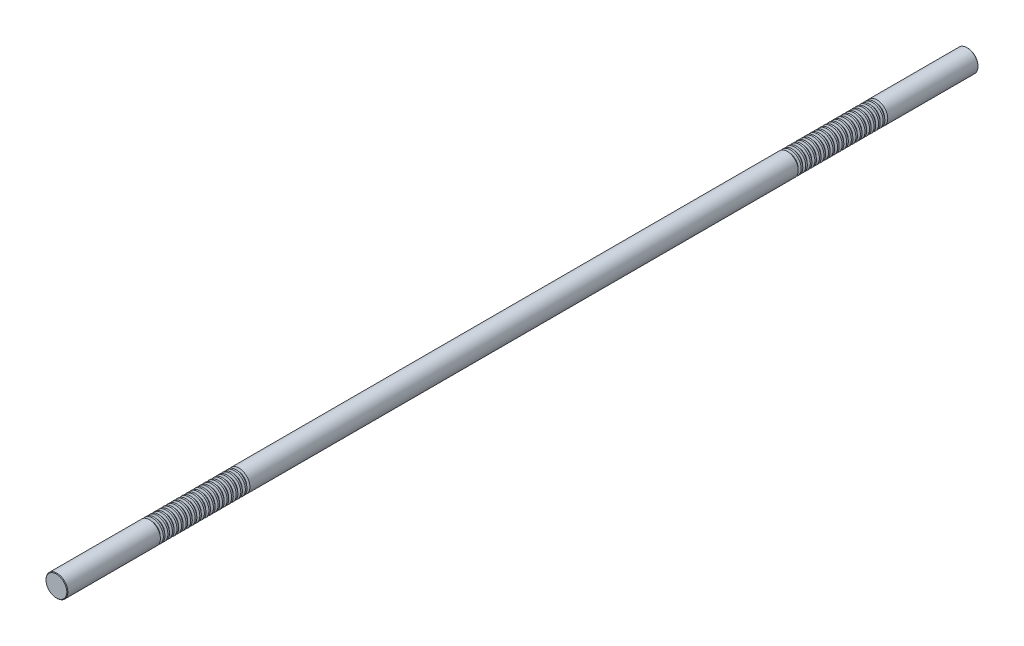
ISO-10303-21;
HEADER;
FILE_DESCRIPTION(('STEP AP214'),'2;1');
FILE_NAME('part.step','',(''),(''),'','','');
FILE_SCHEMA(('AUTOMOTIVE_DESIGN { 1 0 10303 214 1 1 1 1 }'));
ENDSEC;
DATA;
#1=APPLICATION_CONTEXT('core data for automotive mechanical design processes');
#2=APPLICATION_PROTOCOL_DEFINITION('international standard','automotive_design',2000,#1);
#3=PRODUCT_CONTEXT('',#1,'mechanical');
#4=PRODUCT('Part','Part','',(#3));
#5=PRODUCT_RELATED_PRODUCT_CATEGORY('part','',(#4));
#6=PRODUCT_DEFINITION_FORMATION('','',#4);
#7=PRODUCT_DEFINITION_CONTEXT('part definition',#1,'design');
#8=PRODUCT_DEFINITION('design','',#6,#7);
#9=PRODUCT_DEFINITION_SHAPE('','',#8);
#10=(LENGTH_UNIT() NAMED_UNIT(*) SI_UNIT(.MILLI.,.METRE.));
#11=(NAMED_UNIT(*) PLANE_ANGLE_UNIT() SI_UNIT($,.RADIAN.));
#12=(NAMED_UNIT(*) SI_UNIT($,.STERADIAN.) SOLID_ANGLE_UNIT());
#13=UNCERTAINTY_MEASURE_WITH_UNIT(LENGTH_MEASURE(1.E-05),#10,'distance_accuracy_value','');
#14=(GEOMETRIC_REPRESENTATION_CONTEXT(3) GLOBAL_UNCERTAINTY_ASSIGNED_CONTEXT((#13)) GLOBAL_UNIT_ASSIGNED_CONTEXT((#10,
#11,#12)) REPRESENTATION_CONTEXT('',''));
#15=CARTESIAN_POINT('',(0.,0.,0.));
#16=DIRECTION('',(0.,0.,1.));
#17=DIRECTION('',(1.,0.,0.));
#18=AXIS2_PLACEMENT_3D('',#15,#16,#17);
#19=CARTESIAN_POINT('',(0.,0.,500.));
#20=DIRECTION('',(0.,0.,-1.));
#21=DIRECTION('',(-1.,0.,0.));
#22=AXIS2_PLACEMENT_3D('',#19,#20,#21);
#23=CYLINDRICAL_SURFACE('',#22,12.);
#24=CARTESIAN_POINT('',(0.,0.,392.868430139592));
#25=DIRECTION('',(0.,0.,1.));
#26=DIRECTION('',(1.,0.,0.));
#27=AXIS2_PLACEMENT_3D('',#24,#25,#26);
#28=CIRCLE('',#27,12.);
#29=CARTESIAN_POINT('',(12.,0.,392.868430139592));
#30=VERTEX_POINT('',#29);
#31=EDGE_CURVE('E674',#30,#30,#28,.T.);
#32=ORIENTED_EDGE('',*,*,#31,.T.);
#33=EDGE_LOOP('',(#32));
#34=FACE_BOUND('',#33,.T.);
#35=CARTESIAN_POINT('',(0.,0.,394.631569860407));
#36=DIRECTION('',(0.,0.,1.));
#37=DIRECTION('',(1.,0.,0.));
#38=AXIS2_PLACEMENT_3D('',#35,#36,#37);
#39=CIRCLE('',#38,12.);
#40=CARTESIAN_POINT('',(12.,0.,394.631569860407));
#41=VERTEX_POINT('',#40);
#42=EDGE_CURVE('E685',#41,#41,#39,.T.);
#43=ORIENTED_EDGE('',*,*,#42,.F.);
#44=EDGE_LOOP('',(#43));
#45=FACE_BOUND('',#44,.T.);
#46=ADVANCED_FACE('F37',(#34,#45),#23,.T.);
#47=CARTESIAN_POINT('',(0.,0.,387.868430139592));
#48=DIRECTION('',(0.,0.,1.));
#49=DIRECTION('',(1.,0.,0.));
#50=AXIS2_PLACEMENT_3D('',#47,#48,#49);
#51=CIRCLE('',#50,12.);
#52=CARTESIAN_POINT('',(12.,0.,387.868430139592));
#53=VERTEX_POINT('',#52);
#54=EDGE_CURVE('E658',#53,#53,#51,.T.);
#55=ORIENTED_EDGE('',*,*,#54,.T.);
#56=EDGE_LOOP('',(#55));
#57=FACE_BOUND('',#56,.T.);
#58=CARTESIAN_POINT('',(0.,0.,389.631569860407));
#59=DIRECTION('',(0.,0.,1.));
#60=DIRECTION('',(1.,0.,0.));
#61=AXIS2_PLACEMENT_3D('',#58,#59,#60);
#62=CIRCLE('',#61,12.);
#63=CARTESIAN_POINT('',(12.,0.,389.631569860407));
#64=VERTEX_POINT('',#63);
#65=EDGE_CURVE('E670',#64,#64,#62,.T.);
#66=ORIENTED_EDGE('',*,*,#65,.F.);
#67=EDGE_LOOP('',(#66));
#68=FACE_BOUND('',#67,.T.);
#69=ADVANCED_FACE('F721',(#57,#68),#23,.T.);
#70=CARTESIAN_POINT('',(0.,0.,382.868430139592));
#71=DIRECTION('',(0.,0.,1.));
#72=DIRECTION('',(1.,0.,0.));
#73=AXIS2_PLACEMENT_3D('',#70,#71,#72);
#74=CIRCLE('',#73,12.);
#75=CARTESIAN_POINT('',(12.,0.,382.868430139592));
#76=VERTEX_POINT('',#75);
#77=EDGE_CURVE('E642',#76,#76,#74,.T.);
#78=ORIENTED_EDGE('',*,*,#77,.T.);
#79=EDGE_LOOP('',(#78));
#80=FACE_BOUND('',#79,.T.);
#81=CARTESIAN_POINT('',(0.,0.,384.631569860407));
#82=DIRECTION('',(0.,0.,1.));
#83=DIRECTION('',(1.,0.,0.));
#84=AXIS2_PLACEMENT_3D('',#81,#82,#83);
#85=CIRCLE('',#84,12.);
#86=CARTESIAN_POINT('',(12.,0.,384.631569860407));
#87=VERTEX_POINT('',#86);
#88=EDGE_CURVE('E654',#87,#87,#85,.T.);
#89=ORIENTED_EDGE('',*,*,#88,.F.);
#90=EDGE_LOOP('',(#89));
#91=FACE_BOUND('',#90,.T.);
#92=ADVANCED_FACE('F729',(#80,#91),#23,.T.);
#93=CARTESIAN_POINT('',(0.,0.,377.868430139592));
#94=DIRECTION('',(0.,0.,1.));
#95=DIRECTION('',(1.,0.,0.));
#96=AXIS2_PLACEMENT_3D('',#93,#94,#95);
#97=CIRCLE('',#96,12.);
#98=CARTESIAN_POINT('',(12.,0.,377.868430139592));
#99=VERTEX_POINT('',#98);
#100=EDGE_CURVE('E626',#99,#99,#97,.T.);
#101=ORIENTED_EDGE('',*,*,#100,.T.);
#102=EDGE_LOOP('',(#101));
#103=FACE_BOUND('',#102,.T.);
#104=CARTESIAN_POINT('',(0.,0.,379.631569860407));
#105=DIRECTION('',(0.,0.,1.));
#106=DIRECTION('',(1.,0.,0.));
#107=AXIS2_PLACEMENT_3D('',#104,#105,#106);
#108=CIRCLE('',#107,12.);
#109=CARTESIAN_POINT('',(12.,0.,379.631569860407));
#110=VERTEX_POINT('',#109);
#111=EDGE_CURVE('E638',#110,#110,#108,.T.);
#112=ORIENTED_EDGE('',*,*,#111,.F.);
#113=EDGE_LOOP('',(#112));
#114=FACE_BOUND('',#113,.T.);
#115=ADVANCED_FACE('F1550',(#103,#114),#23,.T.);
#116=CARTESIAN_POINT('',(0.,0.,372.868430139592));
#117=DIRECTION('',(0.,0.,1.));
#118=DIRECTION('',(1.,0.,0.));
#119=AXIS2_PLACEMENT_3D('',#116,#117,#118);
#120=CIRCLE('',#119,12.);
#121=CARTESIAN_POINT('',(12.,0.,372.868430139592));
#122=VERTEX_POINT('',#121);
#123=EDGE_CURVE('E611',#122,#122,#120,.T.);
#124=ORIENTED_EDGE('',*,*,#123,.T.);
#125=EDGE_LOOP('',(#124));
#126=FACE_BOUND('',#125,.T.);
#127=CARTESIAN_POINT('',(0.,0.,374.631569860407));
#128=DIRECTION('',(0.,0.,1.));
#129=DIRECTION('',(1.,0.,0.));
#130=AXIS2_PLACEMENT_3D('',#127,#128,#129);
#131=CIRCLE('',#130,12.);
#132=CARTESIAN_POINT('',(12.,0.,374.631569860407));
#133=VERTEX_POINT('',#132);
#134=EDGE_CURVE('E622',#133,#133,#131,.T.);
#135=ORIENTED_EDGE('',*,*,#134,.F.);
#136=EDGE_LOOP('',(#135));
#137=FACE_BOUND('',#136,.T.);
#138=ADVANCED_FACE('F1527',(#126,#137),#23,.T.);
#139=CARTESIAN_POINT('',(0.,0.,367.868430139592));
#140=DIRECTION('',(0.,0.,1.));
#141=DIRECTION('',(1.,0.,0.));
#142=AXIS2_PLACEMENT_3D('',#139,#140,#141);
#143=CIRCLE('',#142,12.);
#144=CARTESIAN_POINT('',(12.,0.,367.868430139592));
#145=VERTEX_POINT('',#144);
#146=EDGE_CURVE('E595',#145,#145,#143,.T.);
#147=ORIENTED_EDGE('',*,*,#146,.T.);
#148=EDGE_LOOP('',(#147));
#149=FACE_BOUND('',#148,.T.);
#150=CARTESIAN_POINT('',(0.,0.,369.631569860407));
#151=DIRECTION('',(0.,0.,1.));
#152=DIRECTION('',(1.,0.,0.));
#153=AXIS2_PLACEMENT_3D('',#150,#151,#152);
#154=CIRCLE('',#153,12.);
#155=CARTESIAN_POINT('',(12.,0.,369.631569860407));
#156=VERTEX_POINT('',#155);
#157=EDGE_CURVE('E607',#156,#156,#154,.T.);
#158=ORIENTED_EDGE('',*,*,#157,.F.);
#159=EDGE_LOOP('',(#158));
#160=FACE_BOUND('',#159,.T.);
#161=ADVANCED_FACE('F1504',(#149,#160),#23,.T.);
#162=CARTESIAN_POINT('',(0.,0.,362.868430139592));
#163=DIRECTION('',(0.,0.,1.));
#164=DIRECTION('',(1.,0.,0.));
#165=AXIS2_PLACEMENT_3D('',#162,#163,#164);
#166=CIRCLE('',#165,12.);
#167=CARTESIAN_POINT('',(12.,0.,362.868430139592));
#168=VERTEX_POINT('',#167);
#169=EDGE_CURVE('E579',#168,#168,#166,.T.);
#170=ORIENTED_EDGE('',*,*,#169,.T.);
#171=EDGE_LOOP('',(#170));
#172=FACE_BOUND('',#171,.T.);
#173=CARTESIAN_POINT('',(0.,0.,364.631569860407));
#174=DIRECTION('',(0.,0.,1.));
#175=DIRECTION('',(1.,0.,0.));
#176=AXIS2_PLACEMENT_3D('',#173,#174,#175);
#177=CIRCLE('',#176,12.);
#178=CARTESIAN_POINT('',(12.,0.,364.631569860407));
#179=VERTEX_POINT('',#178);
#180=EDGE_CURVE('E591',#179,#179,#177,.T.);
#181=ORIENTED_EDGE('',*,*,#180,.F.);
#182=EDGE_LOOP('',(#181));
#183=FACE_BOUND('',#182,.T.);
#184=ADVANCED_FACE('F1481',(#172,#183),#23,.T.);
#185=CARTESIAN_POINT('',(0.,0.,357.868430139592));
#186=DIRECTION('',(0.,0.,1.));
#187=DIRECTION('',(1.,0.,0.));
#188=AXIS2_PLACEMENT_3D('',#185,#186,#187);
#189=CIRCLE('',#188,12.);
#190=CARTESIAN_POINT('',(12.,0.,357.868430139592));
#191=VERTEX_POINT('',#190);
#192=EDGE_CURVE('E563',#191,#191,#189,.T.);
#193=ORIENTED_EDGE('',*,*,#192,.T.);
#194=EDGE_LOOP('',(#193));
#195=FACE_BOUND('',#194,.T.);
#196=CARTESIAN_POINT('',(0.,0.,359.631569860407));
#197=DIRECTION('',(0.,0.,1.));
#198=DIRECTION('',(1.,0.,0.));
#199=AXIS2_PLACEMENT_3D('',#196,#197,#198);
#200=CIRCLE('',#199,12.);
#201=CARTESIAN_POINT('',(12.,0.,359.631569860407));
#202=VERTEX_POINT('',#201);
#203=EDGE_CURVE('E575',#202,#202,#200,.T.);
#204=ORIENTED_EDGE('',*,*,#203,.F.);
#205=EDGE_LOOP('',(#204));
#206=FACE_BOUND('',#205,.T.);
#207=ADVANCED_FACE('F1458',(#195,#206),#23,.T.);
#208=CARTESIAN_POINT('',(0.,0.,352.868430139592));
#209=DIRECTION('',(0.,0.,1.));
#210=DIRECTION('',(1.,0.,0.));
#211=AXIS2_PLACEMENT_3D('',#208,#209,#210);
#212=CIRCLE('',#211,12.);
#213=CARTESIAN_POINT('',(12.,0.,352.868430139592));
#214=VERTEX_POINT('',#213);
#215=EDGE_CURVE('E547',#214,#214,#212,.T.);
#216=ORIENTED_EDGE('',*,*,#215,.T.);
#217=EDGE_LOOP('',(#216));
#218=FACE_BOUND('',#217,.T.);
#219=CARTESIAN_POINT('',(0.,0.,354.631569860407));
#220=DIRECTION('',(0.,0.,1.));
#221=DIRECTION('',(1.,0.,0.));
#222=AXIS2_PLACEMENT_3D('',#219,#220,#221);
#223=CIRCLE('',#222,12.);
#224=CARTESIAN_POINT('',(12.,0.,354.631569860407));
#225=VERTEX_POINT('',#224);
#226=EDGE_CURVE('E559',#225,#225,#223,.T.);
#227=ORIENTED_EDGE('',*,*,#226,.F.);
#228=EDGE_LOOP('',(#227));
#229=FACE_BOUND('',#228,.T.);
#230=ADVANCED_FACE('F1435',(#218,#229),#23,.T.);
#231=CARTESIAN_POINT('',(0.,0.,347.868430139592));
#232=DIRECTION('',(0.,0.,1.));
#233=DIRECTION('',(1.,0.,0.));
#234=AXIS2_PLACEMENT_3D('',#231,#232,#233);
#235=CIRCLE('',#234,12.);
#236=CARTESIAN_POINT('',(12.,0.,347.868430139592));
#237=VERTEX_POINT('',#236);
#238=EDGE_CURVE('E531',#237,#237,#235,.T.);
#239=ORIENTED_EDGE('',*,*,#238,.T.);
#240=EDGE_LOOP('',(#239));
#241=FACE_BOUND('',#240,.T.);
#242=CARTESIAN_POINT('',(0.,0.,349.631569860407));
#243=DIRECTION('',(0.,0.,1.));
#244=DIRECTION('',(1.,0.,0.));
#245=AXIS2_PLACEMENT_3D('',#242,#243,#244);
#246=CIRCLE('',#245,12.);
#247=CARTESIAN_POINT('',(12.,0.,349.631569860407));
#248=VERTEX_POINT('',#247);
#249=EDGE_CURVE('E543',#248,#248,#246,.T.);
#250=ORIENTED_EDGE('',*,*,#249,.F.);
#251=EDGE_LOOP('',(#250));
#252=FACE_BOUND('',#251,.T.);
#253=ADVANCED_FACE('F1412',(#241,#252),#23,.T.);
#254=CARTESIAN_POINT('',(0.,0.,342.868430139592));
#255=DIRECTION('',(0.,0.,1.));
#256=DIRECTION('',(1.,0.,0.));
#257=AXIS2_PLACEMENT_3D('',#254,#255,#256);
#258=CIRCLE('',#257,12.);
#259=CARTESIAN_POINT('',(12.,0.,342.868430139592));
#260=VERTEX_POINT('',#259);
#261=EDGE_CURVE('E515',#260,#260,#258,.T.);
#262=ORIENTED_EDGE('',*,*,#261,.T.);
#263=EDGE_LOOP('',(#262));
#264=FACE_BOUND('',#263,.T.);
#265=CARTESIAN_POINT('',(0.,0.,344.631569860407));
#266=DIRECTION('',(0.,0.,1.));
#267=DIRECTION('',(1.,0.,0.));
#268=AXIS2_PLACEMENT_3D('',#265,#266,#267);
#269=CIRCLE('',#268,12.);
#270=CARTESIAN_POINT('',(12.,0.,344.631569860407));
#271=VERTEX_POINT('',#270);
#272=EDGE_CURVE('E527',#271,#271,#269,.T.);
#273=ORIENTED_EDGE('',*,*,#272,.F.);
#274=EDGE_LOOP('',(#273));
#275=FACE_BOUND('',#274,.T.);
#276=ADVANCED_FACE('F1389',(#264,#275),#23,.T.);
#277=CARTESIAN_POINT('',(0.,0.,337.868430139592));
#278=DIRECTION('',(0.,0.,1.));
#279=DIRECTION('',(1.,0.,0.));
#280=AXIS2_PLACEMENT_3D('',#277,#278,#279);
#281=CIRCLE('',#280,12.);
#282=CARTESIAN_POINT('',(12.,0.,337.868430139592));
#283=VERTEX_POINT('',#282);
#284=EDGE_CURVE('E499',#283,#283,#281,.T.);
#285=ORIENTED_EDGE('',*,*,#284,.T.);
#286=EDGE_LOOP('',(#285));
#287=FACE_BOUND('',#286,.T.);
#288=CARTESIAN_POINT('',(0.,0.,339.631569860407));
#289=DIRECTION('',(0.,0.,1.));
#290=DIRECTION('',(1.,0.,0.));
#291=AXIS2_PLACEMENT_3D('',#288,#289,#290);
#292=CIRCLE('',#291,12.);
#293=CARTESIAN_POINT('',(12.,0.,339.631569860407));
#294=VERTEX_POINT('',#293);
#295=EDGE_CURVE('E511',#294,#294,#292,.T.);
#296=ORIENTED_EDGE('',*,*,#295,.F.);
#297=EDGE_LOOP('',(#296));
#298=FACE_BOUND('',#297,.T.);
#299=ADVANCED_FACE('F1366',(#287,#298),#23,.T.);
#300=CARTESIAN_POINT('',(0.,0.,332.868430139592));
#301=DIRECTION('',(0.,0.,1.));
#302=DIRECTION('',(1.,0.,0.));
#303=AXIS2_PLACEMENT_3D('',#300,#301,#302);
#304=CIRCLE('',#303,12.);
#305=CARTESIAN_POINT('',(12.,0.,332.868430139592));
#306=VERTEX_POINT('',#305);
#307=EDGE_CURVE('E483',#306,#306,#304,.T.);
#308=ORIENTED_EDGE('',*,*,#307,.T.);
#309=EDGE_LOOP('',(#308));
#310=FACE_BOUND('',#309,.T.);
#311=CARTESIAN_POINT('',(0.,0.,334.631569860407));
#312=DIRECTION('',(0.,0.,1.));
#313=DIRECTION('',(1.,0.,0.));
#314=AXIS2_PLACEMENT_3D('',#311,#312,#313);
#315=CIRCLE('',#314,12.);
#316=CARTESIAN_POINT('',(12.,0.,334.631569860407));
#317=VERTEX_POINT('',#316);
#318=EDGE_CURVE('E495',#317,#317,#315,.T.);
#319=ORIENTED_EDGE('',*,*,#318,.F.);
#320=EDGE_LOOP('',(#319));
#321=FACE_BOUND('',#320,.T.);
#322=ADVANCED_FACE('F1343',(#310,#321),#23,.T.);
#323=CARTESIAN_POINT('',(0.,0.,327.868430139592));
#324=DIRECTION('',(0.,0.,1.));
#325=DIRECTION('',(1.,0.,0.));
#326=AXIS2_PLACEMENT_3D('',#323,#324,#325);
#327=CIRCLE('',#326,12.);
#328=CARTESIAN_POINT('',(12.,0.,327.868430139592));
#329=VERTEX_POINT('',#328);
#330=EDGE_CURVE('E467',#329,#329,#327,.T.);
#331=ORIENTED_EDGE('',*,*,#330,.T.);
#332=EDGE_LOOP('',(#331));
#333=FACE_BOUND('',#332,.T.);
#334=CARTESIAN_POINT('',(0.,0.,329.631569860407));
#335=DIRECTION('',(0.,0.,1.));
#336=DIRECTION('',(1.,0.,0.));
#337=AXIS2_PLACEMENT_3D('',#334,#335,#336);
#338=CIRCLE('',#337,12.);
#339=CARTESIAN_POINT('',(12.,0.,329.631569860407));
#340=VERTEX_POINT('',#339);
#341=EDGE_CURVE('E479',#340,#340,#338,.T.);
#342=ORIENTED_EDGE('',*,*,#341,.F.);
#343=EDGE_LOOP('',(#342));
#344=FACE_BOUND('',#343,.T.);
#345=ADVANCED_FACE('F1320',(#333,#344),#23,.T.);
#346=CARTESIAN_POINT('',(0.,0.,322.868430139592));
#347=DIRECTION('',(0.,0.,1.));
#348=DIRECTION('',(1.,0.,0.));
#349=AXIS2_PLACEMENT_3D('',#346,#347,#348);
#350=CIRCLE('',#349,12.);
#351=CARTESIAN_POINT('',(12.,0.,322.868430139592));
#352=VERTEX_POINT('',#351);
#353=EDGE_CURVE('E451',#352,#352,#350,.T.);
#354=ORIENTED_EDGE('',*,*,#353,.T.);
#355=EDGE_LOOP('',(#354));
#356=FACE_BOUND('',#355,.T.);
#357=CARTESIAN_POINT('',(0.,0.,324.631569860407));
#358=DIRECTION('',(0.,0.,1.));
#359=DIRECTION('',(1.,0.,0.));
#360=AXIS2_PLACEMENT_3D('',#357,#358,#359);
#361=CIRCLE('',#360,12.);
#362=CARTESIAN_POINT('',(12.,0.,324.631569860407));
#363=VERTEX_POINT('',#362);
#364=EDGE_CURVE('E463',#363,#363,#361,.T.);
#365=ORIENTED_EDGE('',*,*,#364,.F.);
#366=EDGE_LOOP('',(#365));
#367=FACE_BOUND('',#366,.T.);
#368=ADVANCED_FACE('F1297',(#356,#367),#23,.T.);
#369=CARTESIAN_POINT('',(0.,0.,317.868430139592));
#370=DIRECTION('',(0.,0.,1.));
#371=DIRECTION('',(1.,0.,0.));
#372=AXIS2_PLACEMENT_3D('',#369,#370,#371);
#373=CIRCLE('',#372,12.);
#374=CARTESIAN_POINT('',(12.,0.,317.868430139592));
#375=VERTEX_POINT('',#374);
#376=EDGE_CURVE('E435',#375,#375,#373,.T.);
#377=ORIENTED_EDGE('',*,*,#376,.T.);
#378=EDGE_LOOP('',(#377));
#379=FACE_BOUND('',#378,.T.);
#380=CARTESIAN_POINT('',(0.,0.,319.631569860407));
#381=DIRECTION('',(0.,0.,1.));
#382=DIRECTION('',(1.,0.,0.));
#383=AXIS2_PLACEMENT_3D('',#380,#381,#382);
#384=CIRCLE('',#383,12.);
#385=CARTESIAN_POINT('',(12.,0.,319.631569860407));
#386=VERTEX_POINT('',#385);
#387=EDGE_CURVE('E447',#386,#386,#384,.T.);
#388=ORIENTED_EDGE('',*,*,#387,.F.);
#389=EDGE_LOOP('',(#388));
#390=FACE_BOUND('',#389,.T.);
#391=ADVANCED_FACE('F1274',(#379,#390),#23,.T.);
#392=CARTESIAN_POINT('',(0.,0.,312.868430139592));
#393=DIRECTION('',(0.,0.,1.));
#394=DIRECTION('',(1.,0.,0.));
#395=AXIS2_PLACEMENT_3D('',#392,#393,#394);
#396=CIRCLE('',#395,12.);
#397=CARTESIAN_POINT('',(12.,0.,312.868430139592));
#398=VERTEX_POINT('',#397);
#399=EDGE_CURVE('E419',#398,#398,#396,.T.);
#400=ORIENTED_EDGE('',*,*,#399,.T.);
#401=EDGE_LOOP('',(#400));
#402=FACE_BOUND('',#401,.T.);
#403=CARTESIAN_POINT('',(0.,0.,314.631569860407));
#404=DIRECTION('',(0.,0.,1.));
#405=DIRECTION('',(1.,0.,0.));
#406=AXIS2_PLACEMENT_3D('',#403,#404,#405);
#407=CIRCLE('',#406,12.);
#408=CARTESIAN_POINT('',(12.,0.,314.631569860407));
#409=VERTEX_POINT('',#408);
#410=EDGE_CURVE('E431',#409,#409,#407,.T.);
#411=ORIENTED_EDGE('',*,*,#410,.F.);
#412=EDGE_LOOP('',(#411));
#413=FACE_BOUND('',#412,.T.);
#414=ADVANCED_FACE('F1251',(#402,#413),#23,.T.);
#415=CARTESIAN_POINT('',(0.,0.,307.868430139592));
#416=DIRECTION('',(0.,0.,1.));
#417=DIRECTION('',(1.,0.,0.));
#418=AXIS2_PLACEMENT_3D('',#415,#416,#417);
#419=CIRCLE('',#418,12.);
#420=CARTESIAN_POINT('',(12.,0.,307.868430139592));
#421=VERTEX_POINT('',#420);
#422=EDGE_CURVE('E403',#421,#421,#419,.T.);
#423=ORIENTED_EDGE('',*,*,#422,.T.);
#424=EDGE_LOOP('',(#423));
#425=FACE_BOUND('',#424,.T.);
#426=CARTESIAN_POINT('',(0.,0.,309.631569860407));
#427=DIRECTION('',(0.,0.,1.));
#428=DIRECTION('',(1.,0.,0.));
#429=AXIS2_PLACEMENT_3D('',#426,#427,#428);
#430=CIRCLE('',#429,12.);
#431=CARTESIAN_POINT('',(12.,0.,309.631569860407));
#432=VERTEX_POINT('',#431);
#433=EDGE_CURVE('E415',#432,#432,#430,.T.);
#434=ORIENTED_EDGE('',*,*,#433,.F.);
#435=EDGE_LOOP('',(#434));
#436=FACE_BOUND('',#435,.T.);
#437=ADVANCED_FACE('F1228',(#425,#436),#23,.T.);
#438=CARTESIAN_POINT('',(0.,0.,302.868430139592));
#439=DIRECTION('',(0.,0.,1.));
#440=DIRECTION('',(1.,0.,0.));
#441=AXIS2_PLACEMENT_3D('',#438,#439,#440);
#442=CIRCLE('',#441,12.);
#443=CARTESIAN_POINT('',(12.,0.,302.868430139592));
#444=VERTEX_POINT('',#443);
#445=EDGE_CURVE('E387',#444,#444,#442,.T.);
#446=ORIENTED_EDGE('',*,*,#445,.T.);
#447=EDGE_LOOP('',(#446));
#448=FACE_BOUND('',#447,.T.);
#449=CARTESIAN_POINT('',(0.,0.,304.631569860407));
#450=DIRECTION('',(0.,0.,1.));
#451=DIRECTION('',(1.,0.,0.));
#452=AXIS2_PLACEMENT_3D('',#449,#450,#451);
#453=CIRCLE('',#452,12.);
#454=CARTESIAN_POINT('',(12.,0.,304.631569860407));
#455=VERTEX_POINT('',#454);
#456=EDGE_CURVE('E399',#455,#455,#453,.T.);
#457=ORIENTED_EDGE('',*,*,#456,.F.);
#458=EDGE_LOOP('',(#457));
#459=FACE_BOUND('',#458,.T.);
#460=ADVANCED_FACE('F1205',(#448,#459),#23,.T.);
#461=CARTESIAN_POINT('',(0.,0.,-302.131569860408));
#462=DIRECTION('',(0.,0.,1.));
#463=DIRECTION('',(1.,0.,0.));
#464=AXIS2_PLACEMENT_3D('',#461,#462,#463);
#465=CIRCLE('',#464,12.);
#466=CARTESIAN_POINT('',(12.,0.,-302.131569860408));
#467=VERTEX_POINT('',#466);
#468=EDGE_CURVE('E371',#467,#467,#465,.T.);
#469=ORIENTED_EDGE('',*,*,#468,.T.);
#470=EDGE_LOOP('',(#469));
#471=FACE_BOUND('',#470,.T.);
#472=CARTESIAN_POINT('',(0.,0.,299.631569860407));
#473=DIRECTION('',(0.,0.,1.));
#474=DIRECTION('',(1.,0.,0.));
#475=AXIS2_PLACEMENT_3D('',#472,#473,#474);
#476=CIRCLE('',#475,12.);
#477=CARTESIAN_POINT('',(12.,0.,299.631569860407));
#478=VERTEX_POINT('',#477);
#479=EDGE_CURVE('E383',#478,#478,#476,.T.);
#480=ORIENTED_EDGE('',*,*,#479,.F.);
#481=EDGE_LOOP('',(#480));
#482=FACE_BOUND('',#481,.T.);
#483=ADVANCED_FACE('F1182',(#471,#482),#23,.T.);
#484=CARTESIAN_POINT('',(0.,0.,-307.131569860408));
#485=DIRECTION('',(0.,0.,1.));
#486=DIRECTION('',(1.,0.,0.));
#487=AXIS2_PLACEMENT_3D('',#484,#485,#486);
#488=CIRCLE('',#487,12.);
#489=CARTESIAN_POINT('',(12.,0.,-307.131569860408));
#490=VERTEX_POINT('',#489);
#491=EDGE_CURVE('E355',#490,#490,#488,.T.);
#492=ORIENTED_EDGE('',*,*,#491,.T.);
#493=EDGE_LOOP('',(#492));
#494=FACE_BOUND('',#493,.T.);
#495=CARTESIAN_POINT('',(0.,0.,-305.368430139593));
#496=DIRECTION('',(0.,0.,1.));
#497=DIRECTION('',(1.,0.,0.));
#498=AXIS2_PLACEMENT_3D('',#495,#496,#497);
#499=CIRCLE('',#498,12.);
#500=CARTESIAN_POINT('',(12.,0.,-305.368430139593));
#501=VERTEX_POINT('',#500);
#502=EDGE_CURVE('E367',#501,#501,#499,.T.);
#503=ORIENTED_EDGE('',*,*,#502,.F.);
#504=EDGE_LOOP('',(#503));
#505=FACE_BOUND('',#504,.T.);
#506=ADVANCED_FACE('F1159',(#494,#505),#23,.T.);
#507=CARTESIAN_POINT('',(0.,0.,-312.131569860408));
#508=DIRECTION('',(0.,0.,1.));
#509=DIRECTION('',(1.,0.,0.));
#510=AXIS2_PLACEMENT_3D('',#507,#508,#509);
#511=CIRCLE('',#510,12.);
#512=CARTESIAN_POINT('',(12.,0.,-312.131569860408));
#513=VERTEX_POINT('',#512);
#514=EDGE_CURVE('E339',#513,#513,#511,.T.);
#515=ORIENTED_EDGE('',*,*,#514,.T.);
#516=EDGE_LOOP('',(#515));
#517=FACE_BOUND('',#516,.T.);
#518=CARTESIAN_POINT('',(0.,0.,-310.368430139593));
#519=DIRECTION('',(0.,0.,1.));
#520=DIRECTION('',(1.,0.,0.));
#521=AXIS2_PLACEMENT_3D('',#518,#519,#520);
#522=CIRCLE('',#521,12.);
#523=CARTESIAN_POINT('',(12.,0.,-310.368430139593));
#524=VERTEX_POINT('',#523);
#525=EDGE_CURVE('E351',#524,#524,#522,.T.);
#526=ORIENTED_EDGE('',*,*,#525,.F.);
#527=EDGE_LOOP('',(#526));
#528=FACE_BOUND('',#527,.T.);
#529=ADVANCED_FACE('F1136',(#517,#528),#23,.T.);
#530=CARTESIAN_POINT('',(0.,0.,-317.131569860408));
#531=DIRECTION('',(0.,0.,1.));
#532=DIRECTION('',(1.,0.,0.));
#533=AXIS2_PLACEMENT_3D('',#530,#531,#532);
#534=CIRCLE('',#533,12.);
#535=CARTESIAN_POINT('',(12.,0.,-317.131569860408));
#536=VERTEX_POINT('',#535);
#537=EDGE_CURVE('E323',#536,#536,#534,.T.);
#538=ORIENTED_EDGE('',*,*,#537,.T.);
#539=EDGE_LOOP('',(#538));
#540=FACE_BOUND('',#539,.T.);
#541=CARTESIAN_POINT('',(0.,0.,-315.368430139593));
#542=DIRECTION('',(0.,0.,1.));
#543=DIRECTION('',(1.,0.,0.));
#544=AXIS2_PLACEMENT_3D('',#541,#542,#543);
#545=CIRCLE('',#544,12.);
#546=CARTESIAN_POINT('',(12.,0.,-315.368430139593));
#547=VERTEX_POINT('',#546);
#548=EDGE_CURVE('E335',#547,#547,#545,.T.);
#549=ORIENTED_EDGE('',*,*,#548,.F.);
#550=EDGE_LOOP('',(#549));
#551=FACE_BOUND('',#550,.T.);
#552=ADVANCED_FACE('F1113',(#540,#551),#23,.T.);
#553=CARTESIAN_POINT('',(0.,0.,-322.131569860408));
#554=DIRECTION('',(0.,0.,1.));
#555=DIRECTION('',(1.,0.,0.));
#556=AXIS2_PLACEMENT_3D('',#553,#554,#555);
#557=CIRCLE('',#556,12.);
#558=CARTESIAN_POINT('',(12.,0.,-322.131569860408));
#559=VERTEX_POINT('',#558);
#560=EDGE_CURVE('E307',#559,#559,#557,.T.);
#561=ORIENTED_EDGE('',*,*,#560,.T.);
#562=EDGE_LOOP('',(#561));
#563=FACE_BOUND('',#562,.T.);
#564=CARTESIAN_POINT('',(0.,0.,-320.368430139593));
#565=DIRECTION('',(0.,0.,1.));
#566=DIRECTION('',(1.,0.,0.));
#567=AXIS2_PLACEMENT_3D('',#564,#565,#566);
#568=CIRCLE('',#567,12.);
#569=CARTESIAN_POINT('',(12.,0.,-320.368430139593));
#570=VERTEX_POINT('',#569);
#571=EDGE_CURVE('E319',#570,#570,#568,.T.);
#572=ORIENTED_EDGE('',*,*,#571,.F.);
#573=EDGE_LOOP('',(#572));
#574=FACE_BOUND('',#573,.T.);
#575=ADVANCED_FACE('F1090',(#563,#574),#23,.T.);
#576=CARTESIAN_POINT('',(0.,0.,-327.131569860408));
#577=DIRECTION('',(0.,0.,1.));
#578=DIRECTION('',(1.,0.,0.));
#579=AXIS2_PLACEMENT_3D('',#576,#577,#578);
#580=CIRCLE('',#579,12.);
#581=CARTESIAN_POINT('',(12.,0.,-327.131569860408));
#582=VERTEX_POINT('',#581);
#583=EDGE_CURVE('E291',#582,#582,#580,.T.);
#584=ORIENTED_EDGE('',*,*,#583,.T.);
#585=EDGE_LOOP('',(#584));
#586=FACE_BOUND('',#585,.T.);
#587=CARTESIAN_POINT('',(0.,0.,-325.368430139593));
#588=DIRECTION('',(0.,0.,1.));
#589=DIRECTION('',(1.,0.,0.));
#590=AXIS2_PLACEMENT_3D('',#587,#588,#589);
#591=CIRCLE('',#590,12.);
#592=CARTESIAN_POINT('',(12.,0.,-325.368430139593));
#593=VERTEX_POINT('',#592);
#594=EDGE_CURVE('E303',#593,#593,#591,.T.);
#595=ORIENTED_EDGE('',*,*,#594,.F.);
#596=EDGE_LOOP('',(#595));
#597=FACE_BOUND('',#596,.T.);
#598=ADVANCED_FACE('F1067',(#586,#597),#23,.T.);
#599=CARTESIAN_POINT('',(0.,0.,-332.131569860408));
#600=DIRECTION('',(0.,0.,1.));
#601=DIRECTION('',(1.,0.,0.));
#602=AXIS2_PLACEMENT_3D('',#599,#600,#601);
#603=CIRCLE('',#602,12.);
#604=CARTESIAN_POINT('',(12.,0.,-332.131569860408));
#605=VERTEX_POINT('',#604);
#606=EDGE_CURVE('E275',#605,#605,#603,.T.);
#607=ORIENTED_EDGE('',*,*,#606,.T.);
#608=EDGE_LOOP('',(#607));
#609=FACE_BOUND('',#608,.T.);
#610=CARTESIAN_POINT('',(0.,0.,-330.368430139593));
#611=DIRECTION('',(0.,0.,1.));
#612=DIRECTION('',(1.,0.,0.));
#613=AXIS2_PLACEMENT_3D('',#610,#611,#612);
#614=CIRCLE('',#613,12.);
#615=CARTESIAN_POINT('',(12.,0.,-330.368430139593));
#616=VERTEX_POINT('',#615);
#617=EDGE_CURVE('E287',#616,#616,#614,.T.);
#618=ORIENTED_EDGE('',*,*,#617,.F.);
#619=EDGE_LOOP('',(#618));
#620=FACE_BOUND('',#619,.T.);
#621=ADVANCED_FACE('F1044',(#609,#620),#23,.T.);
#622=CARTESIAN_POINT('',(0.,0.,-337.131569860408));
#623=DIRECTION('',(0.,0.,1.));
#624=DIRECTION('',(1.,0.,0.));
#625=AXIS2_PLACEMENT_3D('',#622,#623,#624);
#626=CIRCLE('',#625,12.);
#627=CARTESIAN_POINT('',(12.,0.,-337.131569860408));
#628=VERTEX_POINT('',#627);
#629=EDGE_CURVE('E259',#628,#628,#626,.T.);
#630=ORIENTED_EDGE('',*,*,#629,.T.);
#631=EDGE_LOOP('',(#630));
#632=FACE_BOUND('',#631,.T.);
#633=CARTESIAN_POINT('',(0.,0.,-335.368430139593));
#634=DIRECTION('',(0.,0.,1.));
#635=DIRECTION('',(1.,0.,0.));
#636=AXIS2_PLACEMENT_3D('',#633,#634,#635);
#637=CIRCLE('',#636,12.);
#638=CARTESIAN_POINT('',(12.,0.,-335.368430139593));
#639=VERTEX_POINT('',#638);
#640=EDGE_CURVE('E271',#639,#639,#637,.T.);
#641=ORIENTED_EDGE('',*,*,#640,.F.);
#642=EDGE_LOOP('',(#641));
#643=FACE_BOUND('',#642,.T.);
#644=ADVANCED_FACE('F1021',(#632,#643),#23,.T.);
#645=CARTESIAN_POINT('',(0.,0.,-342.131569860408));
#646=DIRECTION('',(0.,0.,1.));
#647=DIRECTION('',(1.,0.,0.));
#648=AXIS2_PLACEMENT_3D('',#645,#646,#647);
#649=CIRCLE('',#648,12.);
#650=CARTESIAN_POINT('',(12.,0.,-342.131569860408));
#651=VERTEX_POINT('',#650);
#652=EDGE_CURVE('E243',#651,#651,#649,.T.);
#653=ORIENTED_EDGE('',*,*,#652,.T.);
#654=EDGE_LOOP('',(#653));
#655=FACE_BOUND('',#654,.T.);
#656=CARTESIAN_POINT('',(0.,0.,-340.368430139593));
#657=DIRECTION('',(0.,0.,1.));
#658=DIRECTION('',(1.,0.,0.));
#659=AXIS2_PLACEMENT_3D('',#656,#657,#658);
#660=CIRCLE('',#659,12.);
#661=CARTESIAN_POINT('',(12.,0.,-340.368430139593));
#662=VERTEX_POINT('',#661);
#663=EDGE_CURVE('E255',#662,#662,#660,.T.);
#664=ORIENTED_EDGE('',*,*,#663,.F.);
#665=EDGE_LOOP('',(#664));
#666=FACE_BOUND('',#665,.T.);
#667=ADVANCED_FACE('F998',(#655,#666),#23,.T.);
#668=CARTESIAN_POINT('',(0.,0.,-347.131569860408));
#669=DIRECTION('',(0.,0.,1.));
#670=DIRECTION('',(1.,0.,0.));
#671=AXIS2_PLACEMENT_3D('',#668,#669,#670);
#672=CIRCLE('',#671,12.);
#673=CARTESIAN_POINT('',(12.,0.,-347.131569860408));
#674=VERTEX_POINT('',#673);
#675=EDGE_CURVE('E228',#674,#674,#672,.T.);
#676=ORIENTED_EDGE('',*,*,#675,.T.);
#677=EDGE_LOOP('',(#676));
#678=FACE_BOUND('',#677,.T.);
#679=CARTESIAN_POINT('',(0.,0.,-345.368430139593));
#680=DIRECTION('',(0.,0.,1.));
#681=DIRECTION('',(1.,0.,0.));
#682=AXIS2_PLACEMENT_3D('',#679,#680,#681);
#683=CIRCLE('',#682,12.);
#684=CARTESIAN_POINT('',(12.,0.,-345.368430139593));
#685=VERTEX_POINT('',#684);
#686=EDGE_CURVE('E239',#685,#685,#683,.T.);
#687=ORIENTED_EDGE('',*,*,#686,.F.);
#688=EDGE_LOOP('',(#687));
#689=FACE_BOUND('',#688,.T.);
#690=ADVANCED_FACE('F975',(#678,#689),#23,.T.);
#691=CARTESIAN_POINT('',(0.,0.,-352.131569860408));
#692=DIRECTION('',(0.,0.,1.));
#693=DIRECTION('',(1.,0.,0.));
#694=AXIS2_PLACEMENT_3D('',#691,#692,#693);
#695=CIRCLE('',#694,12.);
#696=CARTESIAN_POINT('',(12.,0.,-352.131569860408));
#697=VERTEX_POINT('',#696);
#698=EDGE_CURVE('E212',#697,#697,#695,.T.);
#699=ORIENTED_EDGE('',*,*,#698,.T.);
#700=EDGE_LOOP('',(#699));
#701=FACE_BOUND('',#700,.T.);
#702=CARTESIAN_POINT('',(0.,0.,-350.368430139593));
#703=DIRECTION('',(0.,0.,1.));
#704=DIRECTION('',(1.,0.,0.));
#705=AXIS2_PLACEMENT_3D('',#702,#703,#704);
#706=CIRCLE('',#705,12.);
#707=CARTESIAN_POINT('',(12.,0.,-350.368430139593));
#708=VERTEX_POINT('',#707);
#709=EDGE_CURVE('E224',#708,#708,#706,.T.);
#710=ORIENTED_EDGE('',*,*,#709,.F.);
#711=EDGE_LOOP('',(#710));
#712=FACE_BOUND('',#711,.T.);
#713=ADVANCED_FACE('F952',(#701,#712),#23,.T.);
#714=CARTESIAN_POINT('',(0.,0.,-357.131569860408));
#715=DIRECTION('',(0.,0.,1.));
#716=DIRECTION('',(1.,0.,0.));
#717=AXIS2_PLACEMENT_3D('',#714,#715,#716);
#718=CIRCLE('',#717,12.);
#719=CARTESIAN_POINT('',(12.,0.,-357.131569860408));
#720=VERTEX_POINT('',#719);
#721=EDGE_CURVE('E196',#720,#720,#718,.T.);
#722=ORIENTED_EDGE('',*,*,#721,.T.);
#723=EDGE_LOOP('',(#722));
#724=FACE_BOUND('',#723,.T.);
#725=CARTESIAN_POINT('',(0.,0.,-355.368430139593));
#726=DIRECTION('',(0.,0.,1.));
#727=DIRECTION('',(1.,0.,0.));
#728=AXIS2_PLACEMENT_3D('',#725,#726,#727);
#729=CIRCLE('',#728,12.);
#730=CARTESIAN_POINT('',(12.,0.,-355.368430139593));
#731=VERTEX_POINT('',#730);
#732=EDGE_CURVE('E208',#731,#731,#729,.T.);
#733=ORIENTED_EDGE('',*,*,#732,.F.);
#734=EDGE_LOOP('',(#733));
#735=FACE_BOUND('',#734,.T.);
#736=ADVANCED_FACE('F929',(#724,#735),#23,.T.);
#737=CARTESIAN_POINT('',(0.,0.,-362.131569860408));
#738=DIRECTION('',(0.,0.,1.));
#739=DIRECTION('',(1.,0.,0.));
#740=AXIS2_PLACEMENT_3D('',#737,#738,#739);
#741=CIRCLE('',#740,12.);
#742=CARTESIAN_POINT('',(12.,0.,-362.131569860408));
#743=VERTEX_POINT('',#742);
#744=EDGE_CURVE('E180',#743,#743,#741,.T.);
#745=ORIENTED_EDGE('',*,*,#744,.T.);
#746=EDGE_LOOP('',(#745));
#747=FACE_BOUND('',#746,.T.);
#748=CARTESIAN_POINT('',(0.,0.,-360.368430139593));
#749=DIRECTION('',(0.,0.,1.));
#750=DIRECTION('',(1.,0.,0.));
#751=AXIS2_PLACEMENT_3D('',#748,#749,#750);
#752=CIRCLE('',#751,12.);
#753=CARTESIAN_POINT('',(12.,0.,-360.368430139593));
#754=VERTEX_POINT('',#753);
#755=EDGE_CURVE('E192',#754,#754,#752,.T.);
#756=ORIENTED_EDGE('',*,*,#755,.F.);
#757=EDGE_LOOP('',(#756));
#758=FACE_BOUND('',#757,.T.);
#759=ADVANCED_FACE('F906',(#747,#758),#23,.T.);
#760=CARTESIAN_POINT('',(0.,0.,-367.131569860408));
#761=DIRECTION('',(0.,0.,1.));
#762=DIRECTION('',(1.,0.,0.));
#763=AXIS2_PLACEMENT_3D('',#760,#761,#762);
#764=CIRCLE('',#763,12.);
#765=CARTESIAN_POINT('',(12.,0.,-367.131569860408));
#766=VERTEX_POINT('',#765);
#767=EDGE_CURVE('E164',#766,#766,#764,.T.);
#768=ORIENTED_EDGE('',*,*,#767,.T.);
#769=EDGE_LOOP('',(#768));
#770=FACE_BOUND('',#769,.T.);
#771=CARTESIAN_POINT('',(0.,0.,-365.368430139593));
#772=DIRECTION('',(0.,0.,1.));
#773=DIRECTION('',(1.,0.,0.));
#774=AXIS2_PLACEMENT_3D('',#771,#772,#773);
#775=CIRCLE('',#774,12.);
#776=CARTESIAN_POINT('',(12.,0.,-365.368430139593));
#777=VERTEX_POINT('',#776);
#778=EDGE_CURVE('E176',#777,#777,#775,.T.);
#779=ORIENTED_EDGE('',*,*,#778,.F.);
#780=EDGE_LOOP('',(#779));
#781=FACE_BOUND('',#780,.T.);
#782=ADVANCED_FACE('F883',(#770,#781),#23,.T.);
#783=CARTESIAN_POINT('',(0.,0.,-372.131569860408));
#784=DIRECTION('',(0.,0.,1.));
#785=DIRECTION('',(1.,0.,0.));
#786=AXIS2_PLACEMENT_3D('',#783,#784,#785);
#787=CIRCLE('',#786,12.);
#788=CARTESIAN_POINT('',(12.,0.,-372.131569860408));
#789=VERTEX_POINT('',#788);
#790=EDGE_CURVE('E148',#789,#789,#787,.T.);
#791=ORIENTED_EDGE('',*,*,#790,.T.);
#792=EDGE_LOOP('',(#791));
#793=FACE_BOUND('',#792,.T.);
#794=CARTESIAN_POINT('',(0.,0.,-370.368430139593));
#795=DIRECTION('',(0.,0.,1.));
#796=DIRECTION('',(1.,0.,0.));
#797=AXIS2_PLACEMENT_3D('',#794,#795,#796);
#798=CIRCLE('',#797,12.);
#799=CARTESIAN_POINT('',(12.,0.,-370.368430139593));
#800=VERTEX_POINT('',#799);
#801=EDGE_CURVE('E160',#800,#800,#798,.T.);
#802=ORIENTED_EDGE('',*,*,#801,.F.);
#803=EDGE_LOOP('',(#802));
#804=FACE_BOUND('',#803,.T.);
#805=ADVANCED_FACE('F860',(#793,#804),#23,.T.);
#806=CARTESIAN_POINT('',(0.,0.,-377.131569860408));
#807=DIRECTION('',(0.,0.,1.));
#808=DIRECTION('',(1.,0.,0.));
#809=AXIS2_PLACEMENT_3D('',#806,#807,#808);
#810=CIRCLE('',#809,12.);
#811=CARTESIAN_POINT('',(12.,0.,-377.131569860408));
#812=VERTEX_POINT('',#811);
#813=EDGE_CURVE('E132',#812,#812,#810,.T.);
#814=ORIENTED_EDGE('',*,*,#813,.T.);
#815=EDGE_LOOP('',(#814));
#816=FACE_BOUND('',#815,.T.);
#817=CARTESIAN_POINT('',(0.,0.,-375.368430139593));
#818=DIRECTION('',(0.,0.,1.));
#819=DIRECTION('',(1.,0.,0.));
#820=AXIS2_PLACEMENT_3D('',#817,#818,#819);
#821=CIRCLE('',#820,12.);
#822=CARTESIAN_POINT('',(12.,0.,-375.368430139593));
#823=VERTEX_POINT('',#822);
#824=EDGE_CURVE('E144',#823,#823,#821,.T.);
#825=ORIENTED_EDGE('',*,*,#824,.F.);
#826=EDGE_LOOP('',(#825));
#827=FACE_BOUND('',#826,.T.);
#828=ADVANCED_FACE('F837',(#816,#827),#23,.T.);
#829=CARTESIAN_POINT('',(0.,0.,-382.131569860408));
#830=DIRECTION('',(0.,0.,1.));
#831=DIRECTION('',(1.,0.,0.));
#832=AXIS2_PLACEMENT_3D('',#829,#830,#831);
#833=CIRCLE('',#832,12.);
#834=CARTESIAN_POINT('',(12.,0.,-382.131569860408));
#835=VERTEX_POINT('',#834);
#836=EDGE_CURVE('E116',#835,#835,#833,.T.);
#837=ORIENTED_EDGE('',*,*,#836,.T.);
#838=EDGE_LOOP('',(#837));
#839=FACE_BOUND('',#838,.T.);
#840=CARTESIAN_POINT('',(0.,0.,-380.368430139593));
#841=DIRECTION('',(0.,0.,1.));
#842=DIRECTION('',(1.,0.,0.));
#843=AXIS2_PLACEMENT_3D('',#840,#841,#842);
#844=CIRCLE('',#843,12.);
#845=CARTESIAN_POINT('',(12.,0.,-380.368430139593));
#846=VERTEX_POINT('',#845);
#847=EDGE_CURVE('E128',#846,#846,#844,.T.);
#848=ORIENTED_EDGE('',*,*,#847,.F.);
#849=EDGE_LOOP('',(#848));
#850=FACE_BOUND('',#849,.T.);
#851=ADVANCED_FACE('F814',(#839,#850),#23,.T.);
#852=CARTESIAN_POINT('',(0.,0.,-387.131569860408));
#853=DIRECTION('',(0.,0.,1.));
#854=DIRECTION('',(1.,0.,0.));
#855=AXIS2_PLACEMENT_3D('',#852,#853,#854);
#856=CIRCLE('',#855,12.);
#857=CARTESIAN_POINT('',(12.,0.,-387.131569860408));
#858=VERTEX_POINT('',#857);
#859=EDGE_CURVE('E100',#858,#858,#856,.T.);
#860=ORIENTED_EDGE('',*,*,#859,.T.);
#861=EDGE_LOOP('',(#860));
#862=FACE_BOUND('',#861,.T.);
#863=CARTESIAN_POINT('',(0.,0.,-385.368430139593));
#864=DIRECTION('',(0.,0.,1.));
#865=DIRECTION('',(1.,0.,0.));
#866=AXIS2_PLACEMENT_3D('',#863,#864,#865);
#867=CIRCLE('',#866,12.);
#868=CARTESIAN_POINT('',(12.,0.,-385.368430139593));
#869=VERTEX_POINT('',#868);
#870=EDGE_CURVE('E112',#869,#869,#867,.T.);
#871=ORIENTED_EDGE('',*,*,#870,.F.);
#872=EDGE_LOOP('',(#871));
#873=FACE_BOUND('',#872,.T.);
#874=ADVANCED_FACE('F791',(#862,#873),#23,.T.);
#875=CARTESIAN_POINT('',(0.,0.,-392.131569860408));
#876=DIRECTION('',(0.,0.,1.));
#877=DIRECTION('',(1.,0.,0.));
#878=AXIS2_PLACEMENT_3D('',#875,#876,#877);
#879=CIRCLE('',#878,12.);
#880=CARTESIAN_POINT('',(12.,0.,-392.131569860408));
#881=VERTEX_POINT('',#880);
#882=EDGE_CURVE('E84',#881,#881,#879,.T.);
#883=ORIENTED_EDGE('',*,*,#882,.T.);
#884=EDGE_LOOP('',(#883));
#885=FACE_BOUND('',#884,.T.);
#886=CARTESIAN_POINT('',(0.,0.,-390.368430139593));
#887=DIRECTION('',(0.,0.,1.));
#888=DIRECTION('',(1.,0.,0.));
#889=AXIS2_PLACEMENT_3D('',#886,#887,#888);
#890=CIRCLE('',#889,12.);
#891=CARTESIAN_POINT('',(12.,0.,-390.368430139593));
#892=VERTEX_POINT('',#891);
#893=EDGE_CURVE('E96',#892,#892,#890,.T.);
#894=ORIENTED_EDGE('',*,*,#893,.F.);
#895=EDGE_LOOP('',(#894));
#896=FACE_BOUND('',#895,.T.);
#897=ADVANCED_FACE('F744',(#885,#896),#23,.T.);
#898=CARTESIAN_POINT('',(0.,0.,-397.131569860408));
#899=DIRECTION('',(0.,0.,1.));
#900=DIRECTION('',(1.,0.,0.));
#901=AXIS2_PLACEMENT_3D('',#898,#899,#900);
#902=CIRCLE('',#901,12.);
#903=CARTESIAN_POINT('',(12.,0.,-397.131569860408));
#904=VERTEX_POINT('',#903);
#905=EDGE_CURVE('E69',#904,#904,#902,.T.);
#906=ORIENTED_EDGE('',*,*,#905,.T.);
#907=EDGE_LOOP('',(#906));
#908=FACE_BOUND('',#907,.T.);
#909=CARTESIAN_POINT('',(0.,0.,-395.368430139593));
#910=DIRECTION('',(0.,0.,1.));
#911=DIRECTION('',(1.,0.,0.));
#912=AXIS2_PLACEMENT_3D('',#909,#910,#911);
#913=CIRCLE('',#912,12.);
#914=CARTESIAN_POINT('',(12.,0.,-395.368430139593));
#915=VERTEX_POINT('',#914);
#916=EDGE_CURVE('E81',#915,#915,#913,.T.);
#917=ORIENTED_EDGE('',*,*,#916,.F.);
#918=EDGE_LOOP('',(#917));
#919=FACE_BOUND('',#918,.T.);
#920=ADVANCED_FACE('F737',(#908,#919),#23,.T.);
#921=CARTESIAN_POINT('',(0.,0.,-499.4));
#922=DIRECTION('',(0.,0.,1.));
#923=DIRECTION('',(1.,0.,0.));
#924=AXIS2_PLACEMENT_3D('',#921,#922,#923);
#925=CIRCLE('',#924,12.);
#926=CARTESIAN_POINT('',(12.,0.,-499.4));
#927=VERTEX_POINT('',#926);
#928=EDGE_CURVE('E52',#927,#927,#925,.T.);
#929=ORIENTED_EDGE('',*,*,#928,.T.);
#930=EDGE_LOOP('',(#929));
#931=FACE_BOUND('',#930,.T.);
#932=CARTESIAN_POINT('',(0.,0.,-400.368430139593));
#933=DIRECTION('',(0.,0.,1.));
#934=DIRECTION('',(1.,0.,0.));
#935=AXIS2_PLACEMENT_3D('',#932,#933,#934);
#936=CIRCLE('',#935,12.);
#937=CARTESIAN_POINT('',(12.,0.,-400.368430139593));
#938=VERTEX_POINT('',#937);
#939=EDGE_CURVE('E65',#938,#938,#936,.T.);
#940=ORIENTED_EDGE('',*,*,#939,.F.);
#941=EDGE_LOOP('',(#940));
#942=FACE_BOUND('',#941,.T.);
#943=ADVANCED_FACE('F725',(#931,#942),#23,.T.);
#944=CARTESIAN_POINT('',(0.,0.,-500.));
#945=DIRECTION('',(0.,0.,1.));
#946=DIRECTION('',(1.,0.,0.));
#947=AXIS2_PLACEMENT_3D('',#944,#945,#946);
#948=PLANE('',#947);
#949=CARTESIAN_POINT('',(0.,0.,-500.));
#950=DIRECTION('',(0.,0.,1.));
#951=DIRECTION('',(1.,0.,0.));
#952=AXIS2_PLACEMENT_3D('',#949,#950,#951);
#953=CIRCLE('',#952,11.3999999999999);
#954=CARTESIAN_POINT('',(11.3999999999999,0.,-500.));
#955=VERTEX_POINT('',#954);
#956=EDGE_CURVE('E45',#955,#955,#953,.F.);
#957=ORIENTED_EDGE('',*,*,#956,.T.);
#958=EDGE_LOOP('',(#957));
#959=FACE_BOUND('',#958,.T.);
#960=ADVANCED_FACE('F736',(#959),#948,.F.);
#961=CARTESIAN_POINT('',(0.,0.,-499.4));
#962=DIRECTION('',(0.,0.,1.));
#963=DIRECTION('',(1.,0.,0.));
#964=AXIS2_PLACEMENT_3D('',#961,#962,#963);
#965=CONICAL_SURFACE('',#964,12.,0.785398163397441);
#966=ORIENTED_EDGE('',*,*,#956,.F.);
#967=EDGE_LOOP('',(#966));
#968=FACE_BOUND('',#967,.T.);
#969=ORIENTED_EDGE('',*,*,#928,.F.);
#970=EDGE_LOOP('',(#969));
#971=FACE_BOUND('',#970,.T.);
#972=ADVANCED_FACE('F743',(#968,#971),#965,.T.);
#973=CARTESIAN_POINT('',(0.,0.,-399.631569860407));
#974=DIRECTION('',(0.,0.,-1.));
#975=DIRECTION('',(-1.,0.,0.));
#976=AXIS2_PLACEMENT_3D('',#973,#974,#975);
#977=CONICAL_SURFACE('',#976,9.25,1.30899693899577);
#978=ORIENTED_EDGE('',*,*,#939,.T.);
#979=EDGE_LOOP('',(#978));
#980=FACE_BOUND('',#979,.T.);
#981=CARTESIAN_POINT('',(0.,0.,-399.631569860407));
#982=DIRECTION('',(0.,0.,1.));
#983=DIRECTION('',(1.,0.,0.));
#984=AXIS2_PLACEMENT_3D('',#981,#982,#983);
#985=CIRCLE('',#984,9.25);
#986=CARTESIAN_POINT('',(9.25,0.,-399.631569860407));
#987=VERTEX_POINT('',#986);
#988=EDGE_CURVE('E77',#987,#987,#985,.T.);
#989=ORIENTED_EDGE('',*,*,#988,.F.);
#990=EDGE_LOOP('',(#989));
#991=FACE_BOUND('',#990,.T.);
#992=ADVANCED_FACE('F750',(#980,#991),#977,.T.);
#993=CARTESIAN_POINT('',(0.,0.,-397.131569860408));
#994=DIRECTION('',(0.,0.,1.));
#995=DIRECTION('',(1.,0.,0.));
#996=AXIS2_PLACEMENT_3D('',#993,#994,#995);
#997=CONICAL_SURFACE('',#996,12.,1.30899693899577);
#998=CARTESIAN_POINT('',(0.,0.,-397.868430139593));
#999=DIRECTION('',(0.,0.,1.));
#1000=DIRECTION('',(1.,0.,0.));
#1001=AXIS2_PLACEMENT_3D('',#998,#999,#1000);
#1002=CIRCLE('',#1001,9.25);
#1003=CARTESIAN_POINT('',(9.25,0.,-397.868430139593));
#1004=VERTEX_POINT('',#1003);
#1005=EDGE_CURVE('E73',#1004,#1004,#1002,.T.);
#1006=ORIENTED_EDGE('',*,*,#1005,.T.);
#1007=EDGE_LOOP('',(#1006));
#1008=FACE_BOUND('',#1007,.T.);
#1009=ORIENTED_EDGE('',*,*,#905,.F.);
#1010=EDGE_LOOP('',(#1009));
#1011=FACE_BOUND('',#1010,.T.);
#1012=ADVANCED_FACE('F753',(#1008,#1011),#997,.T.);
#1013=CARTESIAN_POINT('',(0.,0.,499.4));
#1014=DIRECTION('',(0.,0.,1.));
#1015=DIRECTION('',(1.,0.,0.));
#1016=AXIS2_PLACEMENT_3D('',#1013,#1014,#1015);
#1017=CYLINDRICAL_SURFACE('',#1016,9.25);
#1018=ORIENTED_EDGE('',*,*,#988,.T.);
#1019=EDGE_LOOP('',(#1018));
#1020=FACE_BOUND('',#1019,.T.);
#1021=ORIENTED_EDGE('',*,*,#1005,.F.);
#1022=EDGE_LOOP('',(#1021));
#1023=FACE_BOUND('',#1022,.T.);
#1024=ADVANCED_FACE('F757',(#1020,#1023),#1017,.T.);
#1025=CARTESIAN_POINT('',(0.,0.,-394.631569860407));
#1026=DIRECTION('',(0.,0.,-1.));
#1027=DIRECTION('',(-1.,0.,0.));
#1028=AXIS2_PLACEMENT_3D('',#1025,#1026,#1027);
#1029=CONICAL_SURFACE('',#1028,9.25,1.30899693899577);
#1030=ORIENTED_EDGE('',*,*,#916,.T.);
#1031=EDGE_LOOP('',(#1030));
#1032=FACE_BOUND('',#1031,.T.);
#1033=CARTESIAN_POINT('',(0.,0.,-394.631569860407));
#1034=DIRECTION('',(0.,0.,1.));
#1035=DIRECTION('',(1.,0.,0.));
#1036=AXIS2_PLACEMENT_3D('',#1033,#1034,#1035);
#1037=CIRCLE('',#1036,9.25);
#1038=CARTESIAN_POINT('',(9.25,0.,-394.631569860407));
#1039=VERTEX_POINT('',#1038);
#1040=EDGE_CURVE('E92',#1039,#1039,#1037,.T.);
#1041=ORIENTED_EDGE('',*,*,#1040,.F.);
#1042=EDGE_LOOP('',(#1041));
#1043=FACE_BOUND('',#1042,.T.);
#1044=ADVANCED_FACE('F760',(#1032,#1043),#1029,.T.);
#1045=CARTESIAN_POINT('',(0.,0.,-392.131569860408));
#1046=DIRECTION('',(0.,0.,1.));
#1047=DIRECTION('',(1.,0.,0.));
#1048=AXIS2_PLACEMENT_3D('',#1045,#1046,#1047);
#1049=CONICAL_SURFACE('',#1048,12.,1.30899693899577);
#1050=CARTESIAN_POINT('',(0.,0.,-392.868430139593));
#1051=DIRECTION('',(0.,0.,1.));
#1052=DIRECTION('',(1.,0.,0.));
#1053=AXIS2_PLACEMENT_3D('',#1050,#1051,#1052);
#1054=CIRCLE('',#1053,9.25);
#1055=CARTESIAN_POINT('',(9.25,0.,-392.868430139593));
#1056=VERTEX_POINT('',#1055);
#1057=EDGE_CURVE('E88',#1056,#1056,#1054,.T.);
#1058=ORIENTED_EDGE('',*,*,#1057,.T.);
#1059=EDGE_LOOP('',(#1058));
#1060=FACE_BOUND('',#1059,.T.);
#1061=ORIENTED_EDGE('',*,*,#882,.F.);
#1062=EDGE_LOOP('',(#1061));
#1063=FACE_BOUND('',#1062,.T.);
#1064=ADVANCED_FACE('F773',(#1060,#1063),#1049,.T.);
#1065=CARTESIAN_POINT('',(0.,0.,-395.368430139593));
#1066=DIRECTION('',(0.,0.,1.));
#1067=DIRECTION('',(1.,0.,0.));
#1068=AXIS2_PLACEMENT_3D('',#1065,#1066,#1067);
#1069=CYLINDRICAL_SURFACE('',#1068,9.25);
#1070=ORIENTED_EDGE('',*,*,#1040,.T.);
#1071=EDGE_LOOP('',(#1070));
#1072=FACE_BOUND('',#1071,.T.);
#1073=ORIENTED_EDGE('',*,*,#1057,.F.);
#1074=EDGE_LOOP('',(#1073));
#1075=FACE_BOUND('',#1074,.T.);
#1076=ADVANCED_FACE('F777',(#1072,#1075),#1069,.T.);
#1077=CARTESIAN_POINT('',(0.,0.,-389.631569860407));
#1078=DIRECTION('',(0.,0.,-1.));
#1079=DIRECTION('',(-1.,0.,0.));
#1080=AXIS2_PLACEMENT_3D('',#1077,#1078,#1079);
#1081=CONICAL_SURFACE('',#1080,9.25,1.30899693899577);
#1082=ORIENTED_EDGE('',*,*,#893,.T.);
#1083=EDGE_LOOP('',(#1082));
#1084=FACE_BOUND('',#1083,.T.);
#1085=CARTESIAN_POINT('',(0.,0.,-389.631569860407));
#1086=DIRECTION('',(0.,0.,1.));
#1087=DIRECTION('',(1.,0.,0.));
#1088=AXIS2_PLACEMENT_3D('',#1085,#1086,#1087);
#1089=CIRCLE('',#1088,9.25);
#1090=CARTESIAN_POINT('',(9.25,0.,-389.631569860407));
#1091=VERTEX_POINT('',#1090);
#1092=EDGE_CURVE('E108',#1091,#1091,#1089,.T.);
#1093=ORIENTED_EDGE('',*,*,#1092,.F.);
#1094=EDGE_LOOP('',(#1093));
#1095=FACE_BOUND('',#1094,.T.);
#1096=ADVANCED_FACE('F780',(#1084,#1095),#1081,.T.);
#1097=CARTESIAN_POINT('',(0.,0.,-387.131569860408));
#1098=DIRECTION('',(0.,0.,1.));
#1099=DIRECTION('',(1.,0.,0.));
#1100=AXIS2_PLACEMENT_3D('',#1097,#1098,#1099);
#1101=CONICAL_SURFACE('',#1100,12.,1.30899693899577);
#1102=CARTESIAN_POINT('',(0.,0.,-387.868430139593));
#1103=DIRECTION('',(0.,0.,1.));
#1104=DIRECTION('',(1.,0.,0.));
#1105=AXIS2_PLACEMENT_3D('',#1102,#1103,#1104);
#1106=CIRCLE('',#1105,9.25);
#1107=CARTESIAN_POINT('',(9.25,0.,-387.868430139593));
#1108=VERTEX_POINT('',#1107);
#1109=EDGE_CURVE('E104',#1108,#1108,#1106,.T.);
#1110=ORIENTED_EDGE('',*,*,#1109,.T.);
#1111=EDGE_LOOP('',(#1110));
#1112=FACE_BOUND('',#1111,.T.);
#1113=ORIENTED_EDGE('',*,*,#859,.F.);
#1114=EDGE_LOOP('',(#1113));
#1115=FACE_BOUND('',#1114,.T.);
#1116=ADVANCED_FACE('F796',(#1112,#1115),#1101,.T.);
#1117=CARTESIAN_POINT('',(0.,0.,-390.368430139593));
#1118=DIRECTION('',(0.,0.,1.));
#1119=DIRECTION('',(1.,0.,0.));
#1120=AXIS2_PLACEMENT_3D('',#1117,#1118,#1119);
#1121=CYLINDRICAL_SURFACE('',#1120,9.25);
#1122=ORIENTED_EDGE('',*,*,#1092,.T.);
#1123=EDGE_LOOP('',(#1122));
#1124=FACE_BOUND('',#1123,.T.);
#1125=ORIENTED_EDGE('',*,*,#1109,.F.);
#1126=EDGE_LOOP('',(#1125));
#1127=FACE_BOUND('',#1126,.T.);
#1128=ADVANCED_FACE('F800',(#1124,#1127),#1121,.T.);
#1129=CARTESIAN_POINT('',(0.,0.,-384.631569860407));
#1130=DIRECTION('',(0.,0.,-1.));
#1131=DIRECTION('',(-1.,0.,0.));
#1132=AXIS2_PLACEMENT_3D('',#1129,#1130,#1131);
#1133=CONICAL_SURFACE('',#1132,9.25,1.30899693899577);
#1134=ORIENTED_EDGE('',*,*,#870,.T.);
#1135=EDGE_LOOP('',(#1134));
#1136=FACE_BOUND('',#1135,.T.);
#1137=CARTESIAN_POINT('',(0.,0.,-384.631569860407));
#1138=DIRECTION('',(0.,0.,1.));
#1139=DIRECTION('',(1.,0.,0.));
#1140=AXIS2_PLACEMENT_3D('',#1137,#1138,#1139);
#1141=CIRCLE('',#1140,9.25);
#1142=CARTESIAN_POINT('',(9.25,0.,-384.631569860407));
#1143=VERTEX_POINT('',#1142);
#1144=EDGE_CURVE('E124',#1143,#1143,#1141,.T.);
#1145=ORIENTED_EDGE('',*,*,#1144,.F.);
#1146=EDGE_LOOP('',(#1145));
#1147=FACE_BOUND('',#1146,.T.);
#1148=ADVANCED_FACE('F803',(#1136,#1147),#1133,.T.);
#1149=CARTESIAN_POINT('',(0.,0.,-382.131569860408));
#1150=DIRECTION('',(0.,0.,1.));
#1151=DIRECTION('',(1.,0.,0.));
#1152=AXIS2_PLACEMENT_3D('',#1149,#1150,#1151);
#1153=CONICAL_SURFACE('',#1152,12.,1.30899693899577);
#1154=CARTESIAN_POINT('',(0.,0.,-382.868430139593));
#1155=DIRECTION('',(0.,0.,1.));
#1156=DIRECTION('',(1.,0.,0.));
#1157=AXIS2_PLACEMENT_3D('',#1154,#1155,#1156);
#1158=CIRCLE('',#1157,9.25);
#1159=CARTESIAN_POINT('',(9.25,0.,-382.868430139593));
#1160=VERTEX_POINT('',#1159);
#1161=EDGE_CURVE('E120',#1160,#1160,#1158,.T.);
#1162=ORIENTED_EDGE('',*,*,#1161,.T.);
#1163=EDGE_LOOP('',(#1162));
#1164=FACE_BOUND('',#1163,.T.);
#1165=ORIENTED_EDGE('',*,*,#836,.F.);
#1166=EDGE_LOOP('',(#1165));
#1167=FACE_BOUND('',#1166,.T.);
#1168=ADVANCED_FACE('F819',(#1164,#1167),#1153,.T.);
#1169=CARTESIAN_POINT('',(0.,0.,-385.368430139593));
#1170=DIRECTION('',(0.,0.,1.));
#1171=DIRECTION('',(1.,0.,0.));
#1172=AXIS2_PLACEMENT_3D('',#1169,#1170,#1171);
#1173=CYLINDRICAL_SURFACE('',#1172,9.25);
#1174=ORIENTED_EDGE('',*,*,#1144,.T.);
#1175=EDGE_LOOP('',(#1174));
#1176=FACE_BOUND('',#1175,.T.);
#1177=ORIENTED_EDGE('',*,*,#1161,.F.);
#1178=EDGE_LOOP('',(#1177));
#1179=FACE_BOUND('',#1178,.T.);
#1180=ADVANCED_FACE('F823',(#1176,#1179),#1173,.T.);
#1181=CARTESIAN_POINT('',(0.,0.,-379.631569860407));
#1182=DIRECTION('',(0.,0.,-1.));
#1183=DIRECTION('',(-1.,0.,0.));
#1184=AXIS2_PLACEMENT_3D('',#1181,#1182,#1183);
#1185=CONICAL_SURFACE('',#1184,9.25,1.30899693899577);
#1186=ORIENTED_EDGE('',*,*,#847,.T.);
#1187=EDGE_LOOP('',(#1186));
#1188=FACE_BOUND('',#1187,.T.);
#1189=CARTESIAN_POINT('',(0.,0.,-379.631569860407));
#1190=DIRECTION('',(0.,0.,1.));
#1191=DIRECTION('',(1.,0.,0.));
#1192=AXIS2_PLACEMENT_3D('',#1189,#1190,#1191);
#1193=CIRCLE('',#1192,9.25);
#1194=CARTESIAN_POINT('',(9.25,0.,-379.631569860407));
#1195=VERTEX_POINT('',#1194);
#1196=EDGE_CURVE('E140',#1195,#1195,#1193,.T.);
#1197=ORIENTED_EDGE('',*,*,#1196,.F.);
#1198=EDGE_LOOP('',(#1197));
#1199=FACE_BOUND('',#1198,.T.);
#1200=ADVANCED_FACE('F826',(#1188,#1199),#1185,.T.);
#1201=CARTESIAN_POINT('',(0.,0.,-377.131569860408));
#1202=DIRECTION('',(0.,0.,1.));
#1203=DIRECTION('',(1.,0.,0.));
#1204=AXIS2_PLACEMENT_3D('',#1201,#1202,#1203);
#1205=CONICAL_SURFACE('',#1204,12.,1.30899693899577);
#1206=CARTESIAN_POINT('',(0.,0.,-377.868430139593));
#1207=DIRECTION('',(0.,0.,1.));
#1208=DIRECTION('',(1.,0.,0.));
#1209=AXIS2_PLACEMENT_3D('',#1206,#1207,#1208);
#1210=CIRCLE('',#1209,9.25);
#1211=CARTESIAN_POINT('',(9.25,0.,-377.868430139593));
#1212=VERTEX_POINT('',#1211);
#1213=EDGE_CURVE('E136',#1212,#1212,#1210,.T.);
#1214=ORIENTED_EDGE('',*,*,#1213,.T.);
#1215=EDGE_LOOP('',(#1214));
#1216=FACE_BOUND('',#1215,.T.);
#1217=ORIENTED_EDGE('',*,*,#813,.F.);
#1218=EDGE_LOOP('',(#1217));
#1219=FACE_BOUND('',#1218,.T.);
#1220=ADVANCED_FACE('F842',(#1216,#1219),#1205,.T.);
#1221=CARTESIAN_POINT('',(0.,0.,-380.368430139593));
#1222=DIRECTION('',(0.,0.,1.));
#1223=DIRECTION('',(1.,0.,0.));
#1224=AXIS2_PLACEMENT_3D('',#1221,#1222,#1223);
#1225=CYLINDRICAL_SURFACE('',#1224,9.25);
#1226=ORIENTED_EDGE('',*,*,#1196,.T.);
#1227=EDGE_LOOP('',(#1226));
#1228=FACE_BOUND('',#1227,.T.);
#1229=ORIENTED_EDGE('',*,*,#1213,.F.);
#1230=EDGE_LOOP('',(#1229));
#1231=FACE_BOUND('',#1230,.T.);
#1232=ADVANCED_FACE('F846',(#1228,#1231),#1225,.T.);
#1233=CARTESIAN_POINT('',(0.,0.,-374.631569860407));
#1234=DIRECTION('',(0.,0.,-1.));
#1235=DIRECTION('',(-1.,0.,0.));
#1236=AXIS2_PLACEMENT_3D('',#1233,#1234,#1235);
#1237=CONICAL_SURFACE('',#1236,9.25,1.30899693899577);
#1238=ORIENTED_EDGE('',*,*,#824,.T.);
#1239=EDGE_LOOP('',(#1238));
#1240=FACE_BOUND('',#1239,.T.);
#1241=CARTESIAN_POINT('',(0.,0.,-374.631569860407));
#1242=DIRECTION('',(0.,0.,1.));
#1243=DIRECTION('',(1.,0.,0.));
#1244=AXIS2_PLACEMENT_3D('',#1241,#1242,#1243);
#1245=CIRCLE('',#1244,9.25);
#1246=CARTESIAN_POINT('',(9.25,0.,-374.631569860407));
#1247=VERTEX_POINT('',#1246);
#1248=EDGE_CURVE('E156',#1247,#1247,#1245,.T.);
#1249=ORIENTED_EDGE('',*,*,#1248,.F.);
#1250=EDGE_LOOP('',(#1249));
#1251=FACE_BOUND('',#1250,.T.);
#1252=ADVANCED_FACE('F849',(#1240,#1251),#1237,.T.);
#1253=CARTESIAN_POINT('',(0.,0.,-372.131569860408));
#1254=DIRECTION('',(0.,0.,1.));
#1255=DIRECTION('',(1.,0.,0.));
#1256=AXIS2_PLACEMENT_3D('',#1253,#1254,#1255);
#1257=CONICAL_SURFACE('',#1256,12.,1.30899693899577);
#1258=CARTESIAN_POINT('',(0.,0.,-372.868430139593));
#1259=DIRECTION('',(0.,0.,1.));
#1260=DIRECTION('',(1.,0.,0.));
#1261=AXIS2_PLACEMENT_3D('',#1258,#1259,#1260);
#1262=CIRCLE('',#1261,9.25);
#1263=CARTESIAN_POINT('',(9.25,0.,-372.868430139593));
#1264=VERTEX_POINT('',#1263);
#1265=EDGE_CURVE('E152',#1264,#1264,#1262,.T.);
#1266=ORIENTED_EDGE('',*,*,#1265,.T.);
#1267=EDGE_LOOP('',(#1266));
#1268=FACE_BOUND('',#1267,.T.);
#1269=ORIENTED_EDGE('',*,*,#790,.F.);
#1270=EDGE_LOOP('',(#1269));
#1271=FACE_BOUND('',#1270,.T.);
#1272=ADVANCED_FACE('F865',(#1268,#1271),#1257,.T.);
#1273=CARTESIAN_POINT('',(0.,0.,-375.368430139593));
#1274=DIRECTION('',(0.,0.,1.));
#1275=DIRECTION('',(1.,0.,0.));
#1276=AXIS2_PLACEMENT_3D('',#1273,#1274,#1275);
#1277=CYLINDRICAL_SURFACE('',#1276,9.25);
#1278=ORIENTED_EDGE('',*,*,#1248,.T.);
#1279=EDGE_LOOP('',(#1278));
#1280=FACE_BOUND('',#1279,.T.);
#1281=ORIENTED_EDGE('',*,*,#1265,.F.);
#1282=EDGE_LOOP('',(#1281));
#1283=FACE_BOUND('',#1282,.T.);
#1284=ADVANCED_FACE('F869',(#1280,#1283),#1277,.T.);
#1285=CARTESIAN_POINT('',(0.,0.,-369.631569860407));
#1286=DIRECTION('',(0.,0.,-1.));
#1287=DIRECTION('',(-1.,0.,0.));
#1288=AXIS2_PLACEMENT_3D('',#1285,#1286,#1287);
#1289=CONICAL_SURFACE('',#1288,9.25,1.30899693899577);
#1290=ORIENTED_EDGE('',*,*,#801,.T.);
#1291=EDGE_LOOP('',(#1290));
#1292=FACE_BOUND('',#1291,.T.);
#1293=CARTESIAN_POINT('',(0.,0.,-369.631569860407));
#1294=DIRECTION('',(0.,0.,1.));
#1295=DIRECTION('',(1.,0.,0.));
#1296=AXIS2_PLACEMENT_3D('',#1293,#1294,#1295);
#1297=CIRCLE('',#1296,9.25);
#1298=CARTESIAN_POINT('',(9.25,0.,-369.631569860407));
#1299=VERTEX_POINT('',#1298);
#1300=EDGE_CURVE('E172',#1299,#1299,#1297,.T.);
#1301=ORIENTED_EDGE('',*,*,#1300,.F.);
#1302=EDGE_LOOP('',(#1301));
#1303=FACE_BOUND('',#1302,.T.);
#1304=ADVANCED_FACE('F872',(#1292,#1303),#1289,.T.);
#1305=CARTESIAN_POINT('',(0.,0.,-367.131569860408));
#1306=DIRECTION('',(0.,0.,1.));
#1307=DIRECTION('',(1.,0.,0.));
#1308=AXIS2_PLACEMENT_3D('',#1305,#1306,#1307);
#1309=CONICAL_SURFACE('',#1308,12.,1.30899693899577);
#1310=CARTESIAN_POINT('',(0.,0.,-367.868430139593));
#1311=DIRECTION('',(0.,0.,1.));
#1312=DIRECTION('',(1.,0.,0.));
#1313=AXIS2_PLACEMENT_3D('',#1310,#1311,#1312);
#1314=CIRCLE('',#1313,9.25);
#1315=CARTESIAN_POINT('',(9.25,0.,-367.868430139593));
#1316=VERTEX_POINT('',#1315);
#1317=EDGE_CURVE('E168',#1316,#1316,#1314,.T.);
#1318=ORIENTED_EDGE('',*,*,#1317,.T.);
#1319=EDGE_LOOP('',(#1318));
#1320=FACE_BOUND('',#1319,.T.);
#1321=ORIENTED_EDGE('',*,*,#767,.F.);
#1322=EDGE_LOOP('',(#1321));
#1323=FACE_BOUND('',#1322,.T.);
#1324=ADVANCED_FACE('F888',(#1320,#1323),#1309,.T.);
#1325=CARTESIAN_POINT('',(0.,0.,-370.368430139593));
#1326=DIRECTION('',(0.,0.,1.));
#1327=DIRECTION('',(1.,0.,0.));
#1328=AXIS2_PLACEMENT_3D('',#1325,#1326,#1327);
#1329=CYLINDRICAL_SURFACE('',#1328,9.25);
#1330=ORIENTED_EDGE('',*,*,#1300,.T.);
#1331=EDGE_LOOP('',(#1330));
#1332=FACE_BOUND('',#1331,.T.);
#1333=ORIENTED_EDGE('',*,*,#1317,.F.);
#1334=EDGE_LOOP('',(#1333));
#1335=FACE_BOUND('',#1334,.T.);
#1336=ADVANCED_FACE('F892',(#1332,#1335),#1329,.T.);
#1337=CARTESIAN_POINT('',(0.,0.,-364.631569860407));
#1338=DIRECTION('',(0.,0.,-1.));
#1339=DIRECTION('',(-1.,0.,0.));
#1340=AXIS2_PLACEMENT_3D('',#1337,#1338,#1339);
#1341=CONICAL_SURFACE('',#1340,9.25,1.30899693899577);
#1342=ORIENTED_EDGE('',*,*,#778,.T.);
#1343=EDGE_LOOP('',(#1342));
#1344=FACE_BOUND('',#1343,.T.);
#1345=CARTESIAN_POINT('',(0.,0.,-364.631569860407));
#1346=DIRECTION('',(0.,0.,1.));
#1347=DIRECTION('',(1.,0.,0.));
#1348=AXIS2_PLACEMENT_3D('',#1345,#1346,#1347);
#1349=CIRCLE('',#1348,9.25);
#1350=CARTESIAN_POINT('',(9.25,0.,-364.631569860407));
#1351=VERTEX_POINT('',#1350);
#1352=EDGE_CURVE('E188',#1351,#1351,#1349,.T.);
#1353=ORIENTED_EDGE('',*,*,#1352,.F.);
#1354=EDGE_LOOP('',(#1353));
#1355=FACE_BOUND('',#1354,.T.);
#1356=ADVANCED_FACE('F895',(#1344,#1355),#1341,.T.);
#1357=CARTESIAN_POINT('',(0.,0.,-362.131569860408));
#1358=DIRECTION('',(0.,0.,1.));
#1359=DIRECTION('',(1.,0.,0.));
#1360=AXIS2_PLACEMENT_3D('',#1357,#1358,#1359);
#1361=CONICAL_SURFACE('',#1360,12.,1.30899693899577);
#1362=CARTESIAN_POINT('',(0.,0.,-362.868430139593));
#1363=DIRECTION('',(0.,0.,1.));
#1364=DIRECTION('',(1.,0.,0.));
#1365=AXIS2_PLACEMENT_3D('',#1362,#1363,#1364);
#1366=CIRCLE('',#1365,9.25);
#1367=CARTESIAN_POINT('',(9.25,0.,-362.868430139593));
#1368=VERTEX_POINT('',#1367);
#1369=EDGE_CURVE('E184',#1368,#1368,#1366,.T.);
#1370=ORIENTED_EDGE('',*,*,#1369,.T.);
#1371=EDGE_LOOP('',(#1370));
#1372=FACE_BOUND('',#1371,.T.);
#1373=ORIENTED_EDGE('',*,*,#744,.F.);
#1374=EDGE_LOOP('',(#1373));
#1375=FACE_BOUND('',#1374,.T.);
#1376=ADVANCED_FACE('F911',(#1372,#1375),#1361,.T.);
#1377=CARTESIAN_POINT('',(0.,0.,-365.368430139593));
#1378=DIRECTION('',(0.,0.,1.));
#1379=DIRECTION('',(1.,0.,0.));
#1380=AXIS2_PLACEMENT_3D('',#1377,#1378,#1379);
#1381=CYLINDRICAL_SURFACE('',#1380,9.25);
#1382=ORIENTED_EDGE('',*,*,#1352,.T.);
#1383=EDGE_LOOP('',(#1382));
#1384=FACE_BOUND('',#1383,.T.);
#1385=ORIENTED_EDGE('',*,*,#1369,.F.);
#1386=EDGE_LOOP('',(#1385));
#1387=FACE_BOUND('',#1386,.T.);
#1388=ADVANCED_FACE('F915',(#1384,#1387),#1381,.T.);
#1389=CARTESIAN_POINT('',(0.,0.,-359.631569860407));
#1390=DIRECTION('',(0.,0.,-1.));
#1391=DIRECTION('',(-1.,0.,0.));
#1392=AXIS2_PLACEMENT_3D('',#1389,#1390,#1391);
#1393=CONICAL_SURFACE('',#1392,9.25,1.30899693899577);
#1394=ORIENTED_EDGE('',*,*,#755,.T.);
#1395=EDGE_LOOP('',(#1394));
#1396=FACE_BOUND('',#1395,.T.);
#1397=CARTESIAN_POINT('',(0.,0.,-359.631569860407));
#1398=DIRECTION('',(0.,0.,1.));
#1399=DIRECTION('',(1.,0.,0.));
#1400=AXIS2_PLACEMENT_3D('',#1397,#1398,#1399);
#1401=CIRCLE('',#1400,9.25);
#1402=CARTESIAN_POINT('',(9.25,0.,-359.631569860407));
#1403=VERTEX_POINT('',#1402);
#1404=EDGE_CURVE('E204',#1403,#1403,#1401,.T.);
#1405=ORIENTED_EDGE('',*,*,#1404,.F.);
#1406=EDGE_LOOP('',(#1405));
#1407=FACE_BOUND('',#1406,.T.);
#1408=ADVANCED_FACE('F918',(#1396,#1407),#1393,.T.);
#1409=CARTESIAN_POINT('',(0.,0.,-357.131569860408));
#1410=DIRECTION('',(0.,0.,1.));
#1411=DIRECTION('',(1.,0.,0.));
#1412=AXIS2_PLACEMENT_3D('',#1409,#1410,#1411);
#1413=CONICAL_SURFACE('',#1412,12.,1.30899693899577);
#1414=CARTESIAN_POINT('',(0.,0.,-357.868430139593));
#1415=DIRECTION('',(0.,0.,1.));
#1416=DIRECTION('',(1.,0.,0.));
#1417=AXIS2_PLACEMENT_3D('',#1414,#1415,#1416);
#1418=CIRCLE('',#1417,9.25);
#1419=CARTESIAN_POINT('',(9.25,0.,-357.868430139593));
#1420=VERTEX_POINT('',#1419);
#1421=EDGE_CURVE('E200',#1420,#1420,#1418,.T.);
#1422=ORIENTED_EDGE('',*,*,#1421,.T.);
#1423=EDGE_LOOP('',(#1422));
#1424=FACE_BOUND('',#1423,.T.);
#1425=ORIENTED_EDGE('',*,*,#721,.F.);
#1426=EDGE_LOOP('',(#1425));
#1427=FACE_BOUND('',#1426,.T.);
#1428=ADVANCED_FACE('F934',(#1424,#1427),#1413,.T.);
#1429=CARTESIAN_POINT('',(0.,0.,-360.368430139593));
#1430=DIRECTION('',(0.,0.,1.));
#1431=DIRECTION('',(1.,0.,0.));
#1432=AXIS2_PLACEMENT_3D('',#1429,#1430,#1431);
#1433=CYLINDRICAL_SURFACE('',#1432,9.25);
#1434=ORIENTED_EDGE('',*,*,#1404,.T.);
#1435=EDGE_LOOP('',(#1434));
#1436=FACE_BOUND('',#1435,.T.);
#1437=ORIENTED_EDGE('',*,*,#1421,.F.);
#1438=EDGE_LOOP('',(#1437));
#1439=FACE_BOUND('',#1438,.T.);
#1440=ADVANCED_FACE('F938',(#1436,#1439),#1433,.T.);
#1441=CARTESIAN_POINT('',(0.,0.,-354.631569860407));
#1442=DIRECTION('',(0.,0.,-1.));
#1443=DIRECTION('',(-1.,0.,0.));
#1444=AXIS2_PLACEMENT_3D('',#1441,#1442,#1443);
#1445=CONICAL_SURFACE('',#1444,9.25,1.30899693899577);
#1446=ORIENTED_EDGE('',*,*,#732,.T.);
#1447=EDGE_LOOP('',(#1446));
#1448=FACE_BOUND('',#1447,.T.);
#1449=CARTESIAN_POINT('',(0.,0.,-354.631569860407));
#1450=DIRECTION('',(0.,0.,1.));
#1451=DIRECTION('',(1.,0.,0.));
#1452=AXIS2_PLACEMENT_3D('',#1449,#1450,#1451);
#1453=CIRCLE('',#1452,9.25);
#1454=CARTESIAN_POINT('',(9.25,0.,-354.631569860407));
#1455=VERTEX_POINT('',#1454);
#1456=EDGE_CURVE('E220',#1455,#1455,#1453,.T.);
#1457=ORIENTED_EDGE('',*,*,#1456,.F.);
#1458=EDGE_LOOP('',(#1457));
#1459=FACE_BOUND('',#1458,.T.);
#1460=ADVANCED_FACE('F941',(#1448,#1459),#1445,.T.);
#1461=CARTESIAN_POINT('',(0.,0.,-352.131569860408));
#1462=DIRECTION('',(0.,0.,1.));
#1463=DIRECTION('',(1.,0.,0.));
#1464=AXIS2_PLACEMENT_3D('',#1461,#1462,#1463);
#1465=CONICAL_SURFACE('',#1464,12.,1.30899693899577);
#1466=CARTESIAN_POINT('',(0.,0.,-352.868430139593));
#1467=DIRECTION('',(0.,0.,1.));
#1468=DIRECTION('',(1.,0.,0.));
#1469=AXIS2_PLACEMENT_3D('',#1466,#1467,#1468);
#1470=CIRCLE('',#1469,9.25);
#1471=CARTESIAN_POINT('',(9.25,0.,-352.868430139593));
#1472=VERTEX_POINT('',#1471);
#1473=EDGE_CURVE('E216',#1472,#1472,#1470,.T.);
#1474=ORIENTED_EDGE('',*,*,#1473,.T.);
#1475=EDGE_LOOP('',(#1474));
#1476=FACE_BOUND('',#1475,.T.);
#1477=ORIENTED_EDGE('',*,*,#698,.F.);
#1478=EDGE_LOOP('',(#1477));
#1479=FACE_BOUND('',#1478,.T.);
#1480=ADVANCED_FACE('F957',(#1476,#1479),#1465,.T.);
#1481=CARTESIAN_POINT('',(0.,0.,-355.368430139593));
#1482=DIRECTION('',(0.,0.,1.));
#1483=DIRECTION('',(1.,0.,0.));
#1484=AXIS2_PLACEMENT_3D('',#1481,#1482,#1483);
#1485=CYLINDRICAL_SURFACE('',#1484,9.25);
#1486=ORIENTED_EDGE('',*,*,#1456,.T.);
#1487=EDGE_LOOP('',(#1486));
#1488=FACE_BOUND('',#1487,.T.);
#1489=ORIENTED_EDGE('',*,*,#1473,.F.);
#1490=EDGE_LOOP('',(#1489));
#1491=FACE_BOUND('',#1490,.T.);
#1492=ADVANCED_FACE('F961',(#1488,#1491),#1485,.T.);
#1493=CARTESIAN_POINT('',(0.,0.,-349.631569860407));
#1494=DIRECTION('',(0.,0.,-1.));
#1495=DIRECTION('',(-1.,0.,0.));
#1496=AXIS2_PLACEMENT_3D('',#1493,#1494,#1495);
#1497=CONICAL_SURFACE('',#1496,9.25,1.30899693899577);
#1498=ORIENTED_EDGE('',*,*,#709,.T.);
#1499=EDGE_LOOP('',(#1498));
#1500=FACE_BOUND('',#1499,.T.);
#1501=CARTESIAN_POINT('',(0.,0.,-349.631569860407));
#1502=DIRECTION('',(0.,0.,1.));
#1503=DIRECTION('',(1.,0.,0.));
#1504=AXIS2_PLACEMENT_3D('',#1501,#1502,#1503);
#1505=CIRCLE('',#1504,9.25);
#1506=CARTESIAN_POINT('',(9.25,0.,-349.631569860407));
#1507=VERTEX_POINT('',#1506);
#1508=EDGE_CURVE('E236',#1507,#1507,#1505,.T.);
#1509=ORIENTED_EDGE('',*,*,#1508,.F.);
#1510=EDGE_LOOP('',(#1509));
#1511=FACE_BOUND('',#1510,.T.);
#1512=ADVANCED_FACE('F964',(#1500,#1511),#1497,.T.);
#1513=CARTESIAN_POINT('',(0.,0.,-347.131569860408));
#1514=DIRECTION('',(0.,0.,1.));
#1515=DIRECTION('',(1.,0.,0.));
#1516=AXIS2_PLACEMENT_3D('',#1513,#1514,#1515);
#1517=CONICAL_SURFACE('',#1516,12.,1.30899693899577);
#1518=CARTESIAN_POINT('',(0.,0.,-347.868430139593));
#1519=DIRECTION('',(0.,0.,1.));
#1520=DIRECTION('',(1.,0.,0.));
#1521=AXIS2_PLACEMENT_3D('',#1518,#1519,#1520);
#1522=CIRCLE('',#1521,9.25);
#1523=CARTESIAN_POINT('',(9.25,0.,-347.868430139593));
#1524=VERTEX_POINT('',#1523);
#1525=EDGE_CURVE('E232',#1524,#1524,#1522,.T.);
#1526=ORIENTED_EDGE('',*,*,#1525,.T.);
#1527=EDGE_LOOP('',(#1526));
#1528=FACE_BOUND('',#1527,.T.);
#1529=ORIENTED_EDGE('',*,*,#675,.F.);
#1530=EDGE_LOOP('',(#1529));
#1531=FACE_BOUND('',#1530,.T.);
#1532=ADVANCED_FACE('F980',(#1528,#1531),#1517,.T.);
#1533=CARTESIAN_POINT('',(0.,0.,-350.368430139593));
#1534=DIRECTION('',(0.,0.,1.));
#1535=DIRECTION('',(1.,0.,0.));
#1536=AXIS2_PLACEMENT_3D('',#1533,#1534,#1535);
#1537=CYLINDRICAL_SURFACE('',#1536,9.25);
#1538=ORIENTED_EDGE('',*,*,#1508,.T.);
#1539=EDGE_LOOP('',(#1538));
#1540=FACE_BOUND('',#1539,.T.);
#1541=ORIENTED_EDGE('',*,*,#1525,.F.);
#1542=EDGE_LOOP('',(#1541));
#1543=FACE_BOUND('',#1542,.T.);
#1544=ADVANCED_FACE('F984',(#1540,#1543),#1537,.T.);
#1545=CARTESIAN_POINT('',(0.,0.,-344.631569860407));
#1546=DIRECTION('',(0.,0.,-1.));
#1547=DIRECTION('',(-1.,0.,0.));
#1548=AXIS2_PLACEMENT_3D('',#1545,#1546,#1547);
#1549=CONICAL_SURFACE('',#1548,9.25,1.30899693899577);
#1550=ORIENTED_EDGE('',*,*,#686,.T.);
#1551=EDGE_LOOP('',(#1550));
#1552=FACE_BOUND('',#1551,.T.);
#1553=CARTESIAN_POINT('',(0.,0.,-344.631569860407));
#1554=DIRECTION('',(0.,0.,1.));
#1555=DIRECTION('',(1.,0.,0.));
#1556=AXIS2_PLACEMENT_3D('',#1553,#1554,#1555);
#1557=CIRCLE('',#1556,9.25);
#1558=CARTESIAN_POINT('',(9.25,0.,-344.631569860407));
#1559=VERTEX_POINT('',#1558);
#1560=EDGE_CURVE('E251',#1559,#1559,#1557,.T.);
#1561=ORIENTED_EDGE('',*,*,#1560,.F.);
#1562=EDGE_LOOP('',(#1561));
#1563=FACE_BOUND('',#1562,.T.);
#1564=ADVANCED_FACE('F987',(#1552,#1563),#1549,.T.);
#1565=CARTESIAN_POINT('',(0.,0.,-342.131569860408));
#1566=DIRECTION('',(0.,0.,1.));
#1567=DIRECTION('',(1.,0.,0.));
#1568=AXIS2_PLACEMENT_3D('',#1565,#1566,#1567);
#1569=CONICAL_SURFACE('',#1568,12.,1.30899693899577);
#1570=CARTESIAN_POINT('',(0.,0.,-342.868430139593));
#1571=DIRECTION('',(0.,0.,1.));
#1572=DIRECTION('',(1.,0.,0.));
#1573=AXIS2_PLACEMENT_3D('',#1570,#1571,#1572);
#1574=CIRCLE('',#1573,9.25);
#1575=CARTESIAN_POINT('',(9.25,0.,-342.868430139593));
#1576=VERTEX_POINT('',#1575);
#1577=EDGE_CURVE('E247',#1576,#1576,#1574,.T.);
#1578=ORIENTED_EDGE('',*,*,#1577,.T.);
#1579=EDGE_LOOP('',(#1578));
#1580=FACE_BOUND('',#1579,.T.);
#1581=ORIENTED_EDGE('',*,*,#652,.F.);
#1582=EDGE_LOOP('',(#1581));
#1583=FACE_BOUND('',#1582,.T.);
#1584=ADVANCED_FACE('F1003',(#1580,#1583),#1569,.T.);
#1585=CARTESIAN_POINT('',(0.,0.,-345.368430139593));
#1586=DIRECTION('',(0.,0.,1.));
#1587=DIRECTION('',(1.,0.,0.));
#1588=AXIS2_PLACEMENT_3D('',#1585,#1586,#1587);
#1589=CYLINDRICAL_SURFACE('',#1588,9.25);
#1590=ORIENTED_EDGE('',*,*,#1560,.T.);
#1591=EDGE_LOOP('',(#1590));
#1592=FACE_BOUND('',#1591,.T.);
#1593=ORIENTED_EDGE('',*,*,#1577,.F.);
#1594=EDGE_LOOP('',(#1593));
#1595=FACE_BOUND('',#1594,.T.);
#1596=ADVANCED_FACE('F1007',(#1592,#1595),#1589,.T.);
#1597=CARTESIAN_POINT('',(0.,0.,-339.631569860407));
#1598=DIRECTION('',(0.,0.,-1.));
#1599=DIRECTION('',(-1.,0.,0.));
#1600=AXIS2_PLACEMENT_3D('',#1597,#1598,#1599);
#1601=CONICAL_SURFACE('',#1600,9.25,1.30899693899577);
#1602=ORIENTED_EDGE('',*,*,#663,.T.);
#1603=EDGE_LOOP('',(#1602));
#1604=FACE_BOUND('',#1603,.T.);
#1605=CARTESIAN_POINT('',(0.,0.,-339.631569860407));
#1606=DIRECTION('',(0.,0.,1.));
#1607=DIRECTION('',(1.,0.,0.));
#1608=AXIS2_PLACEMENT_3D('',#1605,#1606,#1607);
#1609=CIRCLE('',#1608,9.25);
#1610=CARTESIAN_POINT('',(9.25,0.,-339.631569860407));
#1611=VERTEX_POINT('',#1610);
#1612=EDGE_CURVE('E267',#1611,#1611,#1609,.T.);
#1613=ORIENTED_EDGE('',*,*,#1612,.F.);
#1614=EDGE_LOOP('',(#1613));
#1615=FACE_BOUND('',#1614,.T.);
#1616=ADVANCED_FACE('F1010',(#1604,#1615),#1601,.T.);
#1617=CARTESIAN_POINT('',(0.,0.,-337.131569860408));
#1618=DIRECTION('',(0.,0.,1.));
#1619=DIRECTION('',(1.,0.,0.));
#1620=AXIS2_PLACEMENT_3D('',#1617,#1618,#1619);
#1621=CONICAL_SURFACE('',#1620,12.,1.30899693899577);
#1622=CARTESIAN_POINT('',(0.,0.,-337.868430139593));
#1623=DIRECTION('',(0.,0.,1.));
#1624=DIRECTION('',(1.,0.,0.));
#1625=AXIS2_PLACEMENT_3D('',#1622,#1623,#1624);
#1626=CIRCLE('',#1625,9.25);
#1627=CARTESIAN_POINT('',(9.25,0.,-337.868430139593));
#1628=VERTEX_POINT('',#1627);
#1629=EDGE_CURVE('E263',#1628,#1628,#1626,.T.);
#1630=ORIENTED_EDGE('',*,*,#1629,.T.);
#1631=EDGE_LOOP('',(#1630));
#1632=FACE_BOUND('',#1631,.T.);
#1633=ORIENTED_EDGE('',*,*,#629,.F.);
#1634=EDGE_LOOP('',(#1633));
#1635=FACE_BOUND('',#1634,.T.);
#1636=ADVANCED_FACE('F1026',(#1632,#1635),#1621,.T.);
#1637=CARTESIAN_POINT('',(0.,0.,-340.368430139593));
#1638=DIRECTION('',(0.,0.,1.));
#1639=DIRECTION('',(1.,0.,0.));
#1640=AXIS2_PLACEMENT_3D('',#1637,#1638,#1639);
#1641=CYLINDRICAL_SURFACE('',#1640,9.25);
#1642=ORIENTED_EDGE('',*,*,#1612,.T.);
#1643=EDGE_LOOP('',(#1642));
#1644=FACE_BOUND('',#1643,.T.);
#1645=ORIENTED_EDGE('',*,*,#1629,.F.);
#1646=EDGE_LOOP('',(#1645));
#1647=FACE_BOUND('',#1646,.T.);
#1648=ADVANCED_FACE('F1030',(#1644,#1647),#1641,.T.);
#1649=CARTESIAN_POINT('',(0.,0.,-334.631569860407));
#1650=DIRECTION('',(0.,0.,-1.));
#1651=DIRECTION('',(-1.,0.,0.));
#1652=AXIS2_PLACEMENT_3D('',#1649,#1650,#1651);
#1653=CONICAL_SURFACE('',#1652,9.25,1.30899693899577);
#1654=ORIENTED_EDGE('',*,*,#640,.T.);
#1655=EDGE_LOOP('',(#1654));
#1656=FACE_BOUND('',#1655,.T.);
#1657=CARTESIAN_POINT('',(0.,0.,-334.631569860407));
#1658=DIRECTION('',(0.,0.,1.));
#1659=DIRECTION('',(1.,0.,0.));
#1660=AXIS2_PLACEMENT_3D('',#1657,#1658,#1659);
#1661=CIRCLE('',#1660,9.25);
#1662=CARTESIAN_POINT('',(9.25,0.,-334.631569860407));
#1663=VERTEX_POINT('',#1662);
#1664=EDGE_CURVE('E283',#1663,#1663,#1661,.T.);
#1665=ORIENTED_EDGE('',*,*,#1664,.F.);
#1666=EDGE_LOOP('',(#1665));
#1667=FACE_BOUND('',#1666,.T.);
#1668=ADVANCED_FACE('F1033',(#1656,#1667),#1653,.T.);
#1669=CARTESIAN_POINT('',(0.,0.,-332.131569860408));
#1670=DIRECTION('',(0.,0.,1.));
#1671=DIRECTION('',(1.,0.,0.));
#1672=AXIS2_PLACEMENT_3D('',#1669,#1670,#1671);
#1673=CONICAL_SURFACE('',#1672,12.,1.30899693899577);
#1674=CARTESIAN_POINT('',(0.,0.,-332.868430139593));
#1675=DIRECTION('',(0.,0.,1.));
#1676=DIRECTION('',(1.,0.,0.));
#1677=AXIS2_PLACEMENT_3D('',#1674,#1675,#1676);
#1678=CIRCLE('',#1677,9.25);
#1679=CARTESIAN_POINT('',(9.25,0.,-332.868430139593));
#1680=VERTEX_POINT('',#1679);
#1681=EDGE_CURVE('E279',#1680,#1680,#1678,.T.);
#1682=ORIENTED_EDGE('',*,*,#1681,.T.);
#1683=EDGE_LOOP('',(#1682));
#1684=FACE_BOUND('',#1683,.T.);
#1685=ORIENTED_EDGE('',*,*,#606,.F.);
#1686=EDGE_LOOP('',(#1685));
#1687=FACE_BOUND('',#1686,.T.);
#1688=ADVANCED_FACE('F1049',(#1684,#1687),#1673,.T.);
#1689=CARTESIAN_POINT('',(0.,0.,-335.368430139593));
#1690=DIRECTION('',(0.,0.,1.));
#1691=DIRECTION('',(1.,0.,0.));
#1692=AXIS2_PLACEMENT_3D('',#1689,#1690,#1691);
#1693=CYLINDRICAL_SURFACE('',#1692,9.25);
#1694=ORIENTED_EDGE('',*,*,#1664,.T.);
#1695=EDGE_LOOP('',(#1694));
#1696=FACE_BOUND('',#1695,.T.);
#1697=ORIENTED_EDGE('',*,*,#1681,.F.);
#1698=EDGE_LOOP('',(#1697));
#1699=FACE_BOUND('',#1698,.T.);
#1700=ADVANCED_FACE('F1053',(#1696,#1699),#1693,.T.);
#1701=CARTESIAN_POINT('',(0.,0.,-329.631569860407));
#1702=DIRECTION('',(0.,0.,-1.));
#1703=DIRECTION('',(-1.,0.,0.));
#1704=AXIS2_PLACEMENT_3D('',#1701,#1702,#1703);
#1705=CONICAL_SURFACE('',#1704,9.25,1.30899693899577);
#1706=ORIENTED_EDGE('',*,*,#617,.T.);
#1707=EDGE_LOOP('',(#1706));
#1708=FACE_BOUND('',#1707,.T.);
#1709=CARTESIAN_POINT('',(0.,0.,-329.631569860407));
#1710=DIRECTION('',(0.,0.,1.));
#1711=DIRECTION('',(1.,0.,0.));
#1712=AXIS2_PLACEMENT_3D('',#1709,#1710,#1711);
#1713=CIRCLE('',#1712,9.25);
#1714=CARTESIAN_POINT('',(9.25,0.,-329.631569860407));
#1715=VERTEX_POINT('',#1714);
#1716=EDGE_CURVE('E299',#1715,#1715,#1713,.T.);
#1717=ORIENTED_EDGE('',*,*,#1716,.F.);
#1718=EDGE_LOOP('',(#1717));
#1719=FACE_BOUND('',#1718,.T.);
#1720=ADVANCED_FACE('F1056',(#1708,#1719),#1705,.T.);
#1721=CARTESIAN_POINT('',(0.,0.,-327.131569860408));
#1722=DIRECTION('',(0.,0.,1.));
#1723=DIRECTION('',(1.,0.,0.));
#1724=AXIS2_PLACEMENT_3D('',#1721,#1722,#1723);
#1725=CONICAL_SURFACE('',#1724,12.,1.30899693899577);
#1726=CARTESIAN_POINT('',(0.,0.,-327.868430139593));
#1727=DIRECTION('',(0.,0.,1.));
#1728=DIRECTION('',(1.,0.,0.));
#1729=AXIS2_PLACEMENT_3D('',#1726,#1727,#1728);
#1730=CIRCLE('',#1729,9.25);
#1731=CARTESIAN_POINT('',(9.25,0.,-327.868430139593));
#1732=VERTEX_POINT('',#1731);
#1733=EDGE_CURVE('E295',#1732,#1732,#1730,.T.);
#1734=ORIENTED_EDGE('',*,*,#1733,.T.);
#1735=EDGE_LOOP('',(#1734));
#1736=FACE_BOUND('',#1735,.T.);
#1737=ORIENTED_EDGE('',*,*,#583,.F.);
#1738=EDGE_LOOP('',(#1737));
#1739=FACE_BOUND('',#1738,.T.);
#1740=ADVANCED_FACE('F1072',(#1736,#1739),#1725,.T.);
#1741=CARTESIAN_POINT('',(0.,0.,-330.368430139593));
#1742=DIRECTION('',(0.,0.,1.));
#1743=DIRECTION('',(1.,0.,0.));
#1744=AXIS2_PLACEMENT_3D('',#1741,#1742,#1743);
#1745=CYLINDRICAL_SURFACE('',#1744,9.25);
#1746=ORIENTED_EDGE('',*,*,#1716,.T.);
#1747=EDGE_LOOP('',(#1746));
#1748=FACE_BOUND('',#1747,.T.);
#1749=ORIENTED_EDGE('',*,*,#1733,.F.);
#1750=EDGE_LOOP('',(#1749));
#1751=FACE_BOUND('',#1750,.T.);
#1752=ADVANCED_FACE('F1076',(#1748,#1751),#1745,.T.);
#1753=CARTESIAN_POINT('',(0.,0.,-324.631569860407));
#1754=DIRECTION('',(0.,0.,-1.));
#1755=DIRECTION('',(-1.,0.,0.));
#1756=AXIS2_PLACEMENT_3D('',#1753,#1754,#1755);
#1757=CONICAL_SURFACE('',#1756,9.25,1.30899693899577);
#1758=ORIENTED_EDGE('',*,*,#594,.T.);
#1759=EDGE_LOOP('',(#1758));
#1760=FACE_BOUND('',#1759,.T.);
#1761=CARTESIAN_POINT('',(0.,0.,-324.631569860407));
#1762=DIRECTION('',(0.,0.,1.));
#1763=DIRECTION('',(1.,0.,0.));
#1764=AXIS2_PLACEMENT_3D('',#1761,#1762,#1763);
#1765=CIRCLE('',#1764,9.25);
#1766=CARTESIAN_POINT('',(9.25,0.,-324.631569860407));
#1767=VERTEX_POINT('',#1766);
#1768=EDGE_CURVE('E315',#1767,#1767,#1765,.T.);
#1769=ORIENTED_EDGE('',*,*,#1768,.F.);
#1770=EDGE_LOOP('',(#1769));
#1771=FACE_BOUND('',#1770,.T.);
#1772=ADVANCED_FACE('F1079',(#1760,#1771),#1757,.T.);
#1773=CARTESIAN_POINT('',(0.,0.,-322.131569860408));
#1774=DIRECTION('',(0.,0.,1.));
#1775=DIRECTION('',(1.,0.,0.));
#1776=AXIS2_PLACEMENT_3D('',#1773,#1774,#1775);
#1777=CONICAL_SURFACE('',#1776,12.,1.30899693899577);
#1778=CARTESIAN_POINT('',(0.,0.,-322.868430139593));
#1779=DIRECTION('',(0.,0.,1.));
#1780=DIRECTION('',(1.,0.,0.));
#1781=AXIS2_PLACEMENT_3D('',#1778,#1779,#1780);
#1782=CIRCLE('',#1781,9.25);
#1783=CARTESIAN_POINT('',(9.25,0.,-322.868430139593));
#1784=VERTEX_POINT('',#1783);
#1785=EDGE_CURVE('E311',#1784,#1784,#1782,.T.);
#1786=ORIENTED_EDGE('',*,*,#1785,.T.);
#1787=EDGE_LOOP('',(#1786));
#1788=FACE_BOUND('',#1787,.T.);
#1789=ORIENTED_EDGE('',*,*,#560,.F.);
#1790=EDGE_LOOP('',(#1789));
#1791=FACE_BOUND('',#1790,.T.);
#1792=ADVANCED_FACE('F1095',(#1788,#1791),#1777,.T.);
#1793=CARTESIAN_POINT('',(0.,0.,-325.368430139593));
#1794=DIRECTION('',(0.,0.,1.));
#1795=DIRECTION('',(1.,0.,0.));
#1796=AXIS2_PLACEMENT_3D('',#1793,#1794,#1795);
#1797=CYLINDRICAL_SURFACE('',#1796,9.25);
#1798=ORIENTED_EDGE('',*,*,#1768,.T.);
#1799=EDGE_LOOP('',(#1798));
#1800=FACE_BOUND('',#1799,.T.);
#1801=ORIENTED_EDGE('',*,*,#1785,.F.);
#1802=EDGE_LOOP('',(#1801));
#1803=FACE_BOUND('',#1802,.T.);
#1804=ADVANCED_FACE('F1099',(#1800,#1803),#1797,.T.);
#1805=CARTESIAN_POINT('',(0.,0.,-319.631569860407));
#1806=DIRECTION('',(0.,0.,-1.));
#1807=DIRECTION('',(-1.,0.,0.));
#1808=AXIS2_PLACEMENT_3D('',#1805,#1806,#1807);
#1809=CONICAL_SURFACE('',#1808,9.25,1.30899693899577);
#1810=ORIENTED_EDGE('',*,*,#571,.T.);
#1811=EDGE_LOOP('',(#1810));
#1812=FACE_BOUND('',#1811,.T.);
#1813=CARTESIAN_POINT('',(0.,0.,-319.631569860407));
#1814=DIRECTION('',(0.,0.,1.));
#1815=DIRECTION('',(1.,0.,0.));
#1816=AXIS2_PLACEMENT_3D('',#1813,#1814,#1815);
#1817=CIRCLE('',#1816,9.25);
#1818=CARTESIAN_POINT('',(9.25,0.,-319.631569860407));
#1819=VERTEX_POINT('',#1818);
#1820=EDGE_CURVE('E331',#1819,#1819,#1817,.T.);
#1821=ORIENTED_EDGE('',*,*,#1820,.F.);
#1822=EDGE_LOOP('',(#1821));
#1823=FACE_BOUND('',#1822,.T.);
#1824=ADVANCED_FACE('F1102',(#1812,#1823),#1809,.T.);
#1825=CARTESIAN_POINT('',(0.,0.,-317.131569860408));
#1826=DIRECTION('',(0.,0.,1.));
#1827=DIRECTION('',(1.,0.,0.));
#1828=AXIS2_PLACEMENT_3D('',#1825,#1826,#1827);
#1829=CONICAL_SURFACE('',#1828,12.,1.30899693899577);
#1830=CARTESIAN_POINT('',(0.,0.,-317.868430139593));
#1831=DIRECTION('',(0.,0.,1.));
#1832=DIRECTION('',(1.,0.,0.));
#1833=AXIS2_PLACEMENT_3D('',#1830,#1831,#1832);
#1834=CIRCLE('',#1833,9.25);
#1835=CARTESIAN_POINT('',(9.25,0.,-317.868430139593));
#1836=VERTEX_POINT('',#1835);
#1837=EDGE_CURVE('E327',#1836,#1836,#1834,.T.);
#1838=ORIENTED_EDGE('',*,*,#1837,.T.);
#1839=EDGE_LOOP('',(#1838));
#1840=FACE_BOUND('',#1839,.T.);
#1841=ORIENTED_EDGE('',*,*,#537,.F.);
#1842=EDGE_LOOP('',(#1841));
#1843=FACE_BOUND('',#1842,.T.);
#1844=ADVANCED_FACE('F1118',(#1840,#1843),#1829,.T.);
#1845=CARTESIAN_POINT('',(0.,0.,-320.368430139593));
#1846=DIRECTION('',(0.,0.,1.));
#1847=DIRECTION('',(1.,0.,0.));
#1848=AXIS2_PLACEMENT_3D('',#1845,#1846,#1847);
#1849=CYLINDRICAL_SURFACE('',#1848,9.25);
#1850=ORIENTED_EDGE('',*,*,#1820,.T.);
#1851=EDGE_LOOP('',(#1850));
#1852=FACE_BOUND('',#1851,.T.);
#1853=ORIENTED_EDGE('',*,*,#1837,.F.);
#1854=EDGE_LOOP('',(#1853));
#1855=FACE_BOUND('',#1854,.T.);
#1856=ADVANCED_FACE('F1122',(#1852,#1855),#1849,.T.);
#1857=CARTESIAN_POINT('',(0.,0.,-314.631569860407));
#1858=DIRECTION('',(0.,0.,-1.));
#1859=DIRECTION('',(-1.,0.,0.));
#1860=AXIS2_PLACEMENT_3D('',#1857,#1858,#1859);
#1861=CONICAL_SURFACE('',#1860,9.25,1.30899693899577);
#1862=ORIENTED_EDGE('',*,*,#548,.T.);
#1863=EDGE_LOOP('',(#1862));
#1864=FACE_BOUND('',#1863,.T.);
#1865=CARTESIAN_POINT('',(0.,0.,-314.631569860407));
#1866=DIRECTION('',(0.,0.,1.));
#1867=DIRECTION('',(1.,0.,0.));
#1868=AXIS2_PLACEMENT_3D('',#1865,#1866,#1867);
#1869=CIRCLE('',#1868,9.25);
#1870=CARTESIAN_POINT('',(9.25,0.,-314.631569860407));
#1871=VERTEX_POINT('',#1870);
#1872=EDGE_CURVE('E347',#1871,#1871,#1869,.T.);
#1873=ORIENTED_EDGE('',*,*,#1872,.F.);
#1874=EDGE_LOOP('',(#1873));
#1875=FACE_BOUND('',#1874,.T.);
#1876=ADVANCED_FACE('F1125',(#1864,#1875),#1861,.T.);
#1877=CARTESIAN_POINT('',(0.,0.,-312.131569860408));
#1878=DIRECTION('',(0.,0.,1.));
#1879=DIRECTION('',(1.,0.,0.));
#1880=AXIS2_PLACEMENT_3D('',#1877,#1878,#1879);
#1881=CONICAL_SURFACE('',#1880,12.,1.30899693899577);
#1882=CARTESIAN_POINT('',(0.,0.,-312.868430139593));
#1883=DIRECTION('',(0.,0.,1.));
#1884=DIRECTION('',(1.,0.,0.));
#1885=AXIS2_PLACEMENT_3D('',#1882,#1883,#1884);
#1886=CIRCLE('',#1885,9.25);
#1887=CARTESIAN_POINT('',(9.25,0.,-312.868430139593));
#1888=VERTEX_POINT('',#1887);
#1889=EDGE_CURVE('E343',#1888,#1888,#1886,.T.);
#1890=ORIENTED_EDGE('',*,*,#1889,.T.);
#1891=EDGE_LOOP('',(#1890));
#1892=FACE_BOUND('',#1891,.T.);
#1893=ORIENTED_EDGE('',*,*,#514,.F.);
#1894=EDGE_LOOP('',(#1893));
#1895=FACE_BOUND('',#1894,.T.);
#1896=ADVANCED_FACE('F1141',(#1892,#1895),#1881,.T.);
#1897=CARTESIAN_POINT('',(0.,0.,-315.368430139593));
#1898=DIRECTION('',(0.,0.,1.));
#1899=DIRECTION('',(1.,0.,0.));
#1900=AXIS2_PLACEMENT_3D('',#1897,#1898,#1899);
#1901=CYLINDRICAL_SURFACE('',#1900,9.25);
#1902=ORIENTED_EDGE('',*,*,#1872,.T.);
#1903=EDGE_LOOP('',(#1902));
#1904=FACE_BOUND('',#1903,.T.);
#1905=ORIENTED_EDGE('',*,*,#1889,.F.);
#1906=EDGE_LOOP('',(#1905));
#1907=FACE_BOUND('',#1906,.T.);
#1908=ADVANCED_FACE('F1145',(#1904,#1907),#1901,.T.);
#1909=CARTESIAN_POINT('',(0.,0.,-309.631569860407));
#1910=DIRECTION('',(0.,0.,-1.));
#1911=DIRECTION('',(-1.,0.,0.));
#1912=AXIS2_PLACEMENT_3D('',#1909,#1910,#1911);
#1913=CONICAL_SURFACE('',#1912,9.25,1.30899693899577);
#1914=ORIENTED_EDGE('',*,*,#525,.T.);
#1915=EDGE_LOOP('',(#1914));
#1916=FACE_BOUND('',#1915,.T.);
#1917=CARTESIAN_POINT('',(0.,0.,-309.631569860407));
#1918=DIRECTION('',(0.,0.,1.));
#1919=DIRECTION('',(1.,0.,0.));
#1920=AXIS2_PLACEMENT_3D('',#1917,#1918,#1919);
#1921=CIRCLE('',#1920,9.25);
#1922=CARTESIAN_POINT('',(9.25,0.,-309.631569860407));
#1923=VERTEX_POINT('',#1922);
#1924=EDGE_CURVE('E363',#1923,#1923,#1921,.T.);
#1925=ORIENTED_EDGE('',*,*,#1924,.F.);
#1926=EDGE_LOOP('',(#1925));
#1927=FACE_BOUND('',#1926,.T.);
#1928=ADVANCED_FACE('F1148',(#1916,#1927),#1913,.T.);
#1929=CARTESIAN_POINT('',(0.,0.,-307.131569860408));
#1930=DIRECTION('',(0.,0.,1.));
#1931=DIRECTION('',(1.,0.,0.));
#1932=AXIS2_PLACEMENT_3D('',#1929,#1930,#1931);
#1933=CONICAL_SURFACE('',#1932,12.,1.30899693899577);
#1934=CARTESIAN_POINT('',(0.,0.,-307.868430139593));
#1935=DIRECTION('',(0.,0.,1.));
#1936=DIRECTION('',(1.,0.,0.));
#1937=AXIS2_PLACEMENT_3D('',#1934,#1935,#1936);
#1938=CIRCLE('',#1937,9.25);
#1939=CARTESIAN_POINT('',(9.25,0.,-307.868430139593));
#1940=VERTEX_POINT('',#1939);
#1941=EDGE_CURVE('E359',#1940,#1940,#1938,.T.);
#1942=ORIENTED_EDGE('',*,*,#1941,.T.);
#1943=EDGE_LOOP('',(#1942));
#1944=FACE_BOUND('',#1943,.T.);
#1945=ORIENTED_EDGE('',*,*,#491,.F.);
#1946=EDGE_LOOP('',(#1945));
#1947=FACE_BOUND('',#1946,.T.);
#1948=ADVANCED_FACE('F1164',(#1944,#1947),#1933,.T.);
#1949=CARTESIAN_POINT('',(0.,0.,-310.368430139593));
#1950=DIRECTION('',(0.,0.,1.));
#1951=DIRECTION('',(1.,0.,0.));
#1952=AXIS2_PLACEMENT_3D('',#1949,#1950,#1951);
#1953=CYLINDRICAL_SURFACE('',#1952,9.25);
#1954=ORIENTED_EDGE('',*,*,#1924,.T.);
#1955=EDGE_LOOP('',(#1954));
#1956=FACE_BOUND('',#1955,.T.);
#1957=ORIENTED_EDGE('',*,*,#1941,.F.);
#1958=EDGE_LOOP('',(#1957));
#1959=FACE_BOUND('',#1958,.T.);
#1960=ADVANCED_FACE('F1168',(#1956,#1959),#1953,.T.);
#1961=CARTESIAN_POINT('',(0.,0.,-304.631569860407));
#1962=DIRECTION('',(0.,0.,-1.));
#1963=DIRECTION('',(-1.,0.,0.));
#1964=AXIS2_PLACEMENT_3D('',#1961,#1962,#1963);
#1965=CONICAL_SURFACE('',#1964,9.25,1.30899693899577);
#1966=ORIENTED_EDGE('',*,*,#502,.T.);
#1967=EDGE_LOOP('',(#1966));
#1968=FACE_BOUND('',#1967,.T.);
#1969=CARTESIAN_POINT('',(0.,0.,-304.631569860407));
#1970=DIRECTION('',(0.,0.,1.));
#1971=DIRECTION('',(1.,0.,0.));
#1972=AXIS2_PLACEMENT_3D('',#1969,#1970,#1971);
#1973=CIRCLE('',#1972,9.25);
#1974=CARTESIAN_POINT('',(9.25,0.,-304.631569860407));
#1975=VERTEX_POINT('',#1974);
#1976=EDGE_CURVE('E379',#1975,#1975,#1973,.T.);
#1977=ORIENTED_EDGE('',*,*,#1976,.F.);
#1978=EDGE_LOOP('',(#1977));
#1979=FACE_BOUND('',#1978,.T.);
#1980=ADVANCED_FACE('F1171',(#1968,#1979),#1965,.T.);
#1981=CARTESIAN_POINT('',(0.,0.,-302.131569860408));
#1982=DIRECTION('',(0.,0.,1.));
#1983=DIRECTION('',(1.,0.,0.));
#1984=AXIS2_PLACEMENT_3D('',#1981,#1982,#1983);
#1985=CONICAL_SURFACE('',#1984,12.,1.30899693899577);
#1986=CARTESIAN_POINT('',(0.,0.,-302.868430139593));
#1987=DIRECTION('',(0.,0.,1.));
#1988=DIRECTION('',(1.,0.,0.));
#1989=AXIS2_PLACEMENT_3D('',#1986,#1987,#1988);
#1990=CIRCLE('',#1989,9.25);
#1991=CARTESIAN_POINT('',(9.25,0.,-302.868430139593));
#1992=VERTEX_POINT('',#1991);
#1993=EDGE_CURVE('E375',#1992,#1992,#1990,.T.);
#1994=ORIENTED_EDGE('',*,*,#1993,.T.);
#1995=EDGE_LOOP('',(#1994));
#1996=FACE_BOUND('',#1995,.T.);
#1997=ORIENTED_EDGE('',*,*,#468,.F.);
#1998=EDGE_LOOP('',(#1997));
#1999=FACE_BOUND('',#1998,.T.);
#2000=ADVANCED_FACE('F1187',(#1996,#1999),#1985,.T.);
#2001=CARTESIAN_POINT('',(0.,0.,-305.368430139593));
#2002=DIRECTION('',(0.,0.,1.));
#2003=DIRECTION('',(1.,0.,0.));
#2004=AXIS2_PLACEMENT_3D('',#2001,#2002,#2003);
#2005=CYLINDRICAL_SURFACE('',#2004,9.25);
#2006=ORIENTED_EDGE('',*,*,#1976,.T.);
#2007=EDGE_LOOP('',(#2006));
#2008=FACE_BOUND('',#2007,.T.);
#2009=ORIENTED_EDGE('',*,*,#1993,.F.);
#2010=EDGE_LOOP('',(#2009));
#2011=FACE_BOUND('',#2010,.T.);
#2012=ADVANCED_FACE('F1191',(#2008,#2011),#2005,.T.);
#2013=CARTESIAN_POINT('',(0.,0.,300.368430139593));
#2014=DIRECTION('',(0.,0.,-1.));
#2015=DIRECTION('',(-1.,0.,0.));
#2016=AXIS2_PLACEMENT_3D('',#2013,#2014,#2015);
#2017=CONICAL_SURFACE('',#2016,9.25,1.30899693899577);
#2018=ORIENTED_EDGE('',*,*,#479,.T.);
#2019=EDGE_LOOP('',(#2018));
#2020=FACE_BOUND('',#2019,.T.);
#2021=CARTESIAN_POINT('',(0.,0.,300.368430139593));
#2022=DIRECTION('',(0.,0.,1.));
#2023=DIRECTION('',(1.,0.,0.));
#2024=AXIS2_PLACEMENT_3D('',#2021,#2022,#2023);
#2025=CIRCLE('',#2024,9.25);
#2026=CARTESIAN_POINT('',(9.25,0.,300.368430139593));
#2027=VERTEX_POINT('',#2026);
#2028=EDGE_CURVE('E395',#2027,#2027,#2025,.T.);
#2029=ORIENTED_EDGE('',*,*,#2028,.F.);
#2030=EDGE_LOOP('',(#2029));
#2031=FACE_BOUND('',#2030,.T.);
#2032=ADVANCED_FACE('F1194',(#2020,#2031),#2017,.T.);
#2033=CARTESIAN_POINT('',(0.,0.,302.868430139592));
#2034=DIRECTION('',(0.,0.,1.));
#2035=DIRECTION('',(1.,0.,0.));
#2036=AXIS2_PLACEMENT_3D('',#2033,#2034,#2035);
#2037=CONICAL_SURFACE('',#2036,12.,1.30899693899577);
#2038=CARTESIAN_POINT('',(0.,0.,302.131569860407));
#2039=DIRECTION('',(0.,0.,1.));
#2040=DIRECTION('',(1.,0.,0.));
#2041=AXIS2_PLACEMENT_3D('',#2038,#2039,#2040);
#2042=CIRCLE('',#2041,9.25);
#2043=CARTESIAN_POINT('',(9.25,0.,302.131569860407));
#2044=VERTEX_POINT('',#2043);
#2045=EDGE_CURVE('E391',#2044,#2044,#2042,.T.);
#2046=ORIENTED_EDGE('',*,*,#2045,.T.);
#2047=EDGE_LOOP('',(#2046));
#2048=FACE_BOUND('',#2047,.T.);
#2049=ORIENTED_EDGE('',*,*,#445,.F.);
#2050=EDGE_LOOP('',(#2049));
#2051=FACE_BOUND('',#2050,.T.);
#2052=ADVANCED_FACE('F1210',(#2048,#2051),#2037,.T.);
#2053=CARTESIAN_POINT('',(0.,0.,299.631569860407));
#2054=DIRECTION('',(0.,0.,1.));
#2055=DIRECTION('',(1.,0.,0.));
#2056=AXIS2_PLACEMENT_3D('',#2053,#2054,#2055);
#2057=CYLINDRICAL_SURFACE('',#2056,9.25);
#2058=ORIENTED_EDGE('',*,*,#2028,.T.);
#2059=EDGE_LOOP('',(#2058));
#2060=FACE_BOUND('',#2059,.T.);
#2061=ORIENTED_EDGE('',*,*,#2045,.F.);
#2062=EDGE_LOOP('',(#2061));
#2063=FACE_BOUND('',#2062,.T.);
#2064=ADVANCED_FACE('F1214',(#2060,#2063),#2057,.T.);
#2065=CARTESIAN_POINT('',(0.,0.,305.368430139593));
#2066=DIRECTION('',(0.,0.,-1.));
#2067=DIRECTION('',(-1.,0.,0.));
#2068=AXIS2_PLACEMENT_3D('',#2065,#2066,#2067);
#2069=CONICAL_SURFACE('',#2068,9.25,1.30899693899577);
#2070=ORIENTED_EDGE('',*,*,#456,.T.);
#2071=EDGE_LOOP('',(#2070));
#2072=FACE_BOUND('',#2071,.T.);
#2073=CARTESIAN_POINT('',(0.,0.,305.368430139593));
#2074=DIRECTION('',(0.,0.,1.));
#2075=DIRECTION('',(1.,0.,0.));
#2076=AXIS2_PLACEMENT_3D('',#2073,#2074,#2075);
#2077=CIRCLE('',#2076,9.25);
#2078=CARTESIAN_POINT('',(9.25,0.,305.368430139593));
#2079=VERTEX_POINT('',#2078);
#2080=EDGE_CURVE('E411',#2079,#2079,#2077,.T.);
#2081=ORIENTED_EDGE('',*,*,#2080,.F.);
#2082=EDGE_LOOP('',(#2081));
#2083=FACE_BOUND('',#2082,.T.);
#2084=ADVANCED_FACE('F1217',(#2072,#2083),#2069,.T.);
#2085=CARTESIAN_POINT('',(0.,0.,307.868430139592));
#2086=DIRECTION('',(0.,0.,1.));
#2087=DIRECTION('',(1.,0.,0.));
#2088=AXIS2_PLACEMENT_3D('',#2085,#2086,#2087);
#2089=CONICAL_SURFACE('',#2088,12.,1.30899693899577);
#2090=CARTESIAN_POINT('',(0.,0.,307.131569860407));
#2091=DIRECTION('',(0.,0.,1.));
#2092=DIRECTION('',(1.,0.,0.));
#2093=AXIS2_PLACEMENT_3D('',#2090,#2091,#2092);
#2094=CIRCLE('',#2093,9.25);
#2095=CARTESIAN_POINT('',(9.25,0.,307.131569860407));
#2096=VERTEX_POINT('',#2095);
#2097=EDGE_CURVE('E407',#2096,#2096,#2094,.T.);
#2098=ORIENTED_EDGE('',*,*,#2097,.T.);
#2099=EDGE_LOOP('',(#2098));
#2100=FACE_BOUND('',#2099,.T.);
#2101=ORIENTED_EDGE('',*,*,#422,.F.);
#2102=EDGE_LOOP('',(#2101));
#2103=FACE_BOUND('',#2102,.T.);
#2104=ADVANCED_FACE('F1233',(#2100,#2103),#2089,.T.);
#2105=CARTESIAN_POINT('',(0.,0.,304.631569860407));
#2106=DIRECTION('',(0.,0.,1.));
#2107=DIRECTION('',(1.,0.,0.));
#2108=AXIS2_PLACEMENT_3D('',#2105,#2106,#2107);
#2109=CYLINDRICAL_SURFACE('',#2108,9.25);
#2110=ORIENTED_EDGE('',*,*,#2080,.T.);
#2111=EDGE_LOOP('',(#2110));
#2112=FACE_BOUND('',#2111,.T.);
#2113=ORIENTED_EDGE('',*,*,#2097,.F.);
#2114=EDGE_LOOP('',(#2113));
#2115=FACE_BOUND('',#2114,.T.);
#2116=ADVANCED_FACE('F1237',(#2112,#2115),#2109,.T.);
#2117=CARTESIAN_POINT('',(0.,0.,310.368430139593));
#2118=DIRECTION('',(0.,0.,-1.));
#2119=DIRECTION('',(-1.,0.,0.));
#2120=AXIS2_PLACEMENT_3D('',#2117,#2118,#2119);
#2121=CONICAL_SURFACE('',#2120,9.25,1.30899693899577);
#2122=ORIENTED_EDGE('',*,*,#433,.T.);
#2123=EDGE_LOOP('',(#2122));
#2124=FACE_BOUND('',#2123,.T.);
#2125=CARTESIAN_POINT('',(0.,0.,310.368430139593));
#2126=DIRECTION('',(0.,0.,1.));
#2127=DIRECTION('',(1.,0.,0.));
#2128=AXIS2_PLACEMENT_3D('',#2125,#2126,#2127);
#2129=CIRCLE('',#2128,9.25);
#2130=CARTESIAN_POINT('',(9.25,0.,310.368430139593));
#2131=VERTEX_POINT('',#2130);
#2132=EDGE_CURVE('E427',#2131,#2131,#2129,.T.);
#2133=ORIENTED_EDGE('',*,*,#2132,.F.);
#2134=EDGE_LOOP('',(#2133));
#2135=FACE_BOUND('',#2134,.T.);
#2136=ADVANCED_FACE('F1240',(#2124,#2135),#2121,.T.);
#2137=CARTESIAN_POINT('',(0.,0.,312.868430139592));
#2138=DIRECTION('',(0.,0.,1.));
#2139=DIRECTION('',(1.,0.,0.));
#2140=AXIS2_PLACEMENT_3D('',#2137,#2138,#2139);
#2141=CONICAL_SURFACE('',#2140,12.,1.30899693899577);
#2142=CARTESIAN_POINT('',(0.,0.,312.131569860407));
#2143=DIRECTION('',(0.,0.,1.));
#2144=DIRECTION('',(1.,0.,0.));
#2145=AXIS2_PLACEMENT_3D('',#2142,#2143,#2144);
#2146=CIRCLE('',#2145,9.25);
#2147=CARTESIAN_POINT('',(9.25,0.,312.131569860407));
#2148=VERTEX_POINT('',#2147);
#2149=EDGE_CURVE('E423',#2148,#2148,#2146,.T.);
#2150=ORIENTED_EDGE('',*,*,#2149,.T.);
#2151=EDGE_LOOP('',(#2150));
#2152=FACE_BOUND('',#2151,.T.);
#2153=ORIENTED_EDGE('',*,*,#399,.F.);
#2154=EDGE_LOOP('',(#2153));
#2155=FACE_BOUND('',#2154,.T.);
#2156=ADVANCED_FACE('F1256',(#2152,#2155),#2141,.T.);
#2157=CARTESIAN_POINT('',(0.,0.,309.631569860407));
#2158=DIRECTION('',(0.,0.,1.));
#2159=DIRECTION('',(1.,0.,0.));
#2160=AXIS2_PLACEMENT_3D('',#2157,#2158,#2159);
#2161=CYLINDRICAL_SURFACE('',#2160,9.25);
#2162=ORIENTED_EDGE('',*,*,#2132,.T.);
#2163=EDGE_LOOP('',(#2162));
#2164=FACE_BOUND('',#2163,.T.);
#2165=ORIENTED_EDGE('',*,*,#2149,.F.);
#2166=EDGE_LOOP('',(#2165));
#2167=FACE_BOUND('',#2166,.T.);
#2168=ADVANCED_FACE('F1260',(#2164,#2167),#2161,.T.);
#2169=CARTESIAN_POINT('',(0.,0.,315.368430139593));
#2170=DIRECTION('',(0.,0.,-1.));
#2171=DIRECTION('',(-1.,0.,0.));
#2172=AXIS2_PLACEMENT_3D('',#2169,#2170,#2171);
#2173=CONICAL_SURFACE('',#2172,9.25,1.30899693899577);
#2174=ORIENTED_EDGE('',*,*,#410,.T.);
#2175=EDGE_LOOP('',(#2174));
#2176=FACE_BOUND('',#2175,.T.);
#2177=CARTESIAN_POINT('',(0.,0.,315.368430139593));
#2178=DIRECTION('',(0.,0.,1.));
#2179=DIRECTION('',(1.,0.,0.));
#2180=AXIS2_PLACEMENT_3D('',#2177,#2178,#2179);
#2181=CIRCLE('',#2180,9.25);
#2182=CARTESIAN_POINT('',(9.25,0.,315.368430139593));
#2183=VERTEX_POINT('',#2182);
#2184=EDGE_CURVE('E443',#2183,#2183,#2181,.T.);
#2185=ORIENTED_EDGE('',*,*,#2184,.F.);
#2186=EDGE_LOOP('',(#2185));
#2187=FACE_BOUND('',#2186,.T.);
#2188=ADVANCED_FACE('F1263',(#2176,#2187),#2173,.T.);
#2189=CARTESIAN_POINT('',(0.,0.,317.868430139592));
#2190=DIRECTION('',(0.,0.,1.));
#2191=DIRECTION('',(1.,0.,0.));
#2192=AXIS2_PLACEMENT_3D('',#2189,#2190,#2191);
#2193=CONICAL_SURFACE('',#2192,12.,1.30899693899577);
#2194=CARTESIAN_POINT('',(0.,0.,317.131569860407));
#2195=DIRECTION('',(0.,0.,1.));
#2196=DIRECTION('',(1.,0.,0.));
#2197=AXIS2_PLACEMENT_3D('',#2194,#2195,#2196);
#2198=CIRCLE('',#2197,9.25);
#2199=CARTESIAN_POINT('',(9.25,0.,317.131569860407));
#2200=VERTEX_POINT('',#2199);
#2201=EDGE_CURVE('E439',#2200,#2200,#2198,.T.);
#2202=ORIENTED_EDGE('',*,*,#2201,.T.);
#2203=EDGE_LOOP('',(#2202));
#2204=FACE_BOUND('',#2203,.T.);
#2205=ORIENTED_EDGE('',*,*,#376,.F.);
#2206=EDGE_LOOP('',(#2205));
#2207=FACE_BOUND('',#2206,.T.);
#2208=ADVANCED_FACE('F1279',(#2204,#2207),#2193,.T.);
#2209=CARTESIAN_POINT('',(0.,0.,314.631569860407));
#2210=DIRECTION('',(0.,0.,1.));
#2211=DIRECTION('',(1.,0.,0.));
#2212=AXIS2_PLACEMENT_3D('',#2209,#2210,#2211);
#2213=CYLINDRICAL_SURFACE('',#2212,9.25);
#2214=ORIENTED_EDGE('',*,*,#2184,.T.);
#2215=EDGE_LOOP('',(#2214));
#2216=FACE_BOUND('',#2215,.T.);
#2217=ORIENTED_EDGE('',*,*,#2201,.F.);
#2218=EDGE_LOOP('',(#2217));
#2219=FACE_BOUND('',#2218,.T.);
#2220=ADVANCED_FACE('F1283',(#2216,#2219),#2213,.T.);
#2221=CARTESIAN_POINT('',(0.,0.,320.368430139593));
#2222=DIRECTION('',(0.,0.,-1.));
#2223=DIRECTION('',(-1.,0.,0.));
#2224=AXIS2_PLACEMENT_3D('',#2221,#2222,#2223);
#2225=CONICAL_SURFACE('',#2224,9.25,1.30899693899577);
#2226=ORIENTED_EDGE('',*,*,#387,.T.);
#2227=EDGE_LOOP('',(#2226));
#2228=FACE_BOUND('',#2227,.T.);
#2229=CARTESIAN_POINT('',(0.,0.,320.368430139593));
#2230=DIRECTION('',(0.,0.,1.));
#2231=DIRECTION('',(1.,0.,0.));
#2232=AXIS2_PLACEMENT_3D('',#2229,#2230,#2231);
#2233=CIRCLE('',#2232,9.25);
#2234=CARTESIAN_POINT('',(9.25,0.,320.368430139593));
#2235=VERTEX_POINT('',#2234);
#2236=EDGE_CURVE('E459',#2235,#2235,#2233,.T.);
#2237=ORIENTED_EDGE('',*,*,#2236,.F.);
#2238=EDGE_LOOP('',(#2237));
#2239=FACE_BOUND('',#2238,.T.);
#2240=ADVANCED_FACE('F1286',(#2228,#2239),#2225,.T.);
#2241=CARTESIAN_POINT('',(0.,0.,322.868430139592));
#2242=DIRECTION('',(0.,0.,1.));
#2243=DIRECTION('',(1.,0.,0.));
#2244=AXIS2_PLACEMENT_3D('',#2241,#2242,#2243);
#2245=CONICAL_SURFACE('',#2244,12.,1.30899693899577);
#2246=CARTESIAN_POINT('',(0.,0.,322.131569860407));
#2247=DIRECTION('',(0.,0.,1.));
#2248=DIRECTION('',(1.,0.,0.));
#2249=AXIS2_PLACEMENT_3D('',#2246,#2247,#2248);
#2250=CIRCLE('',#2249,9.25);
#2251=CARTESIAN_POINT('',(9.25,0.,322.131569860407));
#2252=VERTEX_POINT('',#2251);
#2253=EDGE_CURVE('E455',#2252,#2252,#2250,.T.);
#2254=ORIENTED_EDGE('',*,*,#2253,.T.);
#2255=EDGE_LOOP('',(#2254));
#2256=FACE_BOUND('',#2255,.T.);
#2257=ORIENTED_EDGE('',*,*,#353,.F.);
#2258=EDGE_LOOP('',(#2257));
#2259=FACE_BOUND('',#2258,.T.);
#2260=ADVANCED_FACE('F1302',(#2256,#2259),#2245,.T.);
#2261=CARTESIAN_POINT('',(0.,0.,319.631569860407));
#2262=DIRECTION('',(0.,0.,1.));
#2263=DIRECTION('',(1.,0.,0.));
#2264=AXIS2_PLACEMENT_3D('',#2261,#2262,#2263);
#2265=CYLINDRICAL_SURFACE('',#2264,9.25);
#2266=ORIENTED_EDGE('',*,*,#2236,.T.);
#2267=EDGE_LOOP('',(#2266));
#2268=FACE_BOUND('',#2267,.T.);
#2269=ORIENTED_EDGE('',*,*,#2253,.F.);
#2270=EDGE_LOOP('',(#2269));
#2271=FACE_BOUND('',#2270,.T.);
#2272=ADVANCED_FACE('F1306',(#2268,#2271),#2265,.T.);
#2273=CARTESIAN_POINT('',(0.,0.,325.368430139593));
#2274=DIRECTION('',(0.,0.,-1.));
#2275=DIRECTION('',(-1.,0.,0.));
#2276=AXIS2_PLACEMENT_3D('',#2273,#2274,#2275);
#2277=CONICAL_SURFACE('',#2276,9.25,1.30899693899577);
#2278=ORIENTED_EDGE('',*,*,#364,.T.);
#2279=EDGE_LOOP('',(#2278));
#2280=FACE_BOUND('',#2279,.T.);
#2281=CARTESIAN_POINT('',(0.,0.,325.368430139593));
#2282=DIRECTION('',(0.,0.,1.));
#2283=DIRECTION('',(1.,0.,0.));
#2284=AXIS2_PLACEMENT_3D('',#2281,#2282,#2283);
#2285=CIRCLE('',#2284,9.25);
#2286=CARTESIAN_POINT('',(9.25,0.,325.368430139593));
#2287=VERTEX_POINT('',#2286);
#2288=EDGE_CURVE('E475',#2287,#2287,#2285,.T.);
#2289=ORIENTED_EDGE('',*,*,#2288,.F.);
#2290=EDGE_LOOP('',(#2289));
#2291=FACE_BOUND('',#2290,.T.);
#2292=ADVANCED_FACE('F1309',(#2280,#2291),#2277,.T.);
#2293=CARTESIAN_POINT('',(0.,0.,327.868430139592));
#2294=DIRECTION('',(0.,0.,1.));
#2295=DIRECTION('',(1.,0.,0.));
#2296=AXIS2_PLACEMENT_3D('',#2293,#2294,#2295);
#2297=CONICAL_SURFACE('',#2296,12.,1.30899693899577);
#2298=CARTESIAN_POINT('',(0.,0.,327.131569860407));
#2299=DIRECTION('',(0.,0.,1.));
#2300=DIRECTION('',(1.,0.,0.));
#2301=AXIS2_PLACEMENT_3D('',#2298,#2299,#2300);
#2302=CIRCLE('',#2301,9.25);
#2303=CARTESIAN_POINT('',(9.25,0.,327.131569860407));
#2304=VERTEX_POINT('',#2303);
#2305=EDGE_CURVE('E471',#2304,#2304,#2302,.T.);
#2306=ORIENTED_EDGE('',*,*,#2305,.T.);
#2307=EDGE_LOOP('',(#2306));
#2308=FACE_BOUND('',#2307,.T.);
#2309=ORIENTED_EDGE('',*,*,#330,.F.);
#2310=EDGE_LOOP('',(#2309));
#2311=FACE_BOUND('',#2310,.T.);
#2312=ADVANCED_FACE('F1325',(#2308,#2311),#2297,.T.);
#2313=CARTESIAN_POINT('',(0.,0.,324.631569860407));
#2314=DIRECTION('',(0.,0.,1.));
#2315=DIRECTION('',(1.,0.,0.));
#2316=AXIS2_PLACEMENT_3D('',#2313,#2314,#2315);
#2317=CYLINDRICAL_SURFACE('',#2316,9.25);
#2318=ORIENTED_EDGE('',*,*,#2288,.T.);
#2319=EDGE_LOOP('',(#2318));
#2320=FACE_BOUND('',#2319,.T.);
#2321=ORIENTED_EDGE('',*,*,#2305,.F.);
#2322=EDGE_LOOP('',(#2321));
#2323=FACE_BOUND('',#2322,.T.);
#2324=ADVANCED_FACE('F1329',(#2320,#2323),#2317,.T.);
#2325=CARTESIAN_POINT('',(0.,0.,330.368430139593));
#2326=DIRECTION('',(0.,0.,-1.));
#2327=DIRECTION('',(-1.,0.,0.));
#2328=AXIS2_PLACEMENT_3D('',#2325,#2326,#2327);
#2329=CONICAL_SURFACE('',#2328,9.25,1.30899693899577);
#2330=ORIENTED_EDGE('',*,*,#341,.T.);
#2331=EDGE_LOOP('',(#2330));
#2332=FACE_BOUND('',#2331,.T.);
#2333=CARTESIAN_POINT('',(0.,0.,330.368430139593));
#2334=DIRECTION('',(0.,0.,1.));
#2335=DIRECTION('',(1.,0.,0.));
#2336=AXIS2_PLACEMENT_3D('',#2333,#2334,#2335);
#2337=CIRCLE('',#2336,9.25);
#2338=CARTESIAN_POINT('',(9.25,0.,330.368430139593));
#2339=VERTEX_POINT('',#2338);
#2340=EDGE_CURVE('E491',#2339,#2339,#2337,.T.);
#2341=ORIENTED_EDGE('',*,*,#2340,.F.);
#2342=EDGE_LOOP('',(#2341));
#2343=FACE_BOUND('',#2342,.T.);
#2344=ADVANCED_FACE('F1332',(#2332,#2343),#2329,.T.);
#2345=CARTESIAN_POINT('',(0.,0.,332.868430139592));
#2346=DIRECTION('',(0.,0.,1.));
#2347=DIRECTION('',(1.,0.,0.));
#2348=AXIS2_PLACEMENT_3D('',#2345,#2346,#2347);
#2349=CONICAL_SURFACE('',#2348,12.,1.30899693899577);
#2350=CARTESIAN_POINT('',(0.,0.,332.131569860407));
#2351=DIRECTION('',(0.,0.,1.));
#2352=DIRECTION('',(1.,0.,0.));
#2353=AXIS2_PLACEMENT_3D('',#2350,#2351,#2352);
#2354=CIRCLE('',#2353,9.25);
#2355=CARTESIAN_POINT('',(9.25,0.,332.131569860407));
#2356=VERTEX_POINT('',#2355);
#2357=EDGE_CURVE('E487',#2356,#2356,#2354,.T.);
#2358=ORIENTED_EDGE('',*,*,#2357,.T.);
#2359=EDGE_LOOP('',(#2358));
#2360=FACE_BOUND('',#2359,.T.);
#2361=ORIENTED_EDGE('',*,*,#307,.F.);
#2362=EDGE_LOOP('',(#2361));
#2363=FACE_BOUND('',#2362,.T.);
#2364=ADVANCED_FACE('F1348',(#2360,#2363),#2349,.T.);
#2365=CARTESIAN_POINT('',(0.,0.,329.631569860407));
#2366=DIRECTION('',(0.,0.,1.));
#2367=DIRECTION('',(1.,0.,0.));
#2368=AXIS2_PLACEMENT_3D('',#2365,#2366,#2367);
#2369=CYLINDRICAL_SURFACE('',#2368,9.25);
#2370=ORIENTED_EDGE('',*,*,#2340,.T.);
#2371=EDGE_LOOP('',(#2370));
#2372=FACE_BOUND('',#2371,.T.);
#2373=ORIENTED_EDGE('',*,*,#2357,.F.);
#2374=EDGE_LOOP('',(#2373));
#2375=FACE_BOUND('',#2374,.T.);
#2376=ADVANCED_FACE('F1352',(#2372,#2375),#2369,.T.);
#2377=CARTESIAN_POINT('',(0.,0.,335.368430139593));
#2378=DIRECTION('',(0.,0.,-1.));
#2379=DIRECTION('',(-1.,0.,0.));
#2380=AXIS2_PLACEMENT_3D('',#2377,#2378,#2379);
#2381=CONICAL_SURFACE('',#2380,9.25,1.30899693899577);
#2382=ORIENTED_EDGE('',*,*,#318,.T.);
#2383=EDGE_LOOP('',(#2382));
#2384=FACE_BOUND('',#2383,.T.);
#2385=CARTESIAN_POINT('',(0.,0.,335.368430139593));
#2386=DIRECTION('',(0.,0.,1.));
#2387=DIRECTION('',(1.,0.,0.));
#2388=AXIS2_PLACEMENT_3D('',#2385,#2386,#2387);
#2389=CIRCLE('',#2388,9.25);
#2390=CARTESIAN_POINT('',(9.25,0.,335.368430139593));
#2391=VERTEX_POINT('',#2390);
#2392=EDGE_CURVE('E507',#2391,#2391,#2389,.T.);
#2393=ORIENTED_EDGE('',*,*,#2392,.F.);
#2394=EDGE_LOOP('',(#2393));
#2395=FACE_BOUND('',#2394,.T.);
#2396=ADVANCED_FACE('F1355',(#2384,#2395),#2381,.T.);
#2397=CARTESIAN_POINT('',(0.,0.,337.868430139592));
#2398=DIRECTION('',(0.,0.,1.));
#2399=DIRECTION('',(1.,0.,0.));
#2400=AXIS2_PLACEMENT_3D('',#2397,#2398,#2399);
#2401=CONICAL_SURFACE('',#2400,12.,1.30899693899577);
#2402=CARTESIAN_POINT('',(0.,0.,337.131569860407));
#2403=DIRECTION('',(0.,0.,1.));
#2404=DIRECTION('',(1.,0.,0.));
#2405=AXIS2_PLACEMENT_3D('',#2402,#2403,#2404);
#2406=CIRCLE('',#2405,9.25);
#2407=CARTESIAN_POINT('',(9.25,0.,337.131569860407));
#2408=VERTEX_POINT('',#2407);
#2409=EDGE_CURVE('E503',#2408,#2408,#2406,.T.);
#2410=ORIENTED_EDGE('',*,*,#2409,.T.);
#2411=EDGE_LOOP('',(#2410));
#2412=FACE_BOUND('',#2411,.T.);
#2413=ORIENTED_EDGE('',*,*,#284,.F.);
#2414=EDGE_LOOP('',(#2413));
#2415=FACE_BOUND('',#2414,.T.);
#2416=ADVANCED_FACE('F1371',(#2412,#2415),#2401,.T.);
#2417=CARTESIAN_POINT('',(0.,0.,334.631569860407));
#2418=DIRECTION('',(0.,0.,1.));
#2419=DIRECTION('',(1.,0.,0.));
#2420=AXIS2_PLACEMENT_3D('',#2417,#2418,#2419);
#2421=CYLINDRICAL_SURFACE('',#2420,9.25);
#2422=ORIENTED_EDGE('',*,*,#2392,.T.);
#2423=EDGE_LOOP('',(#2422));
#2424=FACE_BOUND('',#2423,.T.);
#2425=ORIENTED_EDGE('',*,*,#2409,.F.);
#2426=EDGE_LOOP('',(#2425));
#2427=FACE_BOUND('',#2426,.T.);
#2428=ADVANCED_FACE('F1375',(#2424,#2427),#2421,.T.);
#2429=CARTESIAN_POINT('',(0.,0.,340.368430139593));
#2430=DIRECTION('',(0.,0.,-1.));
#2431=DIRECTION('',(-1.,0.,0.));
#2432=AXIS2_PLACEMENT_3D('',#2429,#2430,#2431);
#2433=CONICAL_SURFACE('',#2432,9.25,1.30899693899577);
#2434=ORIENTED_EDGE('',*,*,#295,.T.);
#2435=EDGE_LOOP('',(#2434));
#2436=FACE_BOUND('',#2435,.T.);
#2437=CARTESIAN_POINT('',(0.,0.,340.368430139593));
#2438=DIRECTION('',(0.,0.,1.));
#2439=DIRECTION('',(1.,0.,0.));
#2440=AXIS2_PLACEMENT_3D('',#2437,#2438,#2439);
#2441=CIRCLE('',#2440,9.25);
#2442=CARTESIAN_POINT('',(9.25,0.,340.368430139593));
#2443=VERTEX_POINT('',#2442);
#2444=EDGE_CURVE('E523',#2443,#2443,#2441,.T.);
#2445=ORIENTED_EDGE('',*,*,#2444,.F.);
#2446=EDGE_LOOP('',(#2445));
#2447=FACE_BOUND('',#2446,.T.);
#2448=ADVANCED_FACE('F1378',(#2436,#2447),#2433,.T.);
#2449=CARTESIAN_POINT('',(0.,0.,342.868430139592));
#2450=DIRECTION('',(0.,0.,1.));
#2451=DIRECTION('',(1.,0.,0.));
#2452=AXIS2_PLACEMENT_3D('',#2449,#2450,#2451);
#2453=CONICAL_SURFACE('',#2452,12.,1.30899693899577);
#2454=CARTESIAN_POINT('',(0.,0.,342.131569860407));
#2455=DIRECTION('',(0.,0.,1.));
#2456=DIRECTION('',(1.,0.,0.));
#2457=AXIS2_PLACEMENT_3D('',#2454,#2455,#2456);
#2458=CIRCLE('',#2457,9.25);
#2459=CARTESIAN_POINT('',(9.25,0.,342.131569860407));
#2460=VERTEX_POINT('',#2459);
#2461=EDGE_CURVE('E519',#2460,#2460,#2458,.T.);
#2462=ORIENTED_EDGE('',*,*,#2461,.T.);
#2463=EDGE_LOOP('',(#2462));
#2464=FACE_BOUND('',#2463,.T.);
#2465=ORIENTED_EDGE('',*,*,#261,.F.);
#2466=EDGE_LOOP('',(#2465));
#2467=FACE_BOUND('',#2466,.T.);
#2468=ADVANCED_FACE('F1394',(#2464,#2467),#2453,.T.);
#2469=CARTESIAN_POINT('',(0.,0.,339.631569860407));
#2470=DIRECTION('',(0.,0.,1.));
#2471=DIRECTION('',(1.,0.,0.));
#2472=AXIS2_PLACEMENT_3D('',#2469,#2470,#2471);
#2473=CYLINDRICAL_SURFACE('',#2472,9.25);
#2474=ORIENTED_EDGE('',*,*,#2444,.T.);
#2475=EDGE_LOOP('',(#2474));
#2476=FACE_BOUND('',#2475,.T.);
#2477=ORIENTED_EDGE('',*,*,#2461,.F.);
#2478=EDGE_LOOP('',(#2477));
#2479=FACE_BOUND('',#2478,.T.);
#2480=ADVANCED_FACE('F1398',(#2476,#2479),#2473,.T.);
#2481=CARTESIAN_POINT('',(0.,0.,345.368430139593));
#2482=DIRECTION('',(0.,0.,-1.));
#2483=DIRECTION('',(-1.,0.,0.));
#2484=AXIS2_PLACEMENT_3D('',#2481,#2482,#2483);
#2485=CONICAL_SURFACE('',#2484,9.25,1.30899693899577);
#2486=ORIENTED_EDGE('',*,*,#272,.T.);
#2487=EDGE_LOOP('',(#2486));
#2488=FACE_BOUND('',#2487,.T.);
#2489=CARTESIAN_POINT('',(0.,0.,345.368430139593));
#2490=DIRECTION('',(0.,0.,1.));
#2491=DIRECTION('',(1.,0.,0.));
#2492=AXIS2_PLACEMENT_3D('',#2489,#2490,#2491);
#2493=CIRCLE('',#2492,9.25);
#2494=CARTESIAN_POINT('',(9.25,0.,345.368430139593));
#2495=VERTEX_POINT('',#2494);
#2496=EDGE_CURVE('E539',#2495,#2495,#2493,.T.);
#2497=ORIENTED_EDGE('',*,*,#2496,.F.);
#2498=EDGE_LOOP('',(#2497));
#2499=FACE_BOUND('',#2498,.T.);
#2500=ADVANCED_FACE('F1401',(#2488,#2499),#2485,.T.);
#2501=CARTESIAN_POINT('',(0.,0.,347.868430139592));
#2502=DIRECTION('',(0.,0.,1.));
#2503=DIRECTION('',(1.,0.,0.));
#2504=AXIS2_PLACEMENT_3D('',#2501,#2502,#2503);
#2505=CONICAL_SURFACE('',#2504,12.,1.30899693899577);
#2506=CARTESIAN_POINT('',(0.,0.,347.131569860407));
#2507=DIRECTION('',(0.,0.,1.));
#2508=DIRECTION('',(1.,0.,0.));
#2509=AXIS2_PLACEMENT_3D('',#2506,#2507,#2508);
#2510=CIRCLE('',#2509,9.25);
#2511=CARTESIAN_POINT('',(9.25,0.,347.131569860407));
#2512=VERTEX_POINT('',#2511);
#2513=EDGE_CURVE('E535',#2512,#2512,#2510,.T.);
#2514=ORIENTED_EDGE('',*,*,#2513,.T.);
#2515=EDGE_LOOP('',(#2514));
#2516=FACE_BOUND('',#2515,.T.);
#2517=ORIENTED_EDGE('',*,*,#238,.F.);
#2518=EDGE_LOOP('',(#2517));
#2519=FACE_BOUND('',#2518,.T.);
#2520=ADVANCED_FACE('F1417',(#2516,#2519),#2505,.T.);
#2521=CARTESIAN_POINT('',(0.,0.,344.631569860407));
#2522=DIRECTION('',(0.,0.,1.));
#2523=DIRECTION('',(1.,0.,0.));
#2524=AXIS2_PLACEMENT_3D('',#2521,#2522,#2523);
#2525=CYLINDRICAL_SURFACE('',#2524,9.25);
#2526=ORIENTED_EDGE('',*,*,#2496,.T.);
#2527=EDGE_LOOP('',(#2526));
#2528=FACE_BOUND('',#2527,.T.);
#2529=ORIENTED_EDGE('',*,*,#2513,.F.);
#2530=EDGE_LOOP('',(#2529));
#2531=FACE_BOUND('',#2530,.T.);
#2532=ADVANCED_FACE('F1421',(#2528,#2531),#2525,.T.);
#2533=CARTESIAN_POINT('',(0.,0.,350.368430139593));
#2534=DIRECTION('',(0.,0.,-1.));
#2535=DIRECTION('',(-1.,0.,0.));
#2536=AXIS2_PLACEMENT_3D('',#2533,#2534,#2535);
#2537=CONICAL_SURFACE('',#2536,9.25,1.30899693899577);
#2538=ORIENTED_EDGE('',*,*,#249,.T.);
#2539=EDGE_LOOP('',(#2538));
#2540=FACE_BOUND('',#2539,.T.);
#2541=CARTESIAN_POINT('',(0.,0.,350.368430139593));
#2542=DIRECTION('',(0.,0.,1.));
#2543=DIRECTION('',(1.,0.,0.));
#2544=AXIS2_PLACEMENT_3D('',#2541,#2542,#2543);
#2545=CIRCLE('',#2544,9.25);
#2546=CARTESIAN_POINT('',(9.25,0.,350.368430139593));
#2547=VERTEX_POINT('',#2546);
#2548=EDGE_CURVE('E555',#2547,#2547,#2545,.T.);
#2549=ORIENTED_EDGE('',*,*,#2548,.F.);
#2550=EDGE_LOOP('',(#2549));
#2551=FACE_BOUND('',#2550,.T.);
#2552=ADVANCED_FACE('F1424',(#2540,#2551),#2537,.T.);
#2553=CARTESIAN_POINT('',(0.,0.,352.868430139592));
#2554=DIRECTION('',(0.,0.,1.));
#2555=DIRECTION('',(1.,0.,0.));
#2556=AXIS2_PLACEMENT_3D('',#2553,#2554,#2555);
#2557=CONICAL_SURFACE('',#2556,12.,1.30899693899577);
#2558=CARTESIAN_POINT('',(0.,0.,352.131569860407));
#2559=DIRECTION('',(0.,0.,1.));
#2560=DIRECTION('',(1.,0.,0.));
#2561=AXIS2_PLACEMENT_3D('',#2558,#2559,#2560);
#2562=CIRCLE('',#2561,9.25);
#2563=CARTESIAN_POINT('',(9.25,0.,352.131569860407));
#2564=VERTEX_POINT('',#2563);
#2565=EDGE_CURVE('E551',#2564,#2564,#2562,.T.);
#2566=ORIENTED_EDGE('',*,*,#2565,.T.);
#2567=EDGE_LOOP('',(#2566));
#2568=FACE_BOUND('',#2567,.T.);
#2569=ORIENTED_EDGE('',*,*,#215,.F.);
#2570=EDGE_LOOP('',(#2569));
#2571=FACE_BOUND('',#2570,.T.);
#2572=ADVANCED_FACE('F1440',(#2568,#2571),#2557,.T.);
#2573=CARTESIAN_POINT('',(0.,0.,349.631569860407));
#2574=DIRECTION('',(0.,0.,1.));
#2575=DIRECTION('',(1.,0.,0.));
#2576=AXIS2_PLACEMENT_3D('',#2573,#2574,#2575);
#2577=CYLINDRICAL_SURFACE('',#2576,9.25);
#2578=ORIENTED_EDGE('',*,*,#2548,.T.);
#2579=EDGE_LOOP('',(#2578));
#2580=FACE_BOUND('',#2579,.T.);
#2581=ORIENTED_EDGE('',*,*,#2565,.F.);
#2582=EDGE_LOOP('',(#2581));
#2583=FACE_BOUND('',#2582,.T.);
#2584=ADVANCED_FACE('F1444',(#2580,#2583),#2577,.T.);
#2585=CARTESIAN_POINT('',(0.,0.,355.368430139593));
#2586=DIRECTION('',(0.,0.,-1.));
#2587=DIRECTION('',(-1.,0.,0.));
#2588=AXIS2_PLACEMENT_3D('',#2585,#2586,#2587);
#2589=CONICAL_SURFACE('',#2588,9.25,1.30899693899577);
#2590=ORIENTED_EDGE('',*,*,#226,.T.);
#2591=EDGE_LOOP('',(#2590));
#2592=FACE_BOUND('',#2591,.T.);
#2593=CARTESIAN_POINT('',(0.,0.,355.368430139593));
#2594=DIRECTION('',(0.,0.,1.));
#2595=DIRECTION('',(1.,0.,0.));
#2596=AXIS2_PLACEMENT_3D('',#2593,#2594,#2595);
#2597=CIRCLE('',#2596,9.25);
#2598=CARTESIAN_POINT('',(9.25,0.,355.368430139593));
#2599=VERTEX_POINT('',#2598);
#2600=EDGE_CURVE('E571',#2599,#2599,#2597,.T.);
#2601=ORIENTED_EDGE('',*,*,#2600,.F.);
#2602=EDGE_LOOP('',(#2601));
#2603=FACE_BOUND('',#2602,.T.);
#2604=ADVANCED_FACE('F1447',(#2592,#2603),#2589,.T.);
#2605=CARTESIAN_POINT('',(0.,0.,357.868430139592));
#2606=DIRECTION('',(0.,0.,1.));
#2607=DIRECTION('',(1.,0.,0.));
#2608=AXIS2_PLACEMENT_3D('',#2605,#2606,#2607);
#2609=CONICAL_SURFACE('',#2608,12.,1.30899693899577);
#2610=CARTESIAN_POINT('',(0.,0.,357.131569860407));
#2611=DIRECTION('',(0.,0.,1.));
#2612=DIRECTION('',(1.,0.,0.));
#2613=AXIS2_PLACEMENT_3D('',#2610,#2611,#2612);
#2614=CIRCLE('',#2613,9.25);
#2615=CARTESIAN_POINT('',(9.25,0.,357.131569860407));
#2616=VERTEX_POINT('',#2615);
#2617=EDGE_CURVE('E567',#2616,#2616,#2614,.T.);
#2618=ORIENTED_EDGE('',*,*,#2617,.T.);
#2619=EDGE_LOOP('',(#2618));
#2620=FACE_BOUND('',#2619,.T.);
#2621=ORIENTED_EDGE('',*,*,#192,.F.);
#2622=EDGE_LOOP('',(#2621));
#2623=FACE_BOUND('',#2622,.T.);
#2624=ADVANCED_FACE('F1463',(#2620,#2623),#2609,.T.);
#2625=CARTESIAN_POINT('',(0.,0.,354.631569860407));
#2626=DIRECTION('',(0.,0.,1.));
#2627=DIRECTION('',(1.,0.,0.));
#2628=AXIS2_PLACEMENT_3D('',#2625,#2626,#2627);
#2629=CYLINDRICAL_SURFACE('',#2628,9.25);
#2630=ORIENTED_EDGE('',*,*,#2600,.T.);
#2631=EDGE_LOOP('',(#2630));
#2632=FACE_BOUND('',#2631,.T.);
#2633=ORIENTED_EDGE('',*,*,#2617,.F.);
#2634=EDGE_LOOP('',(#2633));
#2635=FACE_BOUND('',#2634,.T.);
#2636=ADVANCED_FACE('F1467',(#2632,#2635),#2629,.T.);
#2637=CARTESIAN_POINT('',(0.,0.,360.368430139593));
#2638=DIRECTION('',(0.,0.,-1.));
#2639=DIRECTION('',(-1.,0.,0.));
#2640=AXIS2_PLACEMENT_3D('',#2637,#2638,#2639);
#2641=CONICAL_SURFACE('',#2640,9.25,1.30899693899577);
#2642=ORIENTED_EDGE('',*,*,#203,.T.);
#2643=EDGE_LOOP('',(#2642));
#2644=FACE_BOUND('',#2643,.T.);
#2645=CARTESIAN_POINT('',(0.,0.,360.368430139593));
#2646=DIRECTION('',(0.,0.,1.));
#2647=DIRECTION('',(1.,0.,0.));
#2648=AXIS2_PLACEMENT_3D('',#2645,#2646,#2647);
#2649=CIRCLE('',#2648,9.25);
#2650=CARTESIAN_POINT('',(9.25,0.,360.368430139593));
#2651=VERTEX_POINT('',#2650);
#2652=EDGE_CURVE('E587',#2651,#2651,#2649,.T.);
#2653=ORIENTED_EDGE('',*,*,#2652,.F.);
#2654=EDGE_LOOP('',(#2653));
#2655=FACE_BOUND('',#2654,.T.);
#2656=ADVANCED_FACE('F1470',(#2644,#2655),#2641,.T.);
#2657=CARTESIAN_POINT('',(0.,0.,362.868430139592));
#2658=DIRECTION('',(0.,0.,1.));
#2659=DIRECTION('',(1.,0.,0.));
#2660=AXIS2_PLACEMENT_3D('',#2657,#2658,#2659);
#2661=CONICAL_SURFACE('',#2660,12.,1.30899693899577);
#2662=CARTESIAN_POINT('',(0.,0.,362.131569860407));
#2663=DIRECTION('',(0.,0.,1.));
#2664=DIRECTION('',(1.,0.,0.));
#2665=AXIS2_PLACEMENT_3D('',#2662,#2663,#2664);
#2666=CIRCLE('',#2665,9.25);
#2667=CARTESIAN_POINT('',(9.25,0.,362.131569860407));
#2668=VERTEX_POINT('',#2667);
#2669=EDGE_CURVE('E583',#2668,#2668,#2666,.T.);
#2670=ORIENTED_EDGE('',*,*,#2669,.T.);
#2671=EDGE_LOOP('',(#2670));
#2672=FACE_BOUND('',#2671,.T.);
#2673=ORIENTED_EDGE('',*,*,#169,.F.);
#2674=EDGE_LOOP('',(#2673));
#2675=FACE_BOUND('',#2674,.T.);
#2676=ADVANCED_FACE('F1486',(#2672,#2675),#2661,.T.);
#2677=CARTESIAN_POINT('',(0.,0.,359.631569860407));
#2678=DIRECTION('',(0.,0.,1.));
#2679=DIRECTION('',(1.,0.,0.));
#2680=AXIS2_PLACEMENT_3D('',#2677,#2678,#2679);
#2681=CYLINDRICAL_SURFACE('',#2680,9.25);
#2682=ORIENTED_EDGE('',*,*,#2652,.T.);
#2683=EDGE_LOOP('',(#2682));
#2684=FACE_BOUND('',#2683,.T.);
#2685=ORIENTED_EDGE('',*,*,#2669,.F.);
#2686=EDGE_LOOP('',(#2685));
#2687=FACE_BOUND('',#2686,.T.);
#2688=ADVANCED_FACE('F1490',(#2684,#2687),#2681,.T.);
#2689=CARTESIAN_POINT('',(0.,0.,365.368430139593));
#2690=DIRECTION('',(0.,0.,-1.));
#2691=DIRECTION('',(-1.,0.,0.));
#2692=AXIS2_PLACEMENT_3D('',#2689,#2690,#2691);
#2693=CONICAL_SURFACE('',#2692,9.25,1.30899693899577);
#2694=ORIENTED_EDGE('',*,*,#180,.T.);
#2695=EDGE_LOOP('',(#2694));
#2696=FACE_BOUND('',#2695,.T.);
#2697=CARTESIAN_POINT('',(0.,0.,365.368430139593));
#2698=DIRECTION('',(0.,0.,1.));
#2699=DIRECTION('',(1.,0.,0.));
#2700=AXIS2_PLACEMENT_3D('',#2697,#2698,#2699);
#2701=CIRCLE('',#2700,9.25);
#2702=CARTESIAN_POINT('',(9.25,0.,365.368430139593));
#2703=VERTEX_POINT('',#2702);
#2704=EDGE_CURVE('E603',#2703,#2703,#2701,.T.);
#2705=ORIENTED_EDGE('',*,*,#2704,.F.);
#2706=EDGE_LOOP('',(#2705));
#2707=FACE_BOUND('',#2706,.T.);
#2708=ADVANCED_FACE('F1493',(#2696,#2707),#2693,.T.);
#2709=CARTESIAN_POINT('',(0.,0.,367.868430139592));
#2710=DIRECTION('',(0.,0.,1.));
#2711=DIRECTION('',(1.,0.,0.));
#2712=AXIS2_PLACEMENT_3D('',#2709,#2710,#2711);
#2713=CONICAL_SURFACE('',#2712,12.,1.30899693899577);
#2714=CARTESIAN_POINT('',(0.,0.,367.131569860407));
#2715=DIRECTION('',(0.,0.,1.));
#2716=DIRECTION('',(1.,0.,0.));
#2717=AXIS2_PLACEMENT_3D('',#2714,#2715,#2716);
#2718=CIRCLE('',#2717,9.25);
#2719=CARTESIAN_POINT('',(9.25,0.,367.131569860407));
#2720=VERTEX_POINT('',#2719);
#2721=EDGE_CURVE('E599',#2720,#2720,#2718,.T.);
#2722=ORIENTED_EDGE('',*,*,#2721,.T.);
#2723=EDGE_LOOP('',(#2722));
#2724=FACE_BOUND('',#2723,.T.);
#2725=ORIENTED_EDGE('',*,*,#146,.F.);
#2726=EDGE_LOOP('',(#2725));
#2727=FACE_BOUND('',#2726,.T.);
#2728=ADVANCED_FACE('F1509',(#2724,#2727),#2713,.T.);
#2729=CARTESIAN_POINT('',(0.,0.,364.631569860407));
#2730=DIRECTION('',(0.,0.,1.));
#2731=DIRECTION('',(1.,0.,0.));
#2732=AXIS2_PLACEMENT_3D('',#2729,#2730,#2731);
#2733=CYLINDRICAL_SURFACE('',#2732,9.25);
#2734=ORIENTED_EDGE('',*,*,#2704,.T.);
#2735=EDGE_LOOP('',(#2734));
#2736=FACE_BOUND('',#2735,.T.);
#2737=ORIENTED_EDGE('',*,*,#2721,.F.);
#2738=EDGE_LOOP('',(#2737));
#2739=FACE_BOUND('',#2738,.T.);
#2740=ADVANCED_FACE('F1513',(#2736,#2739),#2733,.T.);
#2741=CARTESIAN_POINT('',(0.,0.,370.368430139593));
#2742=DIRECTION('',(0.,0.,-1.));
#2743=DIRECTION('',(-1.,0.,0.));
#2744=AXIS2_PLACEMENT_3D('',#2741,#2742,#2743);
#2745=CONICAL_SURFACE('',#2744,9.25,1.30899693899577);
#2746=ORIENTED_EDGE('',*,*,#157,.T.);
#2747=EDGE_LOOP('',(#2746));
#2748=FACE_BOUND('',#2747,.T.);
#2749=CARTESIAN_POINT('',(0.,0.,370.368430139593));
#2750=DIRECTION('',(0.,0.,1.));
#2751=DIRECTION('',(1.,0.,0.));
#2752=AXIS2_PLACEMENT_3D('',#2749,#2750,#2751);
#2753=CIRCLE('',#2752,9.25);
#2754=CARTESIAN_POINT('',(9.25,0.,370.368430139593));
#2755=VERTEX_POINT('',#2754);
#2756=EDGE_CURVE('E618',#2755,#2755,#2753,.T.);
#2757=ORIENTED_EDGE('',*,*,#2756,.F.);
#2758=EDGE_LOOP('',(#2757));
#2759=FACE_BOUND('',#2758,.T.);
#2760=ADVANCED_FACE('F1516',(#2748,#2759),#2745,.T.);
#2761=CARTESIAN_POINT('',(0.,0.,372.868430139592));
#2762=DIRECTION('',(0.,0.,1.));
#2763=DIRECTION('',(1.,0.,0.));
#2764=AXIS2_PLACEMENT_3D('',#2761,#2762,#2763);
#2765=CONICAL_SURFACE('',#2764,12.,1.30899693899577);
#2766=CARTESIAN_POINT('',(0.,0.,372.131569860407));
#2767=DIRECTION('',(0.,0.,1.));
#2768=DIRECTION('',(1.,0.,0.));
#2769=AXIS2_PLACEMENT_3D('',#2766,#2767,#2768);
#2770=CIRCLE('',#2769,9.25);
#2771=CARTESIAN_POINT('',(9.25,0.,372.131569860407));
#2772=VERTEX_POINT('',#2771);
#2773=EDGE_CURVE('E614',#2772,#2772,#2770,.T.);
#2774=ORIENTED_EDGE('',*,*,#2773,.T.);
#2775=EDGE_LOOP('',(#2774));
#2776=FACE_BOUND('',#2775,.T.);
#2777=ORIENTED_EDGE('',*,*,#123,.F.);
#2778=EDGE_LOOP('',(#2777));
#2779=FACE_BOUND('',#2778,.T.);
#2780=ADVANCED_FACE('F1532',(#2776,#2779),#2765,.T.);
#2781=CARTESIAN_POINT('',(0.,0.,369.631569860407));
#2782=DIRECTION('',(0.,0.,1.));
#2783=DIRECTION('',(1.,0.,0.));
#2784=AXIS2_PLACEMENT_3D('',#2781,#2782,#2783);
#2785=CYLINDRICAL_SURFACE('',#2784,9.25);
#2786=ORIENTED_EDGE('',*,*,#2756,.T.);
#2787=EDGE_LOOP('',(#2786));
#2788=FACE_BOUND('',#2787,.T.);
#2789=ORIENTED_EDGE('',*,*,#2773,.F.);
#2790=EDGE_LOOP('',(#2789));
#2791=FACE_BOUND('',#2790,.T.);
#2792=ADVANCED_FACE('F1536',(#2788,#2791),#2785,.T.);
#2793=CARTESIAN_POINT('',(0.,0.,375.368430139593));
#2794=DIRECTION('',(0.,0.,-1.));
#2795=DIRECTION('',(-1.,0.,0.));
#2796=AXIS2_PLACEMENT_3D('',#2793,#2794,#2795);
#2797=CONICAL_SURFACE('',#2796,9.25,1.30899693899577);
#2798=ORIENTED_EDGE('',*,*,#134,.T.);
#2799=EDGE_LOOP('',(#2798));
#2800=FACE_BOUND('',#2799,.T.);
#2801=CARTESIAN_POINT('',(0.,0.,375.368430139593));
#2802=DIRECTION('',(0.,0.,1.));
#2803=DIRECTION('',(1.,0.,0.));
#2804=AXIS2_PLACEMENT_3D('',#2801,#2802,#2803);
#2805=CIRCLE('',#2804,9.25);
#2806=CARTESIAN_POINT('',(9.25,0.,375.368430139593));
#2807=VERTEX_POINT('',#2806);
#2808=EDGE_CURVE('E634',#2807,#2807,#2805,.T.);
#2809=ORIENTED_EDGE('',*,*,#2808,.F.);
#2810=EDGE_LOOP('',(#2809));
#2811=FACE_BOUND('',#2810,.T.);
#2812=ADVANCED_FACE('F1539',(#2800,#2811),#2797,.T.);
#2813=CARTESIAN_POINT('',(0.,0.,377.868430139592));
#2814=DIRECTION('',(0.,0.,1.));
#2815=DIRECTION('',(1.,0.,0.));
#2816=AXIS2_PLACEMENT_3D('',#2813,#2814,#2815);
#2817=CONICAL_SURFACE('',#2816,12.,1.30899693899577);
#2818=CARTESIAN_POINT('',(0.,0.,377.131569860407));
#2819=DIRECTION('',(0.,0.,1.));
#2820=DIRECTION('',(1.,0.,0.));
#2821=AXIS2_PLACEMENT_3D('',#2818,#2819,#2820);
#2822=CIRCLE('',#2821,9.25);
#2823=CARTESIAN_POINT('',(9.25,0.,377.131569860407));
#2824=VERTEX_POINT('',#2823);
#2825=EDGE_CURVE('E630',#2824,#2824,#2822,.T.);
#2826=ORIENTED_EDGE('',*,*,#2825,.T.);
#2827=EDGE_LOOP('',(#2826));
#2828=FACE_BOUND('',#2827,.T.);
#2829=ORIENTED_EDGE('',*,*,#100,.F.);
#2830=EDGE_LOOP('',(#2829));
#2831=FACE_BOUND('',#2830,.T.);
#2832=ADVANCED_FACE('F1555',(#2828,#2831),#2817,.T.);
#2833=CARTESIAN_POINT('',(0.,0.,374.631569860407));
#2834=DIRECTION('',(0.,0.,1.));
#2835=DIRECTION('',(1.,0.,0.));
#2836=AXIS2_PLACEMENT_3D('',#2833,#2834,#2835);
#2837=CYLINDRICAL_SURFACE('',#2836,9.25);
#2838=ORIENTED_EDGE('',*,*,#2808,.T.);
#2839=EDGE_LOOP('',(#2838));
#2840=FACE_BOUND('',#2839,.T.);
#2841=ORIENTED_EDGE('',*,*,#2825,.F.);
#2842=EDGE_LOOP('',(#2841));
#2843=FACE_BOUND('',#2842,.T.);
#2844=ADVANCED_FACE('F1559',(#2840,#2843),#2837,.T.);
#2845=CARTESIAN_POINT('',(0.,0.,380.368430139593));
#2846=DIRECTION('',(0.,0.,-1.));
#2847=DIRECTION('',(-1.,0.,0.));
#2848=AXIS2_PLACEMENT_3D('',#2845,#2846,#2847);
#2849=CONICAL_SURFACE('',#2848,9.25,1.30899693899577);
#2850=ORIENTED_EDGE('',*,*,#111,.T.);
#2851=EDGE_LOOP('',(#2850));
#2852=FACE_BOUND('',#2851,.T.);
#2853=CARTESIAN_POINT('',(0.,0.,380.368430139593));
#2854=DIRECTION('',(0.,0.,1.));
#2855=DIRECTION('',(1.,0.,0.));
#2856=AXIS2_PLACEMENT_3D('',#2853,#2854,#2855);
#2857=CIRCLE('',#2856,9.25);
#2858=CARTESIAN_POINT('',(9.25,0.,380.368430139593));
#2859=VERTEX_POINT('',#2858);
#2860=EDGE_CURVE('E650',#2859,#2859,#2857,.T.);
#2861=ORIENTED_EDGE('',*,*,#2860,.F.);
#2862=EDGE_LOOP('',(#2861));
#2863=FACE_BOUND('',#2862,.T.);
#2864=ADVANCED_FACE('F1562',(#2852,#2863),#2849,.T.);
#2865=CARTESIAN_POINT('',(0.,0.,382.868430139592));
#2866=DIRECTION('',(0.,0.,1.));
#2867=DIRECTION('',(1.,0.,0.));
#2868=AXIS2_PLACEMENT_3D('',#2865,#2866,#2867);
#2869=CONICAL_SURFACE('',#2868,12.,1.30899693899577);
#2870=CARTESIAN_POINT('',(0.,0.,382.131569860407));
#2871=DIRECTION('',(0.,0.,1.));
#2872=DIRECTION('',(1.,0.,0.));
#2873=AXIS2_PLACEMENT_3D('',#2870,#2871,#2872);
#2874=CIRCLE('',#2873,9.25);
#2875=CARTESIAN_POINT('',(9.25,0.,382.131569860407));
#2876=VERTEX_POINT('',#2875);
#2877=EDGE_CURVE('E646',#2876,#2876,#2874,.T.);
#2878=ORIENTED_EDGE('',*,*,#2877,.T.);
#2879=EDGE_LOOP('',(#2878));
#2880=FACE_BOUND('',#2879,.T.);
#2881=ORIENTED_EDGE('',*,*,#77,.F.);
#2882=EDGE_LOOP('',(#2881));
#2883=FACE_BOUND('',#2882,.T.);
#2884=ADVANCED_FACE('F1577',(#2880,#2883),#2869,.T.);
#2885=CARTESIAN_POINT('',(0.,0.,379.631569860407));
#2886=DIRECTION('',(0.,0.,1.));
#2887=DIRECTION('',(1.,0.,0.));
#2888=AXIS2_PLACEMENT_3D('',#2885,#2886,#2887);
#2889=CYLINDRICAL_SURFACE('',#2888,9.25);
#2890=ORIENTED_EDGE('',*,*,#2860,.T.);
#2891=EDGE_LOOP('',(#2890));
#2892=FACE_BOUND('',#2891,.T.);
#2893=ORIENTED_EDGE('',*,*,#2877,.F.);
#2894=EDGE_LOOP('',(#2893));
#2895=FACE_BOUND('',#2894,.T.);
#2896=ADVANCED_FACE('F1581',(#2892,#2895),#2889,.T.);
#2897=CARTESIAN_POINT('',(0.,0.,385.368430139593));
#2898=DIRECTION('',(0.,0.,-1.));
#2899=DIRECTION('',(-1.,0.,0.));
#2900=AXIS2_PLACEMENT_3D('',#2897,#2898,#2899);
#2901=CONICAL_SURFACE('',#2900,9.25,1.30899693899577);
#2902=ORIENTED_EDGE('',*,*,#88,.T.);
#2903=EDGE_LOOP('',(#2902));
#2904=FACE_BOUND('',#2903,.T.);
#2905=CARTESIAN_POINT('',(0.,0.,385.368430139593));
#2906=DIRECTION('',(0.,0.,1.));
#2907=DIRECTION('',(1.,0.,0.));
#2908=AXIS2_PLACEMENT_3D('',#2905,#2906,#2907);
#2909=CIRCLE('',#2908,9.25);
#2910=CARTESIAN_POINT('',(9.25,0.,385.368430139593));
#2911=VERTEX_POINT('',#2910);
#2912=EDGE_CURVE('E666',#2911,#2911,#2909,.T.);
#2913=ORIENTED_EDGE('',*,*,#2912,.F.);
#2914=EDGE_LOOP('',(#2913));
#2915=FACE_BOUND('',#2914,.T.);
#2916=ADVANCED_FACE('F1584',(#2904,#2915),#2901,.T.);
#2917=CARTESIAN_POINT('',(0.,0.,387.868430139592));
#2918=DIRECTION('',(0.,0.,1.));
#2919=DIRECTION('',(1.,0.,0.));
#2920=AXIS2_PLACEMENT_3D('',#2917,#2918,#2919);
#2921=CONICAL_SURFACE('',#2920,12.,1.30899693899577);
#2922=CARTESIAN_POINT('',(0.,0.,387.131569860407));
#2923=DIRECTION('',(0.,0.,1.));
#2924=DIRECTION('',(1.,0.,0.));
#2925=AXIS2_PLACEMENT_3D('',#2922,#2923,#2924);
#2926=CIRCLE('',#2925,9.25);
#2927=CARTESIAN_POINT('',(9.25,0.,387.131569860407));
#2928=VERTEX_POINT('',#2927);
#2929=EDGE_CURVE('E662',#2928,#2928,#2926,.T.);
#2930=ORIENTED_EDGE('',*,*,#2929,.T.);
#2931=EDGE_LOOP('',(#2930));
#2932=FACE_BOUND('',#2931,.T.);
#2933=ORIENTED_EDGE('',*,*,#54,.F.);
#2934=EDGE_LOOP('',(#2933));
#2935=FACE_BOUND('',#2934,.T.);
#2936=ADVANCED_FACE('F1599',(#2932,#2935),#2921,.T.);
#2937=CARTESIAN_POINT('',(0.,0.,384.631569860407));
#2938=DIRECTION('',(0.,0.,1.));
#2939=DIRECTION('',(1.,0.,0.));
#2940=AXIS2_PLACEMENT_3D('',#2937,#2938,#2939);
#2941=CYLINDRICAL_SURFACE('',#2940,9.25);
#2942=ORIENTED_EDGE('',*,*,#2912,.T.);
#2943=EDGE_LOOP('',(#2942));
#2944=FACE_BOUND('',#2943,.T.);
#2945=ORIENTED_EDGE('',*,*,#2929,.F.);
#2946=EDGE_LOOP('',(#2945));
#2947=FACE_BOUND('',#2946,.T.);
#2948=ADVANCED_FACE('F1603',(#2944,#2947),#2941,.T.);
#2949=CARTESIAN_POINT('',(0.,0.,390.368430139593));
#2950=DIRECTION('',(0.,0.,-1.));
#2951=DIRECTION('',(-1.,0.,0.));
#2952=AXIS2_PLACEMENT_3D('',#2949,#2950,#2951);
#2953=CONICAL_SURFACE('',#2952,9.25,1.30899693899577);
#2954=ORIENTED_EDGE('',*,*,#65,.T.);
#2955=EDGE_LOOP('',(#2954));
#2956=FACE_BOUND('',#2955,.T.);
#2957=CARTESIAN_POINT('',(0.,0.,390.368430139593));
#2958=DIRECTION('',(0.,0.,1.));
#2959=DIRECTION('',(1.,0.,0.));
#2960=AXIS2_PLACEMENT_3D('',#2957,#2958,#2959);
#2961=CIRCLE('',#2960,9.25);
#2962=CARTESIAN_POINT('',(9.25,0.,390.368430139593));
#2963=VERTEX_POINT('',#2962);
#2964=EDGE_CURVE('E681',#2963,#2963,#2961,.T.);
#2965=ORIENTED_EDGE('',*,*,#2964,.F.);
#2966=EDGE_LOOP('',(#2965));
#2967=FACE_BOUND('',#2966,.T.);
#2968=ADVANCED_FACE('F1606',(#2956,#2967),#2953,.T.);
#2969=CARTESIAN_POINT('',(0.,0.,392.868430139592));
#2970=DIRECTION('',(0.,0.,1.));
#2971=DIRECTION('',(1.,0.,0.));
#2972=AXIS2_PLACEMENT_3D('',#2969,#2970,#2971);
#2973=CONICAL_SURFACE('',#2972,12.,1.30899693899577);
#2974=CARTESIAN_POINT('',(0.,0.,392.131569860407));
#2975=DIRECTION('',(0.,0.,1.));
#2976=DIRECTION('',(1.,0.,0.));
#2977=AXIS2_PLACEMENT_3D('',#2974,#2975,#2976);
#2978=CIRCLE('',#2977,9.25);
#2979=CARTESIAN_POINT('',(9.25,0.,392.131569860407));
#2980=VERTEX_POINT('',#2979);
#2981=EDGE_CURVE('E678',#2980,#2980,#2978,.T.);
#2982=ORIENTED_EDGE('',*,*,#2981,.T.);
#2983=EDGE_LOOP('',(#2982));
#2984=FACE_BOUND('',#2983,.T.);
#2985=ORIENTED_EDGE('',*,*,#31,.F.);
#2986=EDGE_LOOP('',(#2985));
#2987=FACE_BOUND('',#2986,.T.);
#2988=ADVANCED_FACE('F717',(#2984,#2987),#2973,.T.);
#2989=CARTESIAN_POINT('',(0.,0.,389.631569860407));
#2990=DIRECTION('',(0.,0.,1.));
#2991=DIRECTION('',(1.,0.,0.));
#2992=AXIS2_PLACEMENT_3D('',#2989,#2990,#2991);
#2993=CYLINDRICAL_SURFACE('',#2992,9.25);
#2994=ORIENTED_EDGE('',*,*,#2964,.T.);
#2995=EDGE_LOOP('',(#2994));
#2996=FACE_BOUND('',#2995,.T.);
#2997=ORIENTED_EDGE('',*,*,#2981,.F.);
#2998=EDGE_LOOP('',(#2997));
#2999=FACE_BOUND('',#2998,.T.);
#3000=ADVANCED_FACE('F708',(#2996,#2999),#2993,.T.);
#3001=CARTESIAN_POINT('',(0.,0.,395.368430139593));
#3002=DIRECTION('',(0.,0.,-1.));
#3003=DIRECTION('',(-1.,0.,0.));
#3004=AXIS2_PLACEMENT_3D('',#3001,#3002,#3003);
#3005=CONICAL_SURFACE('',#3004,9.25,1.30899693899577);
#3006=ORIENTED_EDGE('',*,*,#42,.T.);
#3007=EDGE_LOOP('',(#3006));
#3008=FACE_BOUND('',#3007,.T.);
#3009=CARTESIAN_POINT('',(0.,0.,395.368430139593));
#3010=DIRECTION('',(0.,0.,1.));
#3011=DIRECTION('',(1.,0.,0.));
#3012=AXIS2_PLACEMENT_3D('',#3009,#3010,#3011);
#3013=CIRCLE('',#3012,9.25);
#3014=CARTESIAN_POINT('',(9.25,0.,395.368430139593));
#3015=VERTEX_POINT('',#3014);
#3016=EDGE_CURVE('E697',#3015,#3015,#3013,.T.);
#3017=ORIENTED_EDGE('',*,*,#3016,.F.);
#3018=EDGE_LOOP('',(#3017));
#3019=FACE_BOUND('',#3018,.T.);
#3020=ADVANCED_FACE('F705',(#3008,#3019),#3005,.T.);
#3021=CARTESIAN_POINT('',(0.,0.,397.868430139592));
#3022=DIRECTION('',(0.,0.,1.));
#3023=DIRECTION('',(1.,0.,0.));
#3024=AXIS2_PLACEMENT_3D('',#3021,#3022,#3023);
#3025=CONICAL_SURFACE('',#3024,12.,1.30899693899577);
#3026=CARTESIAN_POINT('',(0.,0.,397.131569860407));
#3027=DIRECTION('',(0.,0.,1.));
#3028=DIRECTION('',(1.,0.,0.));
#3029=AXIS2_PLACEMENT_3D('',#3026,#3027,#3028);
#3030=CIRCLE('',#3029,9.25);
#3031=CARTESIAN_POINT('',(9.25,0.,397.131569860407));
#3032=VERTEX_POINT('',#3031);
#3033=EDGE_CURVE('E693',#3032,#3032,#3030,.T.);
#3034=ORIENTED_EDGE('',*,*,#3033,.T.);
#3035=EDGE_LOOP('',(#3034));
#3036=FACE_BOUND('',#3035,.T.);
#3037=CARTESIAN_POINT('',(0.,0.,397.868430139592));
#3038=DIRECTION('',(0.,0.,1.));
#3039=DIRECTION('',(1.,0.,0.));
#3040=AXIS2_PLACEMENT_3D('',#3037,#3038,#3039);
#3041=CIRCLE('',#3040,12.);
#3042=CARTESIAN_POINT('',(12.,0.,397.868430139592));
#3043=VERTEX_POINT('',#3042);
#3044=EDGE_CURVE('E689',#3043,#3043,#3041,.T.);
#3045=ORIENTED_EDGE('',*,*,#3044,.F.);
#3046=EDGE_LOOP('',(#3045));
#3047=FACE_BOUND('',#3046,.T.);
#3048=ADVANCED_FACE('F707',(#3036,#3047),#3025,.T.);
#3049=CARTESIAN_POINT('',(0.,0.,394.631569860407));
#3050=DIRECTION('',(0.,0.,1.));
#3051=DIRECTION('',(1.,0.,0.));
#3052=AXIS2_PLACEMENT_3D('',#3049,#3050,#3051);
#3053=CYLINDRICAL_SURFACE('',#3052,9.25);
#3054=ORIENTED_EDGE('',*,*,#3016,.T.);
#3055=EDGE_LOOP('',(#3054));
#3056=FACE_BOUND('',#3055,.T.);
#3057=ORIENTED_EDGE('',*,*,#3033,.F.);
#3058=EDGE_LOOP('',(#3057));
#3059=FACE_BOUND('',#3058,.T.);
#3060=ADVANCED_FACE('F702',(#3056,#3059),#3053,.T.);
#3061=CARTESIAN_POINT('',(0.,0.,500.));
#3062=DIRECTION('',(0.,0.,1.));
#3063=DIRECTION('',(1.,0.,0.));
#3064=AXIS2_PLACEMENT_3D('',#3061,#3062,#3063);
#3065=PLANE('',#3064);
#3066=CARTESIAN_POINT('',(0.,0.,500.));
#3067=DIRECTION('',(0.,0.,1.));
#3068=DIRECTION('',(1.,0.,0.));
#3069=AXIS2_PLACEMENT_3D('',#3066,#3067,#3068);
#3070=CIRCLE('',#3069,11.3999999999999);
#3071=CARTESIAN_POINT('',(-11.3999999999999,0.,500.));
#3072=VERTEX_POINT('',#3071);
#3073=EDGE_CURVE('E10',#3072,#3072,#3070,.T.);
#3074=ORIENTED_EDGE('',*,*,#3073,.T.);
#3075=EDGE_LOOP('',(#3074));
#3076=FACE_BOUND('',#3075,.T.);
#3077=ADVANCED_FACE('F1631',(#3076),#3065,.T.);
#3078=CARTESIAN_POINT('',(0.,0.,500.));
#3079=DIRECTION('',(0.,0.,-1.));
#3080=DIRECTION('',(-1.,0.,0.));
#3081=AXIS2_PLACEMENT_3D('',#3078,#3079,#3080);
#3082=CONICAL_SURFACE('',#3081,11.3999999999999,0.785398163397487);
#3083=CARTESIAN_POINT('',(0.,0.,499.4));
#3084=DIRECTION('',(0.,0.,1.));
#3085=DIRECTION('',(1.,0.,0.));
#3086=AXIS2_PLACEMENT_3D('',#3083,#3084,#3085);
#3087=CIRCLE('',#3086,12.);
#3088=CARTESIAN_POINT('',(-12.,0.,499.4));
#3089=VERTEX_POINT('',#3088);
#3090=EDGE_CURVE('E59',#3089,#3089,#3087,.F.);
#3091=CARTESIAN_POINT('',(-12.,0.,499.4));
#3092=CARTESIAN_POINT('',(-11.99375,0.,499.40625));
#3093=CARTESIAN_POINT('',(-11.9875,0.,499.4125));
#3094=CARTESIAN_POINT('',(-11.975,0.,499.425));
#3095=CARTESIAN_POINT('',(-11.96875,0.,499.43125));
#3096=CARTESIAN_POINT('',(-11.95625,0.,499.44375));
#3097=CARTESIAN_POINT('',(-11.95,0.,499.45));
#3098=CARTESIAN_POINT('',(-11.9375,0.,499.4625));
#3099=CARTESIAN_POINT('',(-11.93125,0.,499.46875));
#3100=CARTESIAN_POINT('',(-11.91875,0.,499.48125));
#3101=CARTESIAN_POINT('',(-11.9125,0.,499.4875));
#3102=CARTESIAN_POINT('',(-11.9,0.,499.5));
#3103=CARTESIAN_POINT('',(-11.89375,0.,499.50625));
#3104=CARTESIAN_POINT('',(-11.88125,0.,499.51875));
#3105=CARTESIAN_POINT('',(-11.875,0.,499.525));
#3106=CARTESIAN_POINT('',(-11.8625,0.,499.5375));
#3107=CARTESIAN_POINT('',(-11.85625,0.,499.54375));
#3108=CARTESIAN_POINT('',(-11.84375,0.,499.55625));
#3109=CARTESIAN_POINT('',(-11.8375,0.,499.5625));
#3110=CARTESIAN_POINT('',(-11.825,0.,499.575));
#3111=CARTESIAN_POINT('',(-11.81875,0.,499.58125));
#3112=CARTESIAN_POINT('',(-11.80625,0.,499.59375));
#3113=CARTESIAN_POINT('',(-11.8,0.,499.6));
#3114=CARTESIAN_POINT('',(-11.7875,0.,499.6125));
#3115=CARTESIAN_POINT('',(-11.78125,0.,499.61875));
#3116=CARTESIAN_POINT('',(-11.76875,0.,499.63125));
#3117=CARTESIAN_POINT('',(-11.7625,0.,499.6375));
#3118=CARTESIAN_POINT('',(-11.75,0.,499.65));
#3119=CARTESIAN_POINT('',(-11.74375,0.,499.65625));
#3120=CARTESIAN_POINT('',(-11.73125,0.,499.66875));
#3121=CARTESIAN_POINT('',(-11.725,0.,499.675));
#3122=CARTESIAN_POINT('',(-11.7125,0.,499.6875));
#3123=CARTESIAN_POINT('',(-11.70625,0.,499.69375));
#3124=CARTESIAN_POINT('',(-11.69375,0.,499.70625));
#3125=CARTESIAN_POINT('',(-11.6875,0.,499.7125));
#3126=CARTESIAN_POINT('',(-11.675,0.,499.725));
#3127=CARTESIAN_POINT('',(-11.6687499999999,0.,499.73125));
#3128=CARTESIAN_POINT('',(-11.6562499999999,0.,499.74375));
#3129=CARTESIAN_POINT('',(-11.65,0.,499.75));
#3130=CARTESIAN_POINT('',(-11.6374999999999,0.,499.7625));
#3131=CARTESIAN_POINT('',(-11.6312499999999,0.,499.76875));
#3132=CARTESIAN_POINT('',(-11.6187499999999,0.,499.78125));
#3133=CARTESIAN_POINT('',(-11.6124999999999,0.,499.7875));
#3134=CARTESIAN_POINT('',(-11.5999999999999,0.,499.8));
#3135=CARTESIAN_POINT('',(-11.5937499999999,0.,499.80625));
#3136=CARTESIAN_POINT('',(-11.5812499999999,0.,499.81875));
#3137=CARTESIAN_POINT('',(-11.5749999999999,0.,499.825));
#3138=CARTESIAN_POINT('',(-11.5624999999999,0.,499.8375));
#3139=CARTESIAN_POINT('',(-11.5562499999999,0.,499.84375));
#3140=CARTESIAN_POINT('',(-11.5437499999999,0.,499.85625));
#3141=CARTESIAN_POINT('',(-11.5374999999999,0.,499.8625));
#3142=CARTESIAN_POINT('',(-11.5249999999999,0.,499.875));
#3143=CARTESIAN_POINT('',(-11.5187499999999,0.,499.88125));
#3144=CARTESIAN_POINT('',(-11.5062499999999,0.,499.89375));
#3145=CARTESIAN_POINT('',(-11.4999999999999,0.,499.9));
#3146=CARTESIAN_POINT('',(-11.4874999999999,0.,499.9125));
#3147=CARTESIAN_POINT('',(-11.4812499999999,0.,499.91875));
#3148=CARTESIAN_POINT('',(-11.4687499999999,0.,499.93125));
#3149=CARTESIAN_POINT('',(-11.4624999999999,0.,499.9375));
#3150=CARTESIAN_POINT('',(-11.4499999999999,0.,499.95));
#3151=CARTESIAN_POINT('',(-11.4437499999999,0.,499.95625));
#3152=CARTESIAN_POINT('',(-11.4312499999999,0.,499.96875));
#3153=CARTESIAN_POINT('',(-11.4249999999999,0.,499.975));
#3154=CARTESIAN_POINT('',(-11.4124999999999,0.,499.9875));
#3155=CARTESIAN_POINT('',(-11.4062499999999,0.,499.99375));
#3156=CARTESIAN_POINT('',(-11.3999999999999,0.,500.));
#3157=B_SPLINE_CURVE_WITH_KNOTS('',3,(#3091,#3092,#3093,#3094,#3095,#3096,#3097,#3098,#3099,
#3100,#3101,#3102,#3103,#3104,#3105,#3106,#3107,#3108,#3109,#3110,#3111,#3112,#3113,#3114,#3115,
#3116,#3117,#3118,#3119,#3120,#3121,#3122,#3123,#3124,#3125,#3126,#3127,#3128,#3129,#3130,#3131,
#3132,#3133,#3134,#3135,#3136,#3137,#3138,#3139,#3140,#3141,#3142,#3143,#3144,#3145,#3146,#3147,
#3148,#3149,#3150,#3151,#3152,#3153,#3154,#3155,#3156),.UNSPECIFIED.,.F.,.F.,(4,2,2,2,2,2,2,2,2,
2,2,2,2,2,2,2,2,2,2,2,2,2,2,2,2,2,2,2,2,2,2,2,4),(0.,0.0265165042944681,0.0530330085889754,
0.0795495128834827,0.106066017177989,0.132582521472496,0.159099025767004,0.185615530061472,
0.212132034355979,0.238648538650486,0.265165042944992,0.2916815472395,0.318198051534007,
0.344714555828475,0.371231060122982,0.39774756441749,0.424264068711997,0.450780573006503,
0.477297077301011,0.503813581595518,0.530330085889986,0.556846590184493,0.583363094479,
0.609879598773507,0.636396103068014,0.662912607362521,0.689429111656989,0.715945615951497,
0.742462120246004,0.76897862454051,0.795495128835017,0.822011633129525,0.848528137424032),.UNSPECIFIED.);
#3158=EDGE_CURVE('BSEAM39',#3089,#3072,#3157,.T.);
#3159=ORIENTED_EDGE('',*,*,#3090,.F.);
#3160=ORIENTED_EDGE('',*,*,#3073,.F.);
#3161=ORIENTED_EDGE('',*,*,#3158,.T.);
#3162=ORIENTED_EDGE('',*,*,#3158,.F.);
#3163=EDGE_LOOP('',(#3159,#3161,#3160,#3162));
#3164=FACE_BOUND('',#3163,.T.);
#3165=ADVANCED_FACE('F39',(#3164),#3082,.T.);
#3166=ORIENTED_EDGE('',*,*,#3090,.T.);
#3167=EDGE_LOOP('',(#3166));
#3168=FACE_BOUND('',#3167,.T.);
#3169=ORIENTED_EDGE('',*,*,#3044,.T.);
#3170=EDGE_LOOP('',(#3169));
#3171=FACE_BOUND('',#3170,.T.);
#3172=ADVANCED_FACE('F724',(#3168,#3171),#23,.T.);
#3173=CLOSED_SHELL('',(#46,#69,#92,#115,#138,#161,#184,#207,#230,#253,#276,#299,#322,#345,#368,
#391,#414,#437,#460,#483,#506,#529,#552,#575,#598,#621,#644,#667,#690,#713,#736,#759,#782,#805,
#828,#851,#874,#897,#920,#943,#960,#972,#992,#1012,#1024,#1044,#1064,#1076,#1096,#1116,#1128,
#1148,#1168,#1180,#1200,#1220,#1232,#1252,#1272,#1284,#1304,#1324,#1336,#1356,#1376,#1388,#1408,
#1428,#1440,#1460,#1480,#1492,#1512,#1532,#1544,#1564,#1584,#1596,#1616,#1636,#1648,#1668,#1688,
#1700,#1720,#1740,#1752,#1772,#1792,#1804,#1824,#1844,#1856,#1876,#1896,#1908,#1928,#1948,#1960,
#1980,#2000,#2012,#2032,#2052,#2064,#2084,#2104,#2116,#2136,#2156,#2168,#2188,#2208,#2220,#2240,
#2260,#2272,#2292,#2312,#2324,#2344,#2364,#2376,#2396,#2416,#2428,#2448,#2468,#2480,#2500,#2520,
#2532,#2552,#2572,#2584,#2604,#2624,#2636,#2656,#2676,#2688,#2708,#2728,#2740,#2760,#2780,#2792,
#2812,#2832,#2844,#2864,#2884,#2896,#2916,#2936,#2948,#2968,#2988,#3000,#3020,#3048,#3060,#3077,
#3165,#3172));
#3174=MANIFOLD_SOLID_BREP('B2',#3173);
#3175=ADVANCED_BREP_SHAPE_REPRESENTATION('',(#18,#3174),#14);
#3176=SHAPE_DEFINITION_REPRESENTATION(#9,#3175);
ENDSEC;
END-ISO-10303-21;
